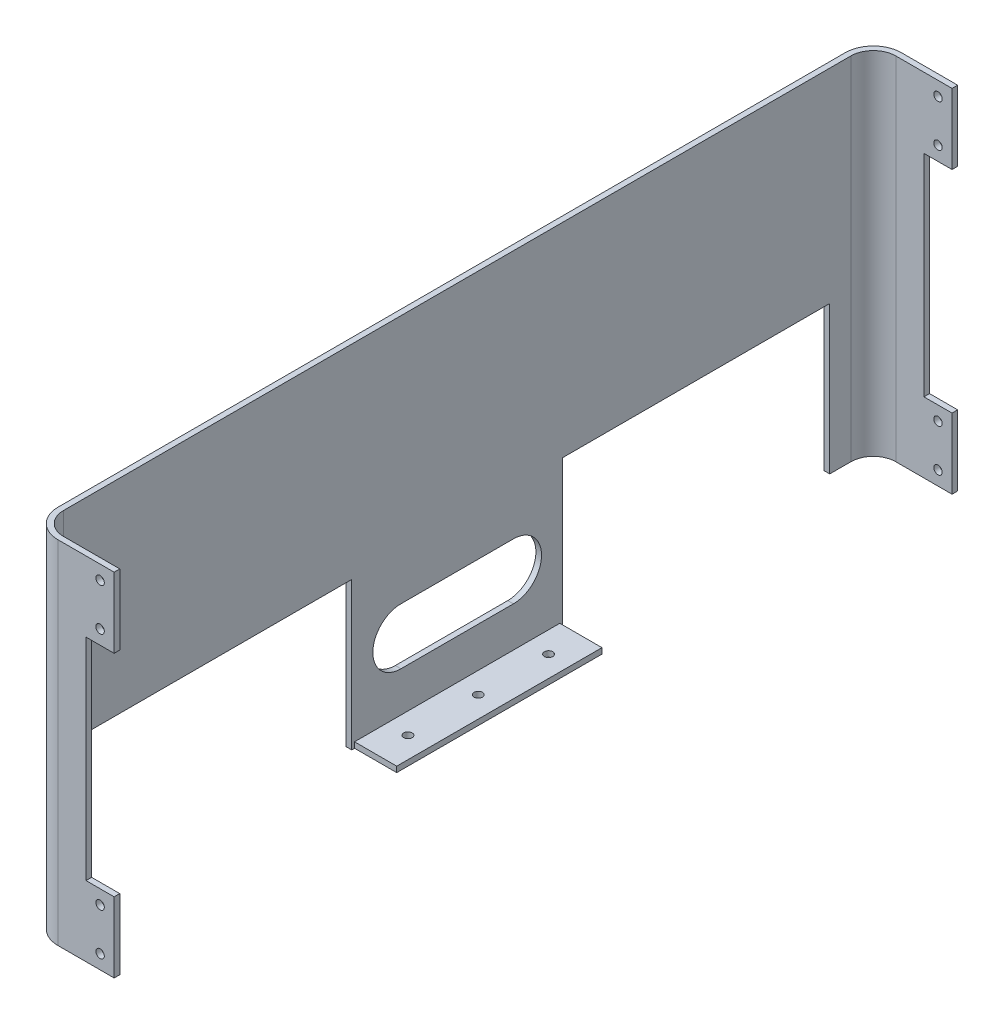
ISO-10303-21;
HEADER;
FILE_DESCRIPTION(('STEP AP214'),'2;1');
FILE_NAME('part.step','',(''),(''),'','','');
FILE_SCHEMA(('AUTOMOTIVE_DESIGN { 1 0 10303 214 1 1 1 1 }'));
ENDSEC;
DATA;
#1=APPLICATION_CONTEXT('core data for automotive mechanical design processes');
#2=APPLICATION_PROTOCOL_DEFINITION('international standard','automotive_design',2000,#1);
#3=PRODUCT_CONTEXT('',#1,'mechanical');
#4=PRODUCT('Part','Part','',(#3));
#5=PRODUCT_RELATED_PRODUCT_CATEGORY('part','',(#4));
#6=PRODUCT_DEFINITION_FORMATION('','',#4);
#7=PRODUCT_DEFINITION_CONTEXT('part definition',#1,'design');
#8=PRODUCT_DEFINITION('design','',#6,#7);
#9=PRODUCT_DEFINITION_SHAPE('','',#8);
#10=(LENGTH_UNIT() NAMED_UNIT(*) SI_UNIT(.MILLI.,.METRE.));
#11=(NAMED_UNIT(*) PLANE_ANGLE_UNIT() SI_UNIT($,.RADIAN.));
#12=(NAMED_UNIT(*) SI_UNIT($,.STERADIAN.) SOLID_ANGLE_UNIT());
#13=UNCERTAINTY_MEASURE_WITH_UNIT(LENGTH_MEASURE(1.E-05),#10,'distance_accuracy_value','');
#14=(GEOMETRIC_REPRESENTATION_CONTEXT(3) GLOBAL_UNCERTAINTY_ASSIGNED_CONTEXT((#13)) GLOBAL_UNIT_ASSIGNED_CONTEXT((#10,
#11,#12)) REPRESENTATION_CONTEXT('',''));
#15=CARTESIAN_POINT('',(0.,0.,0.));
#16=DIRECTION('',(0.,0.,1.));
#17=DIRECTION('',(1.,0.,0.));
#18=AXIS2_PLACEMENT_3D('',#15,#16,#17);
#19=CARTESIAN_POINT('',(-56.,250.,20.));
#20=DIRECTION('',(-1.,0.,0.));
#21=DIRECTION('',(0.,0.,1.));
#22=AXIS2_PLACEMENT_3D('',#19,#20,#21);
#23=PLANE('',#22);
#24=DIRECTION('',(0.,0.,1.));
#25=VECTOR('',#24,1.);
#26=CARTESIAN_POINT('',(-56.,72.5,260.));
#27=LINE('',#26,#25);
#28=CARTESIAN_POINT('',(-56.,72.5,260.));
#29=VERTEX_POINT('',#28);
#30=CARTESIAN_POINT('',(-56.,72.5000000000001,340.));
#31=VERTEX_POINT('',#30);
#32=EDGE_CURVE('E693',#29,#31,#27,.T.);
#33=ORIENTED_EDGE('',*,*,#32,.F.);
#34=CARTESIAN_POINT('',(-56.,52.5,260.));
#35=DIRECTION('',(-1.,0.,0.));
#36=DIRECTION('',(0.,0.,1.));
#37=AXIS2_PLACEMENT_3D('',#34,#35,#36);
#38=CIRCLE('',#37,20.);
#39=CARTESIAN_POINT('',(-56.,32.5,260.));
#40=VERTEX_POINT('',#39);
#41=EDGE_CURVE('E676',#40,#29,#38,.F.);
#42=ORIENTED_EDGE('',*,*,#41,.F.);
#43=DIRECTION('',(0.,0.,-1.));
#44=VECTOR('',#43,1.);
#45=CARTESIAN_POINT('',(-56.,32.5,260.));
#46=LINE('',#45,#44);
#47=CARTESIAN_POINT('',(-56.,32.5,340.));
#48=VERTEX_POINT('',#47);
#49=EDGE_CURVE('E685',#48,#40,#46,.T.);
#50=ORIENTED_EDGE('',*,*,#49,.F.);
#51=CARTESIAN_POINT('',(-56.,52.5,340.));
#52=DIRECTION('',(-1.,0.,0.));
#53=DIRECTION('',(0.,0.,1.));
#54=AXIS2_PLACEMENT_3D('',#51,#52,#53);
#55=CIRCLE('',#54,20.);
#56=EDGE_CURVE('E60',#31,#48,#55,.F.);
#57=ORIENTED_EDGE('',*,*,#56,.F.);
#58=EDGE_LOOP('',(#33,#42,#50,#57));
#59=FACE_BOUND('',#58,.T.);
#60=DIRECTION('',(0.,-1.,0.));
#61=VECTOR('',#60,1.);
#62=CARTESIAN_POINT('',(-55.9999999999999,0.,373.));
#63=LINE('',#62,#61);
#64=CARTESIAN_POINT('',(-55.9999999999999,4.00000000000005,373.));
#65=VERTEX_POINT('',#64);
#66=CARTESIAN_POINT('',(-56.,0.,373.));
#67=VERTEX_POINT('',#66);
#68=EDGE_CURVE('E725',#65,#67,#63,.T.);
#69=ORIENTED_EDGE('',*,*,#68,.F.);
#70=DIRECTION('',(0.,0.,1.));
#71=VECTOR('',#70,1.);
#72=CARTESIAN_POINT('',(-55.9999999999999,4.00000000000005,373.));
#73=LINE('',#72,#71);
#74=CARTESIAN_POINT('',(-56.,4.00000000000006,227.));
#75=VERTEX_POINT('',#74);
#76=EDGE_CURVE('E732',#75,#65,#73,.T.);
#77=ORIENTED_EDGE('',*,*,#76,.F.);
#78=DIRECTION('',(0.,1.,0.));
#79=VECTOR('',#78,1.);
#80=CARTESIAN_POINT('',(-56.,0.,227.));
#81=LINE('',#80,#79);
#82=CARTESIAN_POINT('',(-56.,0.,227.));
#83=VERTEX_POINT('',#82);
#84=EDGE_CURVE('E741',#83,#75,#81,.T.);
#85=ORIENTED_EDGE('',*,*,#84,.F.);
#86=DIRECTION('',(0.,0.,-1.));
#87=VECTOR('',#86,1.);
#88=CARTESIAN_POINT('',(-56.,0.,20.));
#89=LINE('',#88,#87);
#90=CARTESIAN_POINT('',(-56.,0.,225.));
#91=VERTEX_POINT('',#90);
#92=EDGE_CURVE('E1513',#83,#91,#89,.T.);
#93=ORIENTED_EDGE('',*,*,#92,.T.);
#94=DIRECTION('',(0.,-1.,0.));
#95=VECTOR('',#94,1.);
#96=CARTESIAN_POINT('',(-56.,105.,225.));
#97=LINE('',#96,#95);
#98=CARTESIAN_POINT('',(-56.,105.,225.));
#99=VERTEX_POINT('',#98);
#100=EDGE_CURVE('E769',#99,#91,#97,.T.);
#101=ORIENTED_EDGE('',*,*,#100,.F.);
#102=DIRECTION('',(0.,0.,1.));
#103=VECTOR('',#102,1.);
#104=CARTESIAN_POINT('',(-56.,105.,35.));
#105=LINE('',#104,#103);
#106=CARTESIAN_POINT('',(-56.,105.,35.));
#107=VERTEX_POINT('',#106);
#108=EDGE_CURVE('E762',#107,#99,#105,.T.);
#109=ORIENTED_EDGE('',*,*,#108,.F.);
#110=DIRECTION('',(0.,1.,0.));
#111=VECTOR('',#110,1.);
#112=CARTESIAN_POINT('',(-56.,0.,35.));
#113=LINE('',#112,#111);
#114=CARTESIAN_POINT('',(-56.,0.,35.));
#115=VERTEX_POINT('',#114);
#116=EDGE_CURVE('E772',#115,#107,#113,.T.);
#117=ORIENTED_EDGE('',*,*,#116,.F.);
#118=CARTESIAN_POINT('',(-56.,0.,20.));
#119=VERTEX_POINT('',#118);
#120=EDGE_CURVE('E1507',#115,#119,#89,.T.);
#121=ORIENTED_EDGE('',*,*,#120,.T.);
#122=DIRECTION('',(0.,-1.,0.));
#123=VECTOR('',#122,1.);
#124=CARTESIAN_POINT('',(-56.,250.,20.));
#125=LINE('',#124,#123);
#126=CARTESIAN_POINT('',(-56.,250.,20.));
#127=VERTEX_POINT('',#126);
#128=EDGE_CURVE('E1523',#127,#119,#125,.T.);
#129=ORIENTED_EDGE('',*,*,#128,.F.);
#130=DIRECTION('',(0.,0.,-1.));
#131=VECTOR('',#130,1.);
#132=CARTESIAN_POINT('',(-56.,250.,20.));
#133=LINE('',#132,#131);
#134=CARTESIAN_POINT('',(-55.9999999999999,250.,580.));
#135=VERTEX_POINT('',#134);
#136=EDGE_CURVE('E1477',#135,#127,#133,.T.);
#137=ORIENTED_EDGE('',*,*,#136,.F.);
#138=DIRECTION('',(0.,-1.,0.));
#139=VECTOR('',#138,1.);
#140=CARTESIAN_POINT('',(-55.9999999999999,250.,580.));
#141=LINE('',#140,#139);
#142=CARTESIAN_POINT('',(-55.9999999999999,0.,580.));
#143=VERTEX_POINT('',#142);
#144=EDGE_CURVE('E1526',#135,#143,#141,.T.);
#145=ORIENTED_EDGE('',*,*,#144,.T.);
#146=CARTESIAN_POINT('',(-55.9999999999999,0.,565.));
#147=VERTEX_POINT('',#146);
#148=EDGE_CURVE('E1508',#143,#147,#89,.T.);
#149=ORIENTED_EDGE('',*,*,#148,.T.);
#150=DIRECTION('',(0.,-1.,0.));
#151=VECTOR('',#150,1.);
#152=CARTESIAN_POINT('',(-56.,0.,565.));
#153=LINE('',#152,#151);
#154=CARTESIAN_POINT('',(-56.,105.,565.));
#155=VERTEX_POINT('',#154);
#156=EDGE_CURVE('E799',#155,#147,#153,.T.);
#157=ORIENTED_EDGE('',*,*,#156,.F.);
#158=DIRECTION('',(0.,0.,1.));
#159=VECTOR('',#158,1.);
#160=CARTESIAN_POINT('',(-56.,105.,565.));
#161=LINE('',#160,#159);
#162=CARTESIAN_POINT('',(-56.,105.,375.));
#163=VERTEX_POINT('',#162);
#164=EDGE_CURVE('E773',#163,#155,#161,.T.);
#165=ORIENTED_EDGE('',*,*,#164,.F.);
#166=DIRECTION('',(0.,1.,0.));
#167=VECTOR('',#166,1.);
#168=CARTESIAN_POINT('',(-56.,105.,375.));
#169=LINE('',#168,#167);
#170=CARTESIAN_POINT('',(-56.,0.,375.));
#171=VERTEX_POINT('',#170);
#172=EDGE_CURVE('E796',#171,#163,#169,.T.);
#173=ORIENTED_EDGE('',*,*,#172,.F.);
#174=EDGE_CURVE('E1512',#171,#67,#89,.T.);
#175=ORIENTED_EDGE('',*,*,#174,.T.);
#176=EDGE_LOOP('',(#69,#77,#85,#93,#101,#109,#117,#121,#129,#137,#145,#149,#157,#165,#173,#175));
#177=FACE_BOUND('',#176,.T.);
#178=ADVANCED_FACE('F45',(#59,#177),#23,.F.);
#179=CARTESIAN_POINT('',(-40.,0.,20.));
#180=DIRECTION('',(0.,1.,0.));
#181=DIRECTION('',(0.,0.,1.));
#182=AXIS2_PLACEMENT_3D('',#179,#180,#181);
#183=PLANE('',#182);
#184=CARTESIAN_POINT('',(-41.,0.,250.));
#185=DIRECTION('',(0.,1.,0.));
#186=DIRECTION('',(0.,0.,1.));
#187=AXIS2_PLACEMENT_3D('',#184,#185,#186);
#188=CIRCLE('',#187,3.);
#189=CARTESIAN_POINT('',(-41.,0.,253.));
#190=VERTEX_POINT('',#189);
#191=EDGE_CURVE('E688',#190,#190,#188,.T.);
#192=ORIENTED_EDGE('',*,*,#191,.T.);
#193=EDGE_LOOP('',(#192));
#194=FACE_BOUND('',#193,.T.);
#195=CARTESIAN_POINT('',(-41.,0.,350.));
#196=DIRECTION('',(0.,1.,0.));
#197=DIRECTION('',(0.,0.,1.));
#198=AXIS2_PLACEMENT_3D('',#195,#196,#197);
#199=CIRCLE('',#198,3.);
#200=CARTESIAN_POINT('',(-41.,0.,353.));
#201=VERTEX_POINT('',#200);
#202=EDGE_CURVE('E714',#201,#201,#199,.T.);
#203=ORIENTED_EDGE('',*,*,#202,.T.);
#204=EDGE_LOOP('',(#203));
#205=FACE_BOUND('',#204,.T.);
#206=CARTESIAN_POINT('',(-41.,0.,300.));
#207=DIRECTION('',(0.,1.,0.));
#208=DIRECTION('',(0.,0.,1.));
#209=AXIS2_PLACEMENT_3D('',#206,#207,#208);
#210=CIRCLE('',#209,3.);
#211=CARTESIAN_POINT('',(-41.,0.,303.));
#212=VERTEX_POINT('',#211);
#213=EDGE_CURVE('E722',#212,#212,#210,.T.);
#214=ORIENTED_EDGE('',*,*,#213,.T.);
#215=EDGE_LOOP('',(#214));
#216=FACE_BOUND('',#215,.T.);
#217=DIRECTION('',(0.,0.,1.));
#218=VECTOR('',#217,1.);
#219=CARTESIAN_POINT('',(-60.,0.,20.));
#220=LINE('',#219,#218);
#221=CARTESIAN_POINT('',(-60.,0.,225.));
#222=VERTEX_POINT('',#221);
#223=CARTESIAN_POINT('',(-60.,0.,375.));
#224=VERTEX_POINT('',#223);
#225=EDGE_CURVE('E1495',#222,#224,#220,.T.);
#226=ORIENTED_EDGE('',*,*,#225,.F.);
#227=DIRECTION('',(1.,0.,0.));
#228=VECTOR('',#227,1.);
#229=CARTESIAN_POINT('',(-60.,0.,225.));
#230=LINE('',#229,#228);
#231=EDGE_CURVE('E768',#222,#91,#230,.T.);
#232=ORIENTED_EDGE('',*,*,#231,.T.);
#233=ORIENTED_EDGE('',*,*,#92,.F.);
#234=DIRECTION('',(-1.,0.,0.));
#235=VECTOR('',#234,1.);
#236=CARTESIAN_POINT('',(-26.,0.,227.));
#237=LINE('',#236,#235);
#238=CARTESIAN_POINT('',(-26.,0.,227.));
#239=VERTEX_POINT('',#238);
#240=EDGE_CURVE('E751',#239,#83,#237,.T.);
#241=ORIENTED_EDGE('',*,*,#240,.F.);
#242=DIRECTION('',(0.,0.,-1.));
#243=VECTOR('',#242,1.);
#244=CARTESIAN_POINT('',(-25.9999999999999,0.,373.));
#245=LINE('',#244,#243);
#246=CARTESIAN_POINT('',(-25.9999999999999,0.,373.));
#247=VERTEX_POINT('',#246);
#248=EDGE_CURVE('E731',#247,#239,#245,.T.);
#249=ORIENTED_EDGE('',*,*,#248,.F.);
#250=DIRECTION('',(-1.,0.,0.));
#251=VECTOR('',#250,1.);
#252=CARTESIAN_POINT('',(-25.9999999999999,0.,373.));
#253=LINE('',#252,#251);
#254=EDGE_CURVE('E754',#247,#67,#253,.T.);
#255=ORIENTED_EDGE('',*,*,#254,.T.);
#256=ORIENTED_EDGE('',*,*,#174,.F.);
#257=DIRECTION('',(1.,0.,0.));
#258=VECTOR('',#257,1.);
#259=CARTESIAN_POINT('',(-60.,0.,375.));
#260=LINE('',#259,#258);
#261=EDGE_CURVE('E793',#224,#171,#260,.T.);
#262=ORIENTED_EDGE('',*,*,#261,.F.);
#263=EDGE_LOOP('',(#226,#232,#233,#241,#249,#255,#256,#262));
#264=FACE_BOUND('',#263,.T.);
#265=ADVANCED_FACE('F1591',(#194,#205,#216,#264),#183,.F.);
#266=ORIENTED_EDGE('',*,*,#120,.F.);
#267=DIRECTION('',(1.,0.,0.));
#268=VECTOR('',#267,1.);
#269=CARTESIAN_POINT('',(-60.,0.,35.));
#270=LINE('',#269,#268);
#271=CARTESIAN_POINT('',(-60.,0.,35.));
#272=VERTEX_POINT('',#271);
#273=EDGE_CURVE('E783',#272,#115,#270,.T.);
#274=ORIENTED_EDGE('',*,*,#273,.F.);
#275=CARTESIAN_POINT('',(-60.,0.,20.));
#276=VERTEX_POINT('',#275);
#277=EDGE_CURVE('E1491',#276,#272,#220,.T.);
#278=ORIENTED_EDGE('',*,*,#277,.F.);
#279=CARTESIAN_POINT('',(-40.,0.,20.));
#280=DIRECTION('',(0.,1.,0.));
#281=DIRECTION('',(0.,0.,1.));
#282=AXIS2_PLACEMENT_3D('',#279,#280,#281);
#283=CIRCLE('',#282,20.);
#284=CARTESIAN_POINT('',(-40.,0.,0.));
#285=VERTEX_POINT('',#284);
#286=EDGE_CURVE('E1488',#285,#276,#283,.T.);
#287=ORIENTED_EDGE('',*,*,#286,.F.);
#288=DIRECTION('',(-1.,0.,0.));
#289=VECTOR('',#288,1.);
#290=CARTESIAN_POINT('',(0.,0.,0.));
#291=LINE('',#290,#289);
#292=CARTESIAN_POINT('',(0.,0.,0.));
#293=VERTEX_POINT('',#292);
#294=EDGE_CURVE('E1486',#293,#285,#291,.T.);
#295=ORIENTED_EDGE('',*,*,#294,.F.);
#296=DIRECTION('',(0.,0.,-1.));
#297=VECTOR('',#296,1.);
#298=CARTESIAN_POINT('',(0.,0.,0.));
#299=LINE('',#298,#297);
#300=CARTESIAN_POINT('',(0.,0.,4.));
#301=VERTEX_POINT('',#300);
#302=EDGE_CURVE('E1456',#301,#293,#299,.T.);
#303=ORIENTED_EDGE('',*,*,#302,.F.);
#304=DIRECTION('',(1.,0.,0.));
#305=VECTOR('',#304,1.);
#306=CARTESIAN_POINT('',(0.,0.,4.));
#307=LINE('',#306,#305);
#308=CARTESIAN_POINT('',(-40.,0.,4.));
#309=VERTEX_POINT('',#308);
#310=EDGE_CURVE('E1461',#309,#301,#307,.T.);
#311=ORIENTED_EDGE('',*,*,#310,.F.);
#312=CARTESIAN_POINT('',(-40.,0.,20.));
#313=DIRECTION('',(0.,-1.,0.));
#314=DIRECTION('',(0.,0.,1.));
#315=AXIS2_PLACEMENT_3D('',#312,#313,#314);
#316=CIRCLE('',#315,16.);
#317=EDGE_CURVE('E1511',#119,#309,#316,.T.);
#318=ORIENTED_EDGE('',*,*,#317,.F.);
#319=EDGE_LOOP('',(#266,#274,#278,#287,#295,#303,#311,#318));
#320=FACE_BOUND('',#319,.T.);
#321=ADVANCED_FACE('F1565',(#320),#183,.F.);
#322=CARTESIAN_POINT('',(-60.,250.,20.));
#323=DIRECTION('',(1.,0.,0.));
#324=DIRECTION('',(0.,0.,-1.));
#325=AXIS2_PLACEMENT_3D('',#322,#323,#324);
#326=PLANE('',#325);
#327=DIRECTION('',(0.,0.,1.));
#328=VECTOR('',#327,1.);
#329=CARTESIAN_POINT('',(-60.,32.5,260.));
#330=LINE('',#329,#328);
#331=CARTESIAN_POINT('',(-60.,32.5,260.));
#332=VERTEX_POINT('',#331);
#333=CARTESIAN_POINT('',(-60.,32.5,340.));
#334=VERTEX_POINT('',#333);
#335=EDGE_CURVE('E695',#332,#334,#330,.T.);
#336=ORIENTED_EDGE('',*,*,#335,.F.);
#337=CARTESIAN_POINT('',(-60.,52.5,260.));
#338=DIRECTION('',(-1.,0.,0.));
#339=DIRECTION('',(0.,0.,1.));
#340=AXIS2_PLACEMENT_3D('',#337,#338,#339);
#341=CIRCLE('',#340,20.);
#342=CARTESIAN_POINT('',(-60.,72.5,260.));
#343=VERTEX_POINT('',#342);
#344=EDGE_CURVE('E68',#343,#332,#341,.T.);
#345=ORIENTED_EDGE('',*,*,#344,.F.);
#346=DIRECTION('',(0.,0.,-1.));
#347=VECTOR('',#346,1.);
#348=CARTESIAN_POINT('',(-60.,72.5,260.));
#349=LINE('',#348,#347);
#350=CARTESIAN_POINT('',(-60.,72.5000000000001,340.));
#351=VERTEX_POINT('',#350);
#352=EDGE_CURVE('E682',#351,#343,#349,.T.);
#353=ORIENTED_EDGE('',*,*,#352,.F.);
#354=CARTESIAN_POINT('',(-60.,52.5,340.));
#355=DIRECTION('',(-1.,0.,0.));
#356=DIRECTION('',(0.,0.,1.));
#357=AXIS2_PLACEMENT_3D('',#354,#355,#356);
#358=CIRCLE('',#357,20.);
#359=EDGE_CURVE('E701',#334,#351,#358,.T.);
#360=ORIENTED_EDGE('',*,*,#359,.F.);
#361=EDGE_LOOP('',(#336,#345,#353,#360));
#362=FACE_BOUND('',#361,.T.);
#363=DIRECTION('',(0.,0.,1.));
#364=VECTOR('',#363,1.);
#365=CARTESIAN_POINT('',(-60.,235.,197.307692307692));
#366=LINE('',#365,#364);
#367=CARTESIAN_POINT('',(-60.,235.,197.307692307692));
#368=VERTEX_POINT('',#367);
#369=CARTESIAN_POINT('',(-60.,235.,198.076923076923));
#370=VERTEX_POINT('',#369);
#371=EDGE_CURVE('E954',#368,#370,#366,.T.);
#372=ORIENTED_EDGE('',*,*,#371,.T.);
#373=DIRECTION('',(0.,-0.907959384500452,0.419058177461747));
#374=VECTOR('',#373,1.);
#375=CARTESIAN_POINT('',(-60.,235.,198.076923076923));
#376=LINE('',#375,#374);
#377=CARTESIAN_POINT('',(-60.,175.,225.769230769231));
#378=VERTEX_POINT('',#377);
#379=EDGE_CURVE('E980',#370,#378,#376,.T.);
#380=ORIENTED_EDGE('',*,*,#379,.T.);
#381=DIRECTION('',(0.,0.,-1.));
#382=VECTOR('',#381,1.);
#383=CARTESIAN_POINT('',(-60.,175.,225.769230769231));
#384=LINE('',#383,#382);
#385=CARTESIAN_POINT('',(-60.,175.,219.915865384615));
#386=VERTEX_POINT('',#385);
#387=EDGE_CURVE('E983',#378,#386,#384,.T.);
#388=ORIENTED_EDGE('',*,*,#387,.T.);
#389=DIRECTION('',(0.,0.90805902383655,-0.418842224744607));
#390=VECTOR('',#389,1.);
#391=CARTESIAN_POINT('',(-60.,175.,219.915865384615));
#392=LINE('',#391,#390);
#393=CARTESIAN_POINT('',(-60.,194.230769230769,211.045673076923));
#394=VERTEX_POINT('',#393);
#395=EDGE_CURVE('E986',#386,#394,#392,.T.);
#396=ORIENTED_EDGE('',*,*,#395,.T.);
#397=DIRECTION('',(0.,0.,-1.));
#398=VECTOR('',#397,1.);
#399=CARTESIAN_POINT('',(-60.,194.230769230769,211.045673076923));
#400=LINE('',#399,#398);
#401=CARTESIAN_POINT('',(-60.,194.230769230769,183.846153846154));
#402=VERTEX_POINT('',#401);
#403=EDGE_CURVE('E989',#394,#402,#400,.T.);
#404=ORIENTED_EDGE('',*,*,#403,.T.);
#405=DIRECTION('',(0.,-0.903496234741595,-0.428596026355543));
#406=VECTOR('',#405,1.);
#407=CARTESIAN_POINT('',(-60.,194.230769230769,183.846153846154));
#408=LINE('',#407,#406);
#409=CARTESIAN_POINT('',(-60.,175.,174.723557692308));
#410=VERTEX_POINT('',#409);
#411=EDGE_CURVE('E992',#402,#410,#408,.T.);
#412=ORIENTED_EDGE('',*,*,#411,.T.);
#413=DIRECTION('',(0.,0.,-1.));
#414=VECTOR('',#413,1.);
#415=CARTESIAN_POINT('',(-60.,175.,174.723557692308));
#416=LINE('',#415,#414);
#417=CARTESIAN_POINT('',(-60.,175.,168.846153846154));
#418=VERTEX_POINT('',#417);
#419=EDGE_CURVE('E995',#410,#418,#416,.T.);
#420=ORIENTED_EDGE('',*,*,#419,.T.);
#421=DIRECTION('',(0.,0.903501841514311,0.428584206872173));
#422=VECTOR('',#421,1.);
#423=CARTESIAN_POINT('',(-60.,175.,168.846153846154));
#424=LINE('',#423,#422);
#425=EDGE_CURVE('E963',#418,#368,#424,.T.);
#426=ORIENTED_EDGE('',*,*,#425,.T.);
#427=EDGE_LOOP('',(#372,#380,#388,#396,#404,#412,#420,#426));
#428=FACE_BOUND('',#427,.T.);
#429=DIRECTION('',(0.,1.,0.));
#430=VECTOR('',#429,1.);
#431=CARTESIAN_POINT('',(-60.,175.,312.692307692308));
#432=LINE('',#431,#430);
#433=CARTESIAN_POINT('',(-60.,175.,312.692307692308));
#434=VERTEX_POINT('',#433);
#435=CARTESIAN_POINT('',(-60.,235.,312.692307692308));
#436=VERTEX_POINT('',#435);
#437=EDGE_CURVE('E1184',#434,#436,#432,.T.);
#438=ORIENTED_EDGE('',*,*,#437,.T.);
#439=DIRECTION('',(0.,0.,1.));
#440=VECTOR('',#439,1.);
#441=CARTESIAN_POINT('',(-60.,235.,312.692307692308));
#442=LINE('',#441,#440);
#443=CARTESIAN_POINT('',(-60.,235.,324.699519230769));
#444=VERTEX_POINT('',#443);
#445=EDGE_CURVE('E1178',#436,#444,#442,.T.);
#446=ORIENTED_EDGE('',*,*,#445,.T.);
#447=CARTESIAN_POINT('',(-60.,235.,324.699519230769));
#448=CARTESIAN_POINT('',(-60.,234.997332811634,325.500795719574));
#449=CARTESIAN_POINT('',(-60.,234.992211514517,327.039335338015));
#450=CARTESIAN_POINT('',(-60.,234.963655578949,329.24344854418));
#451=CARTESIAN_POINT('',(-60.,234.881809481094,331.246198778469));
#452=CARTESIAN_POINT('',(-60.,234.811376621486,333.046538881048));
#453=CARTESIAN_POINT('',(-60.,234.682943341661,334.644435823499));
#454=CARTESIAN_POINT('',(-60.,234.560189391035,336.044789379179));
#455=CARTESIAN_POINT('',(-60.,234.399498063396,337.241149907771));
#456=CARTESIAN_POINT('',(-60.,234.250262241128,337.965364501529));
#457=CARTESIAN_POINT('',(-60.,234.182692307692,338.293269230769));
#458=B_SPLINE_CURVE_WITH_KNOTS('',3,(#447,#448,#449,#450,#451,#452,#453,#454,#455,#456,#457),
.UNSPECIFIED.,.F.,.F.,(4,1,1,1,1,1,1,1,4),(0.,0.176257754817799,0.338434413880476,
0.484822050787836,0.617157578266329,0.734698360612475,0.83738518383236,0.926372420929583,1.),.UNSPECIFIED.);
#459=CARTESIAN_POINT('',(-60.,234.182692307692,338.293269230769));
#460=VERTEX_POINT('',#459);
#461=EDGE_CURVE('E1170',#444,#460,#458,.T.);
#462=ORIENTED_EDGE('',*,*,#461,.T.);
#463=CARTESIAN_POINT('',(-60.,234.182692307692,338.293269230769));
#464=CARTESIAN_POINT('',(-60.,234.074233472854,338.732239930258));
#465=CARTESIAN_POINT('',(-60.,233.859629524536,339.600816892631));
#466=CARTESIAN_POINT('',(-60.,233.406036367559,340.851389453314));
#467=CARTESIAN_POINT('',(-60.,232.88112851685,342.043063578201));
#468=CARTESIAN_POINT('',(-60.,232.264607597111,343.170889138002));
#469=CARTESIAN_POINT('',(-60.,231.551897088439,344.229216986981));
#470=CARTESIAN_POINT('',(-60.,230.755300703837,345.228959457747));
#471=CARTESIAN_POINT('',(-60.,229.879177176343,346.174653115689));
#472=CARTESIAN_POINT('',(-60.,228.901437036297,347.028052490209));
#473=CARTESIAN_POINT('',(-60.,227.875668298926,347.83272194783));
#474=CARTESIAN_POINT('',(-60.,226.766461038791,348.511384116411));
#475=CARTESIAN_POINT('',(-60.,225.60654913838,349.096409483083));
#476=CARTESIAN_POINT('',(-60.,224.384136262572,349.562189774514));
#477=CARTESIAN_POINT('',(-60.,223.111077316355,349.937240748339));
#478=CARTESIAN_POINT('',(-60.,221.775840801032,350.201690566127));
#479=CARTESIAN_POINT('',(-60.,220.384509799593,350.360282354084));
#480=CARTESIAN_POINT('',(-60.,219.435517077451,350.376428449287));
#481=CARTESIAN_POINT('',(-60.,218.954326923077,350.384615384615));
#482=B_SPLINE_CURVE_WITH_KNOTS('',3,(#463,#464,#465,#466,#467,#468,#469,#470,#471,#472,#473,
#474,#475,#476,#477,#478,#479,#480,#481),.UNSPECIFIED.,.F.,.F.,(4,1,1,1,1,1,1,1,1,1,1,1,1,1,1,1,
4),(0.,0.0642168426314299,0.127063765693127,0.188744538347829,0.249132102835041,
0.309452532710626,0.369826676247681,0.430650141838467,0.492351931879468,0.554072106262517,
0.615689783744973,0.676797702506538,0.73843904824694,0.801316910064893,0.865184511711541,
0.931641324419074,1.),.UNSPECIFIED.);
#483=CARTESIAN_POINT('',(-60.,218.954326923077,350.384615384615));
#484=VERTEX_POINT('',#483);
#485=EDGE_CURVE('E1162',#460,#484,#482,.T.);
#486=ORIENTED_EDGE('',*,*,#485,.T.);
#487=CARTESIAN_POINT('',(-60.,218.954326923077,350.384615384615));
#488=CARTESIAN_POINT('',(-60.,218.154867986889,350.359432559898));
#489=CARTESIAN_POINT('',(-60.,216.59491653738,350.310294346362));
#490=CARTESIAN_POINT('',(-60.,214.331015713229,349.852149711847));
#491=CARTESIAN_POINT('',(-60.,212.219198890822,349.101695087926));
#492=CARTESIAN_POINT('',(-60.,210.262125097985,348.067581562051));
#493=CARTESIAN_POINT('',(-60.,208.497942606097,346.750676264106));
#494=CARTESIAN_POINT('',(-60.,206.948391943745,345.167965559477));
#495=CARTESIAN_POINT('',(-60.,205.651707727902,343.318566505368));
#496=CARTESIAN_POINT('',(-60.,204.752516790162,341.596921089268));
#497=CARTESIAN_POINT('',(-60.,204.176638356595,340.076106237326));
#498=CARTESIAN_POINT('',(-60.,203.771443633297,338.824106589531));
#499=CARTESIAN_POINT('',(-60.,203.458381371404,337.458386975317));
#500=CARTESIAN_POINT('',(-60.,203.177921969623,335.992032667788));
#501=CARTESIAN_POINT('',(-60.,202.966178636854,334.41894143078));
#502=CARTESIAN_POINT('',(-60.,202.811094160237,332.74288361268));
#503=CARTESIAN_POINT('',(-60.,202.714167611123,330.962663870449));
#504=CARTESIAN_POINT('',(-60.,202.699733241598,329.739708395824));
#505=CARTESIAN_POINT('',(-60.,202.692307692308,329.110576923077));
#506=B_SPLINE_CURVE_WITH_KNOTS('',3,(#487,#488,#489,#490,#491,#492,#493,#494,#495,#496,#497,
#498,#499,#500,#501,#502,#503,#504,#505),.UNSPECIFIED.,.F.,.F.,(4,1,1,1,1,1,1,1,1,1,1,1,1,1,1,1,
4),(0.,0.0787802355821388,0.153720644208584,0.226713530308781,0.299191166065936,
0.371189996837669,0.443006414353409,0.516689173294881,0.593217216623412,0.633872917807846,
0.676989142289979,0.722899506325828,0.771958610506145,0.824211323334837,0.879378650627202,
0.937948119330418,1.),.UNSPECIFIED.);
#507=CARTESIAN_POINT('',(-60.,202.692307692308,329.110576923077));
#508=VERTEX_POINT('',#507);
#509=EDGE_CURVE('E1157',#484,#508,#506,.T.);
#510=ORIENTED_EDGE('',*,*,#509,.T.);
#511=DIRECTION('',(0.,-0.782390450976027,0.622788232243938));
#512=VECTOR('',#511,1.);
#513=CARTESIAN_POINT('',(-60.,202.692307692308,329.110576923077));
#514=LINE('',#513,#512);
#515=CARTESIAN_POINT('',(-60.,175.,351.153846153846));
#516=VERTEX_POINT('',#515);
#517=EDGE_CURVE('E1154',#508,#516,#514,.T.);
#518=ORIENTED_EDGE('',*,*,#517,.T.);
#519=DIRECTION('',(0.,0.,-1.));
#520=VECTOR('',#519,1.);
#521=CARTESIAN_POINT('',(-60.,175.,351.153846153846));
#522=LINE('',#521,#520);
#523=CARTESIAN_POINT('',(-60.,175.,344.495192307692));
#524=VERTEX_POINT('',#523);
#525=EDGE_CURVE('E1151',#516,#524,#522,.T.);
#526=ORIENTED_EDGE('',*,*,#525,.T.);
#527=DIRECTION('',(0.,0.782390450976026,-0.622788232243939));
#528=VECTOR('',#527,1.);
#529=CARTESIAN_POINT('',(-60.,175.,344.495192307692));
#530=LINE('',#529,#528);
#531=CARTESIAN_POINT('',(-60.,202.692307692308,322.451923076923));
#532=VERTEX_POINT('',#531);
#533=EDGE_CURVE('E1148',#524,#532,#530,.T.);
#534=ORIENTED_EDGE('',*,*,#533,.T.);
#535=DIRECTION('',(0.,0.,-1.));
#536=VECTOR('',#535,1.);
#537=CARTESIAN_POINT('',(-60.,202.692307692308,322.451923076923));
#538=LINE('',#537,#536);
#539=CARTESIAN_POINT('',(-60.,202.692307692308,318.076923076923));
#540=VERTEX_POINT('',#539);
#541=EDGE_CURVE('E1145',#532,#540,#538,.T.);
#542=ORIENTED_EDGE('',*,*,#541,.T.);
#543=DIRECTION('',(0.,-1.,0.));
#544=VECTOR('',#543,1.);
#545=CARTESIAN_POINT('',(-60.,202.692307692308,318.076923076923));
#546=LINE('',#545,#544);
#547=CARTESIAN_POINT('',(-60.,175.,318.076923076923));
#548=VERTEX_POINT('',#547);
#549=EDGE_CURVE('E1141',#540,#548,#546,.T.);
#550=ORIENTED_EDGE('',*,*,#549,.T.);
#551=DIRECTION('',(0.,0.,-1.));
#552=VECTOR('',#551,1.);
#553=CARTESIAN_POINT('',(-60.,175.,318.076923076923));
#554=LINE('',#553,#552);
#555=EDGE_CURVE('E1138',#548,#434,#554,.T.);
#556=ORIENTED_EDGE('',*,*,#555,.T.);
#557=EDGE_LOOP('',(#438,#446,#462,#486,#510,#518,#526,#534,#542,#550,#556));
#558=FACE_BOUND('',#557,.T.);
#559=DIRECTION('',(0.,0.842183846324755,-0.539190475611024));
#560=VECTOR('',#559,1.);
#561=CARTESIAN_POINT('',(-60.,205.600961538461,405.745192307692));
#562=LINE('',#561,#560);
#563=CARTESIAN_POINT('',(-59.9999999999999,205.600961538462,405.745192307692));
#564=VERTEX_POINT('',#563);
#565=CARTESIAN_POINT('',(-60.,235.,386.923076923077));
#566=VERTEX_POINT('',#565);
#567=EDGE_CURVE('E1297',#564,#566,#562,.T.);
#568=ORIENTED_EDGE('',*,*,#567,.T.);
#569=DIRECTION('',(0.,0.,1.));
#570=VECTOR('',#569,1.);
#571=CARTESIAN_POINT('',(-60.,235.,386.923076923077));
#572=LINE('',#571,#570);
#573=CARTESIAN_POINT('',(-60.,235.,393.137019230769));
#574=VERTEX_POINT('',#573);
#575=EDGE_CURVE('E1381',#566,#574,#572,.T.);
#576=ORIENTED_EDGE('',*,*,#575,.T.);
#577=DIRECTION('',(0.,-0.842248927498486,0.539088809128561));
#578=VECTOR('',#577,1.);
#579=CARTESIAN_POINT('',(-60.,235.,393.137019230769));
#580=LINE('',#579,#578);
#581=CARTESIAN_POINT('',(-60.,210.456730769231,408.846153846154));
#582=VERTEX_POINT('',#581);
#583=EDGE_CURVE('E1378',#574,#582,#580,.T.);
#584=ORIENTED_EDGE('',*,*,#583,.T.);
#585=DIRECTION('',(0.,0.842248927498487,0.53908880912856));
#586=VECTOR('',#585,1.);
#587=CARTESIAN_POINT('',(-60.,210.456730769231,408.846153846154));
#588=LINE('',#587,#586);
#589=CARTESIAN_POINT('',(-60.,235.,424.555288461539));
#590=VERTEX_POINT('',#589);
#591=EDGE_CURVE('E1375',#582,#590,#588,.T.);
#592=ORIENTED_EDGE('',*,*,#591,.T.);
#593=DIRECTION('',(0.,0.,1.));
#594=VECTOR('',#593,1.);
#595=CARTESIAN_POINT('',(-60.,235.,424.555288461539));
#596=LINE('',#595,#594);
#597=CARTESIAN_POINT('',(-60.,235.,430.769230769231));
#598=VERTEX_POINT('',#597);
#599=EDGE_CURVE('E1372',#590,#598,#596,.T.);
#600=ORIENTED_EDGE('',*,*,#599,.T.);
#601=DIRECTION('',(0.,-0.842340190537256,-0.538946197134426));
#602=VECTOR('',#601,1.);
#603=CARTESIAN_POINT('',(-60.,235.,430.769230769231));
#604=LINE('',#603,#602);
#605=CARTESIAN_POINT('',(-60.,205.600961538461,411.959134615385));
#606=VERTEX_POINT('',#605);
#607=EDGE_CURVE('E1369',#598,#606,#604,.T.);
#608=ORIENTED_EDGE('',*,*,#607,.T.);
#609=DIRECTION('',(0.,-0.842337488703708,0.538950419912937));
#610=VECTOR('',#609,1.);
#611=CARTESIAN_POINT('',(-60.,205.600961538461,411.959134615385));
#612=LINE('',#611,#610);
#613=CARTESIAN_POINT('',(-60.,175.,431.538461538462));
#614=VERTEX_POINT('',#613);
#615=EDGE_CURVE('E1366',#606,#614,#612,.T.);
#616=ORIENTED_EDGE('',*,*,#615,.T.);
#617=DIRECTION('',(0.,0.,-1.));
#618=VECTOR('',#617,1.);
#619=CARTESIAN_POINT('',(-60.,175.,431.538461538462));
#620=LINE('',#619,#618);
#621=CARTESIAN_POINT('',(-60.,175.,425.324519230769));
#622=VERTEX_POINT('',#621);
#623=EDGE_CURVE('E1363',#614,#622,#620,.T.);
#624=ORIENTED_EDGE('',*,*,#623,.T.);
#625=DIRECTION('',(0.,0.842249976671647,-0.539087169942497));
#626=VECTOR('',#625,1.);
#627=CARTESIAN_POINT('',(-60.,175.,425.324519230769));
#628=LINE('',#627,#626);
#629=CARTESIAN_POINT('',(-60.,200.745192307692,408.846153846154));
#630=VERTEX_POINT('',#629);
#631=EDGE_CURVE('E1360',#622,#630,#628,.T.);
#632=ORIENTED_EDGE('',*,*,#631,.T.);
#633=DIRECTION('',(0.,-0.842249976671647,-0.539087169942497));
#634=VECTOR('',#633,1.);
#635=CARTESIAN_POINT('',(-60.,200.745192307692,408.846153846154));
#636=LINE('',#635,#634);
#637=CARTESIAN_POINT('',(-60.,175.,392.367788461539));
#638=VERTEX_POINT('',#637);
#639=EDGE_CURVE('E1357',#630,#638,#636,.T.);
#640=ORIENTED_EDGE('',*,*,#639,.T.);
#641=DIRECTION('',(0.,0.,-1.));
#642=VECTOR('',#641,1.);
#643=CARTESIAN_POINT('',(-60.,175.,392.367788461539));
#644=LINE('',#643,#642);
#645=CARTESIAN_POINT('',(-60.,175.,386.153846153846));
#646=VERTEX_POINT('',#645);
#647=EDGE_CURVE('E1353',#638,#646,#644,.T.);
#648=ORIENTED_EDGE('',*,*,#647,.T.);
#649=DIRECTION('',(0.,0.842187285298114,0.539185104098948));
#650=VECTOR('',#649,1.);
#651=CARTESIAN_POINT('',(-60.,175.,386.153846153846));
#652=LINE('',#651,#650);
#653=EDGE_CURVE('E1350',#646,#564,#652,.T.);
#654=ORIENTED_EDGE('',*,*,#653,.T.);
#655=EDGE_LOOP('',(#568,#576,#584,#592,#600,#608,#616,#624,#632,#640,#648,#654));
#656=FACE_BOUND('',#655,.T.);
#657=DIRECTION('',(0.,0.,1.));
#658=VECTOR('',#657,1.);
#659=CARTESIAN_POINT('',(-60.,105.,35.));
#660=LINE('',#659,#658);
#661=CARTESIAN_POINT('',(-60.,105.,35.));
#662=VERTEX_POINT('',#661);
#663=CARTESIAN_POINT('',(-60.,105.,225.));
#664=VERTEX_POINT('',#663);
#665=EDGE_CURVE('E765',#662,#664,#660,.T.);
#666=ORIENTED_EDGE('',*,*,#665,.T.);
#667=DIRECTION('',(0.,-1.,0.));
#668=VECTOR('',#667,1.);
#669=CARTESIAN_POINT('',(-60.,105.,225.));
#670=LINE('',#669,#668);
#671=EDGE_CURVE('E758',#664,#222,#670,.T.);
#672=ORIENTED_EDGE('',*,*,#671,.T.);
#673=ORIENTED_EDGE('',*,*,#225,.T.);
#674=DIRECTION('',(0.,1.,0.));
#675=VECTOR('',#674,1.);
#676=CARTESIAN_POINT('',(-60.,105.,375.));
#677=LINE('',#676,#675);
#678=CARTESIAN_POINT('',(-60.,105.,375.));
#679=VERTEX_POINT('',#678);
#680=EDGE_CURVE('E789',#224,#679,#677,.T.);
#681=ORIENTED_EDGE('',*,*,#680,.T.);
#682=DIRECTION('',(0.,0.,1.));
#683=VECTOR('',#682,1.);
#684=CARTESIAN_POINT('',(-60.,105.,565.));
#685=LINE('',#684,#683);
#686=CARTESIAN_POINT('',(-60.,105.,565.));
#687=VERTEX_POINT('',#686);
#688=EDGE_CURVE('E800',#679,#687,#685,.T.);
#689=ORIENTED_EDGE('',*,*,#688,.T.);
#690=DIRECTION('',(0.,-1.,0.));
#691=VECTOR('',#690,1.);
#692=CARTESIAN_POINT('',(-60.,0.,565.));
#693=LINE('',#692,#691);
#694=CARTESIAN_POINT('',(-60.,0.,565.));
#695=VERTEX_POINT('',#694);
#696=EDGE_CURVE('E806',#687,#695,#693,.T.);
#697=ORIENTED_EDGE('',*,*,#696,.T.);
#698=CARTESIAN_POINT('',(-59.9999999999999,0.,580.));
#699=VERTEX_POINT('',#698);
#700=EDGE_CURVE('E1490',#695,#699,#220,.T.);
#701=ORIENTED_EDGE('',*,*,#700,.T.);
#702=DIRECTION('',(0.,-1.,0.));
#703=VECTOR('',#702,1.);
#704=CARTESIAN_POINT('',(-59.9999999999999,250.,580.));
#705=LINE('',#704,#703);
#706=CARTESIAN_POINT('',(-59.9999999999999,250.,580.));
#707=VERTEX_POINT('',#706);
#708=EDGE_CURVE('E1543',#707,#699,#705,.T.);
#709=ORIENTED_EDGE('',*,*,#708,.F.);
#710=DIRECTION('',(0.,0.,1.));
#711=VECTOR('',#710,1.);
#712=CARTESIAN_POINT('',(-60.,250.,20.));
#713=LINE('',#712,#711);
#714=CARTESIAN_POINT('',(-60.,250.,20.));
#715=VERTEX_POINT('',#714);
#716=EDGE_CURVE('E1465',#715,#707,#713,.T.);
#717=ORIENTED_EDGE('',*,*,#716,.F.);
#718=DIRECTION('',(0.,-1.,0.));
#719=VECTOR('',#718,1.);
#720=CARTESIAN_POINT('',(-60.,250.,20.));
#721=LINE('',#720,#719);
#722=EDGE_CURVE('E1546',#715,#276,#721,.T.);
#723=ORIENTED_EDGE('',*,*,#722,.T.);
#724=ORIENTED_EDGE('',*,*,#277,.T.);
#725=DIRECTION('',(0.,1.,0.));
#726=VECTOR('',#725,1.);
#727=CARTESIAN_POINT('',(-60.,0.,35.));
#728=LINE('',#727,#726);
#729=EDGE_CURVE('E761',#272,#662,#728,.T.);
#730=ORIENTED_EDGE('',*,*,#729,.T.);
#731=EDGE_LOOP('',(#666,#672,#673,#681,#689,#697,#701,#709,#717,#723,#724,#730));
#732=FACE_BOUND('',#731,.T.);
#733=DIRECTION('',(0.,1.,0.));
#734=VECTOR('',#733,1.);
#735=CARTESIAN_POINT('',(-60.,195.,358.076923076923));
#736=LINE('',#735,#734);
#737=CARTESIAN_POINT('',(-60.,195.,358.076923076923));
#738=VERTEX_POINT('',#737);
#739=CARTESIAN_POINT('',(-60.,201.153846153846,358.076923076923));
#740=VERTEX_POINT('',#739);
#741=EDGE_CURVE('E1116',#738,#740,#736,.T.);
#742=ORIENTED_EDGE('',*,*,#741,.T.);
#743=DIRECTION('',(0.,0.,1.));
#744=VECTOR('',#743,1.);
#745=CARTESIAN_POINT('',(-60.,201.153846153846,358.076923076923));
#746=LINE('',#745,#744);
#747=CARTESIAN_POINT('',(-60.,201.153846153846,381.153846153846));
#748=VERTEX_POINT('',#747);
#749=EDGE_CURVE('E1312',#740,#748,#746,.T.);
#750=ORIENTED_EDGE('',*,*,#749,.T.);
#751=DIRECTION('',(0.,-1.,0.));
#752=VECTOR('',#751,1.);
#753=CARTESIAN_POINT('',(-60.,201.153846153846,381.153846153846));
#754=LINE('',#753,#752);
#755=CARTESIAN_POINT('',(-60.,195.,381.153846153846));
#756=VERTEX_POINT('',#755);
#757=EDGE_CURVE('E1308',#748,#756,#754,.T.);
#758=ORIENTED_EDGE('',*,*,#757,.T.);
#759=DIRECTION('',(0.,0.,-1.));
#760=VECTOR('',#759,1.);
#761=CARTESIAN_POINT('',(-60.,195.,381.153846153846));
#762=LINE('',#761,#760);
#763=EDGE_CURVE('E1305',#756,#738,#762,.T.);
#764=ORIENTED_EDGE('',*,*,#763,.T.);
#765=EDGE_LOOP('',(#742,#750,#758,#764));
#766=FACE_BOUND('',#765,.T.);
#767=DIRECTION('',(0.,0.,-1.));
#768=VECTOR('',#767,1.);
#769=CARTESIAN_POINT('',(-60.,175.,238.882211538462));
#770=LINE('',#769,#768);
#771=CARTESIAN_POINT('',(-60.,175.,238.882211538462));
#772=VERTEX_POINT('',#771);
#773=CARTESIAN_POINT('',(-60.,175.,233.461538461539));
#774=VERTEX_POINT('',#773);
#775=EDGE_CURVE('E947',#772,#774,#770,.T.);
#776=ORIENTED_EDGE('',*,*,#775,.T.);
#777=DIRECTION('',(0.,0.991398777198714,0.130875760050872));
#778=VECTOR('',#777,1.);
#779=CARTESIAN_POINT('',(-60.,175.,233.461538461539));
#780=LINE('',#779,#778);
#781=CARTESIAN_POINT('',(-60.,235.,241.382211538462));
#782=VERTEX_POINT('',#781);
#783=EDGE_CURVE('E1082',#774,#782,#780,.T.);
#784=ORIENTED_EDGE('',*,*,#783,.T.);
#785=DIRECTION('',(0.,0.,1.));
#786=VECTOR('',#785,1.);
#787=CARTESIAN_POINT('',(-60.,235.,241.382211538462));
#788=LINE('',#787,#786);
#789=CARTESIAN_POINT('',(-60.,235.,242.151442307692));
#790=VERTEX_POINT('',#789);
#791=EDGE_CURVE('E1079',#782,#790,#788,.T.);
#792=ORIENTED_EDGE('',*,*,#791,.T.);
#793=DIRECTION('',(0.,-0.893290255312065,0.44948027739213));
#794=VECTOR('',#793,1.);
#795=CARTESIAN_POINT('',(-60.,235.,242.151442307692));
#796=LINE('',#795,#794);
#797=CARTESIAN_POINT('',(-60.,185.769230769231,266.923076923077));
#798=VERTEX_POINT('',#797);
#799=EDGE_CURVE('E1076',#790,#798,#796,.T.);
#800=ORIENTED_EDGE('',*,*,#799,.T.);
#801=DIRECTION('',(0.,0.893727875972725,0.448609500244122));
#802=VECTOR('',#801,1.);
#803=CARTESIAN_POINT('',(-60.,185.769230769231,266.923076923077));
#804=LINE('',#803,#802);
#805=CARTESIAN_POINT('',(-60.,235.,291.634615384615));
#806=VERTEX_POINT('',#805);
#807=EDGE_CURVE('E1073',#798,#806,#804,.T.);
#808=ORIENTED_EDGE('',*,*,#807,.T.);
#809=DIRECTION('',(0.,0.,1.));
#810=VECTOR('',#809,1.);
#811=CARTESIAN_POINT('',(-60.,235.,291.634615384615));
#812=LINE('',#811,#810);
#813=CARTESIAN_POINT('',(-60.,235.,292.415865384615));
#814=VERTEX_POINT('',#813);
#815=EDGE_CURVE('E1070',#806,#814,#812,.T.);
#816=ORIENTED_EDGE('',*,*,#815,.T.);
#817=DIRECTION('',(0.,-0.991295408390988,0.131656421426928));
#818=VECTOR('',#817,1.);
#819=CARTESIAN_POINT('',(-60.,235.,292.415865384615));
#820=LINE('',#819,#818);
#821=CARTESIAN_POINT('',(-60.,175.,300.384615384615));
#822=VERTEX_POINT('',#821);
#823=EDGE_CURVE('E1067',#814,#822,#820,.T.);
#824=ORIENTED_EDGE('',*,*,#823,.T.);
#825=DIRECTION('',(0.,0.,-1.));
#826=VECTOR('',#825,1.);
#827=CARTESIAN_POINT('',(-60.,175.,300.384615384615));
#828=LINE('',#827,#826);
#829=CARTESIAN_POINT('',(-60.,175.,294.975961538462));
#830=VERTEX_POINT('',#829);
#831=EDGE_CURVE('E1064',#822,#830,#828,.T.);
#832=ORIENTED_EDGE('',*,*,#831,.T.);
#833=DIRECTION('',(0.,0.991261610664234,-0.131910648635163));
#834=VECTOR('',#833,1.);
#835=CARTESIAN_POINT('',(-60.,175.,294.975961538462));
#836=LINE('',#835,#834);
#837=CARTESIAN_POINT('',(-60.,218.173076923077,289.230769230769));
#838=VERTEX_POINT('',#837);
#839=EDGE_CURVE('E1061',#830,#838,#836,.T.);
#840=ORIENTED_EDGE('',*,*,#839,.T.);
#841=DIRECTION('',(0.,-0.893829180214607,-0.44840762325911));
#842=VECTOR('',#841,1.);
#843=CARTESIAN_POINT('',(-60.,218.173076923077,289.230769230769));
#844=LINE('',#843,#842);
#845=CARTESIAN_POINT('',(-60.,175.,267.572115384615));
#846=VERTEX_POINT('',#845);
#847=EDGE_CURVE('E1058',#838,#846,#844,.T.);
#848=ORIENTED_EDGE('',*,*,#847,.T.);
#849=DIRECTION('',(0.,0.,-1.));
#850=VECTOR('',#849,1.);
#851=CARTESIAN_POINT('',(-60.,175.,267.572115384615));
#852=LINE('',#851,#850);
#853=CARTESIAN_POINT('',(-60.,175.,266.358173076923));
#854=VERTEX_POINT('',#853);
#855=EDGE_CURVE('E1055',#846,#854,#852,.T.);
#856=ORIENTED_EDGE('',*,*,#855,.T.);
#857=DIRECTION('',(0.,0.893531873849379,-0.448999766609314));
#858=VECTOR('',#857,1.);
#859=CARTESIAN_POINT('',(-60.,175.,266.358173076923));
#860=LINE('',#859,#858);
#861=CARTESIAN_POINT('',(-60.,218.269230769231,244.615384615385));
#862=VERTEX_POINT('',#861);
#863=EDGE_CURVE('E1051',#854,#862,#860,.T.);
#864=ORIENTED_EDGE('',*,*,#863,.T.);
#865=DIRECTION('',(0.,-0.991335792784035,-0.131351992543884));
#866=VECTOR('',#865,1.);
#867=CARTESIAN_POINT('',(-60.,218.269230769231,244.615384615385));
#868=LINE('',#867,#866);
#869=EDGE_CURVE('E1048',#862,#772,#868,.T.);
#870=ORIENTED_EDGE('',*,*,#869,.T.);
#871=EDGE_LOOP('',(#776,#784,#792,#800,#808,#816,#824,#832,#840,#848,#856,#864,#870));
#872=FACE_BOUND('',#871,.T.);
#873=DIRECTION('',(0.,1.,0.));
#874=VECTOR('',#873,1.);
#875=CARTESIAN_POINT('',(-60.,125.,308.076923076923));
#876=LINE('',#875,#874);
#877=CARTESIAN_POINT('',(-60.,125.,308.076923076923));
#878=VERTEX_POINT('',#877);
#879=CARTESIAN_POINT('',(-60.,170.,308.076923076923));
#880=VERTEX_POINT('',#879);
#881=EDGE_CURVE('E780',#878,#880,#876,.T.);
#882=ORIENTED_EDGE('',*,*,#881,.T.);
#883=DIRECTION('',(0.,0.,1.));
#884=VECTOR('',#883,1.);
#885=CARTESIAN_POINT('',(-60.,170.,308.076923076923));
#886=LINE('',#885,#884);
#887=CARTESIAN_POINT('',(-60.,170.,330.));
#888=VERTEX_POINT('',#887);
#889=EDGE_CURVE('E836',#880,#888,#886,.T.);
#890=ORIENTED_EDGE('',*,*,#889,.T.);
#891=DIRECTION('',(0.,-1.,0.));
#892=VECTOR('',#891,1.);
#893=CARTESIAN_POINT('',(-60.,170.,330.));
#894=LINE('',#893,#892);
#895=CARTESIAN_POINT('',(-60.,165.384615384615,330.));
#896=VERTEX_POINT('',#895);
#897=EDGE_CURVE('E839',#888,#896,#894,.T.);
#898=ORIENTED_EDGE('',*,*,#897,.T.);
#899=DIRECTION('',(0.,0.,-1.));
#900=VECTOR('',#899,1.);
#901=CARTESIAN_POINT('',(-60.,165.384615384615,330.));
#902=LINE('',#901,#900);
#903=CARTESIAN_POINT('',(-60.,165.384615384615,312.115384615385));
#904=VERTEX_POINT('',#903);
#905=EDGE_CURVE('E842',#896,#904,#902,.T.);
#906=ORIENTED_EDGE('',*,*,#905,.T.);
#907=DIRECTION('',(0.,-1.,0.));
#908=VECTOR('',#907,1.);
#909=CARTESIAN_POINT('',(-60.,165.384615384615,312.115384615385));
#910=LINE('',#909,#908);
#911=CARTESIAN_POINT('',(-60.,151.538461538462,312.115384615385));
#912=VERTEX_POINT('',#911);
#913=EDGE_CURVE('E845',#904,#912,#910,.T.);
#914=ORIENTED_EDGE('',*,*,#913,.T.);
#915=DIRECTION('',(0.,0.,1.));
#916=VECTOR('',#915,1.);
#917=CARTESIAN_POINT('',(-60.,151.538461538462,312.115384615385));
#918=LINE('',#917,#916);
#919=CARTESIAN_POINT('',(-60.,151.538461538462,330.));
#920=VERTEX_POINT('',#919);
#921=EDGE_CURVE('E848',#912,#920,#918,.T.);
#922=ORIENTED_EDGE('',*,*,#921,.T.);
#923=DIRECTION('',(0.,-1.,0.));
#924=VECTOR('',#923,1.);
#925=CARTESIAN_POINT('',(-60.,151.538461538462,330.));
#926=LINE('',#925,#924);
#927=CARTESIAN_POINT('',(-60.,146.923076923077,330.));
#928=VERTEX_POINT('',#927);
#929=EDGE_CURVE('E851',#920,#928,#926,.T.);
#930=ORIENTED_EDGE('',*,*,#929,.T.);
#931=DIRECTION('',(0.,0.,-1.));
#932=VECTOR('',#931,1.);
#933=CARTESIAN_POINT('',(-60.,146.923076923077,330.));
#934=LINE('',#933,#932);
#935=CARTESIAN_POINT('',(-60.,146.923076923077,312.115384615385));
#936=VERTEX_POINT('',#935);
#937=EDGE_CURVE('E854',#928,#936,#934,.T.);
#938=ORIENTED_EDGE('',*,*,#937,.T.);
#939=DIRECTION('',(0.,-1.,0.));
#940=VECTOR('',#939,1.);
#941=CARTESIAN_POINT('',(-60.,146.923076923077,312.115384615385));
#942=LINE('',#941,#940);
#943=CARTESIAN_POINT('',(-60.,125.,312.115384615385));
#944=VERTEX_POINT('',#943);
#945=EDGE_CURVE('E857',#936,#944,#942,.T.);
#946=ORIENTED_EDGE('',*,*,#945,.T.);
#947=DIRECTION('',(0.,0.,-1.));
#948=VECTOR('',#947,1.);
#949=CARTESIAN_POINT('',(-60.,125.,312.115384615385));
#950=LINE('',#949,#948);
#951=EDGE_CURVE('E815',#944,#878,#950,.T.);
#952=ORIENTED_EDGE('',*,*,#951,.T.);
#953=EDGE_LOOP('',(#882,#890,#898,#906,#914,#922,#930,#938,#946,#952));
#954=FACE_BOUND('',#953,.T.);
#955=ADVANCED_FACE('F1615',(#362,#428,#558,#656,#732,#766,#872,#954),#326,.F.);
#956=CARTESIAN_POINT('',(0.,250.,0.));
#957=DIRECTION('',(-1.,0.,0.));
#958=DIRECTION('',(0.,0.,1.));
#959=AXIS2_PLACEMENT_3D('',#956,#957,#958);
#960=PLANE('',#959);
#961=DIRECTION('',(0.,-1.,0.));
#962=VECTOR('',#961,1.);
#963=CARTESIAN_POINT('',(0.,250.,4.));
#964=LINE('',#963,#962);
#965=CARTESIAN_POINT('',(0.,250.,4.));
#966=VERTEX_POINT('',#965);
#967=CARTESIAN_POINT('',(0.,200.,4.));
#968=VERTEX_POINT('',#967);
#969=EDGE_CURVE('E1517',#966,#968,#964,.T.);
#970=ORIENTED_EDGE('',*,*,#969,.T.);
#971=DIRECTION('',(0.,0.,-1.));
#972=VECTOR('',#971,1.);
#973=CARTESIAN_POINT('',(0.,200.,155.327459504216));
#974=LINE('',#973,#972);
#975=CARTESIAN_POINT('',(0.,200.,0.));
#976=VERTEX_POINT('',#975);
#977=EDGE_CURVE('E1413',#968,#976,#974,.T.);
#978=ORIENTED_EDGE('',*,*,#977,.T.);
#979=DIRECTION('',(0.,-1.,0.));
#980=VECTOR('',#979,1.);
#981=CARTESIAN_POINT('',(0.,250.,0.));
#982=LINE('',#981,#980);
#983=CARTESIAN_POINT('',(0.,250.,0.));
#984=VERTEX_POINT('',#983);
#985=EDGE_CURVE('E11',#984,#976,#982,.T.);
#986=ORIENTED_EDGE('',*,*,#985,.F.);
#987=DIRECTION('',(0.,0.,-1.));
#988=VECTOR('',#987,1.);
#989=CARTESIAN_POINT('',(0.,250.,0.));
#990=LINE('',#989,#988);
#991=EDGE_CURVE('E1457',#966,#984,#990,.T.);
#992=ORIENTED_EDGE('',*,*,#991,.F.);
#993=EDGE_LOOP('',(#970,#978,#986,#992));
#994=FACE_BOUND('',#993,.T.);
#995=ADVANCED_FACE('F1627',(#994),#960,.F.);
#996=CARTESIAN_POINT('',(0.,250.,600.));
#997=DIRECTION('',(-1.,0.,0.));
#998=DIRECTION('',(0.,0.,1.));
#999=AXIS2_PLACEMENT_3D('',#996,#997,#998);
#1000=PLANE('',#999);
#1001=DIRECTION('',(0.,-1.,0.));
#1002=VECTOR('',#1001,1.);
#1003=CARTESIAN_POINT('',(0.,250.,596.));
#1004=LINE('',#1003,#1002);
#1005=CARTESIAN_POINT('',(0.,50.,596.));
#1006=VERTEX_POINT('',#1005);
#1007=CARTESIAN_POINT('',(0.,0.,596.));
#1008=VERTEX_POINT('',#1007);
#1009=EDGE_CURVE('E1532',#1006,#1008,#1004,.T.);
#1010=ORIENTED_EDGE('',*,*,#1009,.F.);
#1011=DIRECTION('',(0.,0.,1.));
#1012=VECTOR('',#1011,1.);
#1013=CARTESIAN_POINT('',(0.,50.,444.672540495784));
#1014=LINE('',#1013,#1012);
#1015=CARTESIAN_POINT('',(0.,50.,600.));
#1016=VERTEX_POINT('',#1015);
#1017=EDGE_CURVE('E1437',#1006,#1016,#1014,.T.);
#1018=ORIENTED_EDGE('',*,*,#1017,.T.);
#1019=DIRECTION('',(0.,-1.,0.));
#1020=VECTOR('',#1019,1.);
#1021=CARTESIAN_POINT('',(0.,250.,600.));
#1022=LINE('',#1021,#1020);
#1023=CARTESIAN_POINT('',(0.,0.,600.));
#1024=VERTEX_POINT('',#1023);
#1025=EDGE_CURVE('E1536',#1016,#1024,#1022,.T.);
#1026=ORIENTED_EDGE('',*,*,#1025,.T.);
#1027=DIRECTION('',(0.,0.,-1.));
#1028=VECTOR('',#1027,1.);
#1029=CARTESIAN_POINT('',(0.,0.,600.));
#1030=LINE('',#1029,#1028);
#1031=EDGE_CURVE('E1500',#1024,#1008,#1030,.T.);
#1032=ORIENTED_EDGE('',*,*,#1031,.T.);
#1033=EDGE_LOOP('',(#1010,#1018,#1026,#1032));
#1034=FACE_BOUND('',#1033,.T.);
#1035=ADVANCED_FACE('F1675',(#1034),#1000,.F.);
#1036=CARTESIAN_POINT('',(0.,50.,0.));
#1037=VERTEX_POINT('',#1036);
#1038=EDGE_CURVE('E53',#1037,#293,#982,.T.);
#1039=ORIENTED_EDGE('',*,*,#1038,.F.);
#1040=DIRECTION('',(0.,0.,-1.));
#1041=VECTOR('',#1040,1.);
#1042=CARTESIAN_POINT('',(0.,50.,155.327459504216));
#1043=LINE('',#1042,#1041);
#1044=CARTESIAN_POINT('',(0.,50.,4.));
#1045=VERTEX_POINT('',#1044);
#1046=EDGE_CURVE('E1423',#1045,#1037,#1043,.T.);
#1047=ORIENTED_EDGE('',*,*,#1046,.F.);
#1048=EDGE_CURVE('E1483',#1045,#301,#964,.T.);
#1049=ORIENTED_EDGE('',*,*,#1048,.T.);
#1050=ORIENTED_EDGE('',*,*,#302,.T.);
#1051=EDGE_LOOP('',(#1039,#1047,#1049,#1050));
#1052=FACE_BOUND('',#1051,.T.);
#1053=ADVANCED_FACE('F47',(#1052),#960,.F.);
#1054=CARTESIAN_POINT('',(0.,250.,0.));
#1055=DIRECTION('',(0.,0.,1.));
#1056=DIRECTION('',(1.,0.,0.));
#1057=AXIS2_PLACEMENT_3D('',#1054,#1055,#1056);
#1058=PLANE('',#1057);
#1059=CARTESIAN_POINT('',(-10.0000000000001,240.,0.));
#1060=DIRECTION('',(0.,0.,-1.));
#1061=DIRECTION('',(-1.,0.,0.));
#1062=AXIS2_PLACEMENT_3D('',#1059,#1060,#1061);
#1063=CIRCLE('',#1062,2.99999999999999);
#1064=CARTESIAN_POINT('',(-13.,240.,0.));
#1065=VERTEX_POINT('',#1064);
#1066=EDGE_CURVE('E893',#1065,#1065,#1063,.T.);
#1067=ORIENTED_EDGE('',*,*,#1066,.F.);
#1068=EDGE_LOOP('',(#1067));
#1069=FACE_BOUND('',#1068,.T.);
#1070=CARTESIAN_POINT('',(-10.0000000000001,10.,0.));
#1071=DIRECTION('',(0.,0.,-1.));
#1072=DIRECTION('',(-1.,0.,0.));
#1073=AXIS2_PLACEMENT_3D('',#1070,#1071,#1072);
#1074=CIRCLE('',#1073,2.99999999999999);
#1075=CARTESIAN_POINT('',(-13.,10.,0.));
#1076=VERTEX_POINT('',#1075);
#1077=EDGE_CURVE('E894',#1076,#1076,#1074,.T.);
#1078=ORIENTED_EDGE('',*,*,#1077,.F.);
#1079=EDGE_LOOP('',(#1078));
#1080=FACE_BOUND('',#1079,.T.);
#1081=CARTESIAN_POINT('',(-10.0000000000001,40.,0.));
#1082=DIRECTION('',(0.,0.,-1.));
#1083=DIRECTION('',(-1.,0.,0.));
#1084=AXIS2_PLACEMENT_3D('',#1081,#1082,#1083);
#1085=CIRCLE('',#1084,2.99999999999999);
#1086=CARTESIAN_POINT('',(-13.,40.,0.));
#1087=VERTEX_POINT('',#1086);
#1088=EDGE_CURVE('E886',#1087,#1087,#1085,.T.);
#1089=ORIENTED_EDGE('',*,*,#1088,.F.);
#1090=EDGE_LOOP('',(#1089));
#1091=FACE_BOUND('',#1090,.T.);
#1092=CARTESIAN_POINT('',(-10.0000000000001,210.,0.));
#1093=DIRECTION('',(0.,0.,-1.));
#1094=DIRECTION('',(-1.,0.,0.));
#1095=AXIS2_PLACEMENT_3D('',#1092,#1093,#1094);
#1096=CIRCLE('',#1095,2.99999999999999);
#1097=CARTESIAN_POINT('',(-13.,210.,0.));
#1098=VERTEX_POINT('',#1097);
#1099=EDGE_CURVE('E897',#1098,#1098,#1096,.T.);
#1100=ORIENTED_EDGE('',*,*,#1099,.F.);
#1101=EDGE_LOOP('',(#1100));
#1102=FACE_BOUND('',#1101,.T.);
#1103=ORIENTED_EDGE('',*,*,#985,.T.);
#1104=DIRECTION('',(1.,0.,0.));
#1105=VECTOR('',#1104,1.);
#1106=CARTESIAN_POINT('',(-20.,200.,0.));
#1107=LINE('',#1106,#1105);
#1108=CARTESIAN_POINT('',(-20.,200.,0.));
#1109=VERTEX_POINT('',#1108);
#1110=EDGE_CURVE('E1421',#1109,#976,#1107,.T.);
#1111=ORIENTED_EDGE('',*,*,#1110,.F.);
#1112=DIRECTION('',(0.,1.,0.));
#1113=VECTOR('',#1112,1.);
#1114=CARTESIAN_POINT('',(-20.,50.,0.));
#1115=LINE('',#1114,#1113);
#1116=CARTESIAN_POINT('',(-20.,50.,0.));
#1117=VERTEX_POINT('',#1116);
#1118=EDGE_CURVE('E1418',#1117,#1109,#1115,.T.);
#1119=ORIENTED_EDGE('',*,*,#1118,.F.);
#1120=DIRECTION('',(-1.,0.,0.));
#1121=VECTOR('',#1120,1.);
#1122=CARTESIAN_POINT('',(0.,50.,0.));
#1123=LINE('',#1122,#1121);
#1124=EDGE_CURVE('E1017',#1037,#1117,#1123,.T.);
#1125=ORIENTED_EDGE('',*,*,#1124,.F.);
#1126=ORIENTED_EDGE('',*,*,#1038,.T.);
#1127=ORIENTED_EDGE('',*,*,#294,.T.);
#1128=DIRECTION('',(0.,-1.,0.));
#1129=VECTOR('',#1128,1.);
#1130=CARTESIAN_POINT('',(-40.,250.,0.));
#1131=LINE('',#1130,#1129);
#1132=CARTESIAN_POINT('',(-40.,250.,0.));
#1133=VERTEX_POINT('',#1132);
#1134=EDGE_CURVE('E1548',#1133,#285,#1131,.T.);
#1135=ORIENTED_EDGE('',*,*,#1134,.F.);
#1136=DIRECTION('',(-1.,0.,0.));
#1137=VECTOR('',#1136,1.);
#1138=CARTESIAN_POINT('',(0.,250.,0.));
#1139=LINE('',#1138,#1137);
#1140=EDGE_CURVE('E1460',#984,#1133,#1139,.T.);
#1141=ORIENTED_EDGE('',*,*,#1140,.F.);
#1142=EDGE_LOOP('',(#1103,#1111,#1119,#1125,#1126,#1127,#1135,#1141));
#1143=FACE_BOUND('',#1142,.T.);
#1144=ADVANCED_FACE('F1558',(#1069,#1080,#1091,#1102,#1143),#1058,.F.);
#1145=CARTESIAN_POINT('',(-40.,250.,20.));
#1146=DIRECTION('',(0.,-1.,0.));
#1147=DIRECTION('',(0.,0.,-1.));
#1148=AXIS2_PLACEMENT_3D('',#1145,#1146,#1147);
#1149=CYLINDRICAL_SURFACE('',#1148,20.);
#1150=ORIENTED_EDGE('',*,*,#286,.T.);
#1151=ORIENTED_EDGE('',*,*,#722,.F.);
#1152=CARTESIAN_POINT('',(-40.,250.,20.));
#1153=DIRECTION('',(0.,1.,0.));
#1154=DIRECTION('',(0.,0.,1.));
#1155=AXIS2_PLACEMENT_3D('',#1152,#1153,#1154);
#1156=CIRCLE('',#1155,20.);
#1157=EDGE_CURVE('E1463',#1133,#715,#1156,.T.);
#1158=ORIENTED_EDGE('',*,*,#1157,.F.);
#1159=ORIENTED_EDGE('',*,*,#1134,.T.);
#1160=EDGE_LOOP('',(#1150,#1151,#1158,#1159));
#1161=FACE_BOUND('',#1160,.T.);
#1162=ADVANCED_FACE('F1620',(#1161),#1149,.T.);
#1163=CARTESIAN_POINT('',(-39.9999999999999,250.,580.));
#1164=DIRECTION('',(0.,-1.,0.));
#1165=DIRECTION('',(0.,0.,-1.));
#1166=AXIS2_PLACEMENT_3D('',#1163,#1164,#1165);
#1167=CYLINDRICAL_SURFACE('',#1166,20.);
#1168=CARTESIAN_POINT('',(-39.9999999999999,0.,580.));
#1169=DIRECTION('',(0.,1.,0.));
#1170=DIRECTION('',(0.,0.,1.));
#1171=AXIS2_PLACEMENT_3D('',#1168,#1169,#1170);
#1172=CIRCLE('',#1171,20.);
#1173=CARTESIAN_POINT('',(-39.9999999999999,0.,600.));
#1174=VERTEX_POINT('',#1173);
#1175=EDGE_CURVE('E1494',#699,#1174,#1172,.T.);
#1176=ORIENTED_EDGE('',*,*,#1175,.T.);
#1177=DIRECTION('',(0.,-1.,0.));
#1178=VECTOR('',#1177,1.);
#1179=CARTESIAN_POINT('',(-39.9999999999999,250.,600.));
#1180=LINE('',#1179,#1178);
#1181=CARTESIAN_POINT('',(-39.9999999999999,250.,600.));
#1182=VERTEX_POINT('',#1181);
#1183=EDGE_CURVE('E1540',#1182,#1174,#1180,.T.);
#1184=ORIENTED_EDGE('',*,*,#1183,.F.);
#1185=CARTESIAN_POINT('',(-39.9999999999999,250.,580.));
#1186=DIRECTION('',(0.,1.,0.));
#1187=DIRECTION('',(0.,0.,1.));
#1188=AXIS2_PLACEMENT_3D('',#1185,#1186,#1187);
#1189=CIRCLE('',#1188,20.);
#1190=EDGE_CURVE('E1467',#707,#1182,#1189,.T.);
#1191=ORIENTED_EDGE('',*,*,#1190,.F.);
#1192=ORIENTED_EDGE('',*,*,#708,.T.);
#1193=EDGE_LOOP('',(#1176,#1184,#1191,#1192));
#1194=FACE_BOUND('',#1193,.T.);
#1195=ADVANCED_FACE('F1678',(#1194),#1167,.T.);
#1196=CARTESIAN_POINT('',(-39.9999999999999,250.,600.));
#1197=DIRECTION('',(0.,0.,-1.));
#1198=DIRECTION('',(-1.,0.,0.));
#1199=AXIS2_PLACEMENT_3D('',#1196,#1197,#1198);
#1200=PLANE('',#1199);
#1201=CARTESIAN_POINT('',(-9.99999999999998,240.,600.));
#1202=DIRECTION('',(0.,0.,1.));
#1203=DIRECTION('',(1.,0.,0.));
#1204=AXIS2_PLACEMENT_3D('',#1201,#1202,#1203);
#1205=CIRCLE('',#1204,3.);
#1206=CARTESIAN_POINT('',(-6.99999999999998,240.,600.));
#1207=VERTEX_POINT('',#1206);
#1208=EDGE_CURVE('E908',#1207,#1207,#1205,.T.);
#1209=ORIENTED_EDGE('',*,*,#1208,.F.);
#1210=EDGE_LOOP('',(#1209));
#1211=FACE_BOUND('',#1210,.T.);
#1212=CARTESIAN_POINT('',(-9.99999999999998,210.,600.));
#1213=DIRECTION('',(0.,0.,1.));
#1214=DIRECTION('',(1.,0.,0.));
#1215=AXIS2_PLACEMENT_3D('',#1212,#1213,#1214);
#1216=CIRCLE('',#1215,3.);
#1217=CARTESIAN_POINT('',(-6.99999999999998,210.,600.));
#1218=VERTEX_POINT('',#1217);
#1219=EDGE_CURVE('E912',#1218,#1218,#1216,.T.);
#1220=ORIENTED_EDGE('',*,*,#1219,.F.);
#1221=EDGE_LOOP('',(#1220));
#1222=FACE_BOUND('',#1221,.T.);
#1223=CARTESIAN_POINT('',(-9.99999999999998,40.,600.));
#1224=DIRECTION('',(0.,0.,1.));
#1225=DIRECTION('',(-1.,0.,0.));
#1226=AXIS2_PLACEMENT_3D('',#1223,#1224,#1225);
#1227=CIRCLE('',#1226,3.);
#1228=CARTESIAN_POINT('',(-13.,40.,600.));
#1229=VERTEX_POINT('',#1228);
#1230=EDGE_CURVE('E919',#1229,#1229,#1227,.T.);
#1231=ORIENTED_EDGE('',*,*,#1230,.F.);
#1232=EDGE_LOOP('',(#1231));
#1233=FACE_BOUND('',#1232,.T.);
#1234=CARTESIAN_POINT('',(-9.99999999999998,10.,600.));
#1235=DIRECTION('',(0.,0.,1.));
#1236=DIRECTION('',(-1.,0.,0.));
#1237=AXIS2_PLACEMENT_3D('',#1234,#1235,#1236);
#1238=CIRCLE('',#1237,3.);
#1239=CARTESIAN_POINT('',(-13.,10.,600.));
#1240=VERTEX_POINT('',#1239);
#1241=EDGE_CURVE('E925',#1240,#1240,#1238,.T.);
#1242=ORIENTED_EDGE('',*,*,#1241,.F.);
#1243=EDGE_LOOP('',(#1242));
#1244=FACE_BOUND('',#1243,.T.);
#1245=ORIENTED_EDGE('',*,*,#1025,.F.);
#1246=DIRECTION('',(1.,0.,0.));
#1247=VECTOR('',#1246,1.);
#1248=CARTESIAN_POINT('',(0.,50.,600.));
#1249=LINE('',#1248,#1247);
#1250=CARTESIAN_POINT('',(-19.9999999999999,50.,600.));
#1251=VERTEX_POINT('',#1250);
#1252=EDGE_CURVE('E1445',#1251,#1016,#1249,.T.);
#1253=ORIENTED_EDGE('',*,*,#1252,.F.);
#1254=DIRECTION('',(0.,-1.,0.));
#1255=VECTOR('',#1254,1.);
#1256=CARTESIAN_POINT('',(-20.,200.,600.));
#1257=LINE('',#1256,#1255);
#1258=CARTESIAN_POINT('',(-20.,200.,600.));
#1259=VERTEX_POINT('',#1258);
#1260=EDGE_CURVE('E1442',#1259,#1251,#1257,.T.);
#1261=ORIENTED_EDGE('',*,*,#1260,.F.);
#1262=DIRECTION('',(-1.,0.,0.));
#1263=VECTOR('',#1262,1.);
#1264=CARTESIAN_POINT('',(0.,200.,600.));
#1265=LINE('',#1264,#1263);
#1266=CARTESIAN_POINT('',(0.,200.,600.));
#1267=VERTEX_POINT('',#1266);
#1268=EDGE_CURVE('E1432',#1267,#1259,#1265,.T.);
#1269=ORIENTED_EDGE('',*,*,#1268,.F.);
#1270=CARTESIAN_POINT('',(0.,250.,600.));
#1271=VERTEX_POINT('',#1270);
#1272=EDGE_CURVE('E1537',#1271,#1267,#1022,.T.);
#1273=ORIENTED_EDGE('',*,*,#1272,.F.);
#1274=DIRECTION('',(1.,0.,0.));
#1275=VECTOR('',#1274,1.);
#1276=CARTESIAN_POINT('',(-39.9999999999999,250.,600.));
#1277=LINE('',#1276,#1275);
#1278=EDGE_CURVE('E1469',#1182,#1271,#1277,.T.);
#1279=ORIENTED_EDGE('',*,*,#1278,.F.);
#1280=ORIENTED_EDGE('',*,*,#1183,.T.);
#1281=DIRECTION('',(1.,0.,0.));
#1282=VECTOR('',#1281,1.);
#1283=CARTESIAN_POINT('',(-39.9999999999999,0.,600.));
#1284=LINE('',#1283,#1282);
#1285=EDGE_CURVE('E1497',#1174,#1024,#1284,.T.);
#1286=ORIENTED_EDGE('',*,*,#1285,.T.);
#1287=EDGE_LOOP('',(#1245,#1253,#1261,#1269,#1273,#1279,#1280,#1286));
#1288=FACE_BOUND('',#1287,.T.);
#1289=ADVANCED_FACE('F1673',(#1211,#1222,#1233,#1244,#1288),#1200,.F.);
#1290=ORIENTED_EDGE('',*,*,#1272,.T.);
#1291=DIRECTION('',(0.,0.,1.));
#1292=VECTOR('',#1291,1.);
#1293=CARTESIAN_POINT('',(0.,200.,444.672540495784));
#1294=LINE('',#1293,#1292);
#1295=CARTESIAN_POINT('',(0.,200.,596.));
#1296=VERTEX_POINT('',#1295);
#1297=EDGE_CURVE('E1447',#1296,#1267,#1294,.T.);
#1298=ORIENTED_EDGE('',*,*,#1297,.F.);
#1299=CARTESIAN_POINT('',(0.,250.,596.));
#1300=VERTEX_POINT('',#1299);
#1301=EDGE_CURVE('E1533',#1300,#1296,#1004,.T.);
#1302=ORIENTED_EDGE('',*,*,#1301,.F.);
#1303=DIRECTION('',(0.,0.,-1.));
#1304=VECTOR('',#1303,1.);
#1305=CARTESIAN_POINT('',(0.,250.,600.));
#1306=LINE('',#1305,#1304);
#1307=EDGE_CURVE('E1471',#1271,#1300,#1306,.T.);
#1308=ORIENTED_EDGE('',*,*,#1307,.F.);
#1309=EDGE_LOOP('',(#1290,#1298,#1302,#1308));
#1310=FACE_BOUND('',#1309,.T.);
#1311=ADVANCED_FACE('F1669',(#1310),#1000,.F.);
#1312=CARTESIAN_POINT('',(-39.9999999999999,250.,596.));
#1313=DIRECTION('',(0.,0.,1.));
#1314=DIRECTION('',(1.,0.,0.));
#1315=AXIS2_PLACEMENT_3D('',#1312,#1313,#1314);
#1316=PLANE('',#1315);
#1317=CARTESIAN_POINT('',(-9.99999999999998,240.,596.));
#1318=DIRECTION('',(0.,0.,1.));
#1319=DIRECTION('',(1.,0.,0.));
#1320=AXIS2_PLACEMENT_3D('',#1317,#1318,#1319);
#1321=CIRCLE('',#1320,3.);
#1322=CARTESIAN_POINT('',(-6.99999999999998,240.,596.));
#1323=VERTEX_POINT('',#1322);
#1324=EDGE_CURVE('E911',#1323,#1323,#1321,.F.);
#1325=ORIENTED_EDGE('',*,*,#1324,.F.);
#1326=EDGE_LOOP('',(#1325));
#1327=FACE_BOUND('',#1326,.T.);
#1328=CARTESIAN_POINT('',(-9.99999999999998,210.,596.));
#1329=DIRECTION('',(0.,0.,1.));
#1330=DIRECTION('',(1.,0.,0.));
#1331=AXIS2_PLACEMENT_3D('',#1328,#1329,#1330);
#1332=CIRCLE('',#1331,3.);
#1333=CARTESIAN_POINT('',(-6.99999999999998,210.,596.));
#1334=VERTEX_POINT('',#1333);
#1335=EDGE_CURVE('E916',#1334,#1334,#1332,.F.);
#1336=ORIENTED_EDGE('',*,*,#1335,.F.);
#1337=EDGE_LOOP('',(#1336));
#1338=FACE_BOUND('',#1337,.T.);
#1339=CARTESIAN_POINT('',(-9.99999999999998,40.,596.));
#1340=DIRECTION('',(0.,0.,1.));
#1341=DIRECTION('',(1.,0.,0.));
#1342=AXIS2_PLACEMENT_3D('',#1339,#1340,#1341);
#1343=CIRCLE('',#1342,3.);
#1344=CARTESIAN_POINT('',(-6.99999999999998,40.,596.));
#1345=VERTEX_POINT('',#1344);
#1346=EDGE_CURVE('E922',#1345,#1345,#1343,.F.);
#1347=ORIENTED_EDGE('',*,*,#1346,.F.);
#1348=EDGE_LOOP('',(#1347));
#1349=FACE_BOUND('',#1348,.T.);
#1350=CARTESIAN_POINT('',(-9.99999999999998,10.,596.));
#1351=DIRECTION('',(0.,0.,1.));
#1352=DIRECTION('',(1.,0.,0.));
#1353=AXIS2_PLACEMENT_3D('',#1350,#1351,#1352);
#1354=CIRCLE('',#1353,3.);
#1355=CARTESIAN_POINT('',(-6.99999999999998,10.,596.));
#1356=VERTEX_POINT('',#1355);
#1357=EDGE_CURVE('E907',#1356,#1356,#1354,.F.);
#1358=ORIENTED_EDGE('',*,*,#1357,.F.);
#1359=EDGE_LOOP('',(#1358));
#1360=FACE_BOUND('',#1359,.T.);
#1361=DIRECTION('',(0.,1.,0.));
#1362=VECTOR('',#1361,1.);
#1363=CARTESIAN_POINT('',(-20.,200.,596.));
#1364=LINE('',#1363,#1362);
#1365=CARTESIAN_POINT('',(-19.9999999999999,50.,596.));
#1366=VERTEX_POINT('',#1365);
#1367=CARTESIAN_POINT('',(-20.,200.,596.));
#1368=VERTEX_POINT('',#1367);
#1369=EDGE_CURVE('E1433',#1366,#1368,#1364,.T.);
#1370=ORIENTED_EDGE('',*,*,#1369,.F.);
#1371=DIRECTION('',(-1.,0.,0.));
#1372=VECTOR('',#1371,1.);
#1373=CARTESIAN_POINT('',(4.40224746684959E-13,50.,596.));
#1374=LINE('',#1373,#1372);
#1375=EDGE_CURVE('E1436',#1006,#1366,#1374,.T.);
#1376=ORIENTED_EDGE('',*,*,#1375,.F.);
#1377=ORIENTED_EDGE('',*,*,#1009,.T.);
#1378=DIRECTION('',(-1.,0.,0.));
#1379=VECTOR('',#1378,1.);
#1380=CARTESIAN_POINT('',(-39.9999999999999,0.,596.));
#1381=LINE('',#1380,#1379);
#1382=CARTESIAN_POINT('',(-39.9999999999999,0.,596.));
#1383=VERTEX_POINT('',#1382);
#1384=EDGE_CURVE('E1503',#1008,#1383,#1381,.T.);
#1385=ORIENTED_EDGE('',*,*,#1384,.T.);
#1386=DIRECTION('',(0.,-1.,0.));
#1387=VECTOR('',#1386,1.);
#1388=CARTESIAN_POINT('',(-39.9999999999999,250.,596.));
#1389=LINE('',#1388,#1387);
#1390=CARTESIAN_POINT('',(-39.9999999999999,250.,596.));
#1391=VERTEX_POINT('',#1390);
#1392=EDGE_CURVE('E1529',#1391,#1383,#1389,.T.);
#1393=ORIENTED_EDGE('',*,*,#1392,.F.);
#1394=DIRECTION('',(-1.,0.,0.));
#1395=VECTOR('',#1394,1.);
#1396=CARTESIAN_POINT('',(-39.9999999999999,250.,596.));
#1397=LINE('',#1396,#1395);
#1398=EDGE_CURVE('E1473',#1300,#1391,#1397,.T.);
#1399=ORIENTED_EDGE('',*,*,#1398,.F.);
#1400=ORIENTED_EDGE('',*,*,#1301,.T.);
#1401=DIRECTION('',(1.,0.,0.));
#1402=VECTOR('',#1401,1.);
#1403=CARTESIAN_POINT('',(4.12670193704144E-13,200.,596.));
#1404=LINE('',#1403,#1402);
#1405=EDGE_CURVE('E1439',#1368,#1296,#1404,.T.);
#1406=ORIENTED_EDGE('',*,*,#1405,.F.);
#1407=EDGE_LOOP('',(#1370,#1376,#1377,#1385,#1393,#1399,#1400,#1406));
#1408=FACE_BOUND('',#1407,.T.);
#1409=ADVANCED_FACE('F1665',(#1327,#1338,#1349,#1360,#1408),#1316,.F.);
#1410=CARTESIAN_POINT('',(-39.9999999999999,250.,580.));
#1411=DIRECTION('',(0.,-1.,0.));
#1412=DIRECTION('',(0.,0.,-1.));
#1413=AXIS2_PLACEMENT_3D('',#1410,#1411,#1412);
#1414=CYLINDRICAL_SURFACE('',#1413,16.);
#1415=CARTESIAN_POINT('',(-39.9999999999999,0.,580.));
#1416=DIRECTION('',(0.,-1.,0.));
#1417=DIRECTION('',(0.,0.,1.));
#1418=AXIS2_PLACEMENT_3D('',#1415,#1416,#1417);
#1419=CIRCLE('',#1418,16.);
#1420=EDGE_CURVE('E1505',#1383,#143,#1419,.T.);
#1421=ORIENTED_EDGE('',*,*,#1420,.T.);
#1422=ORIENTED_EDGE('',*,*,#144,.F.);
#1423=CARTESIAN_POINT('',(-39.9999999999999,250.,580.));
#1424=DIRECTION('',(0.,-1.,0.));
#1425=DIRECTION('',(0.,0.,1.));
#1426=AXIS2_PLACEMENT_3D('',#1423,#1424,#1425);
#1427=CIRCLE('',#1426,16.);
#1428=EDGE_CURVE('E1475',#1391,#135,#1427,.T.);
#1429=ORIENTED_EDGE('',*,*,#1428,.F.);
#1430=ORIENTED_EDGE('',*,*,#1392,.T.);
#1431=EDGE_LOOP('',(#1421,#1422,#1429,#1430));
#1432=FACE_BOUND('',#1431,.T.);
#1433=ADVANCED_FACE('F1662',(#1432),#1414,.F.);
#1434=CARTESIAN_POINT('',(-40.,250.,20.));
#1435=DIRECTION('',(0.,-1.,0.));
#1436=DIRECTION('',(0.,0.,-1.));
#1437=AXIS2_PLACEMENT_3D('',#1434,#1435,#1436);
#1438=CYLINDRICAL_SURFACE('',#1437,16.);
#1439=ORIENTED_EDGE('',*,*,#317,.T.);
#1440=DIRECTION('',(0.,-1.,0.));
#1441=VECTOR('',#1440,1.);
#1442=CARTESIAN_POINT('',(-40.,250.,4.));
#1443=LINE('',#1442,#1441);
#1444=CARTESIAN_POINT('',(-40.,250.,4.));
#1445=VERTEX_POINT('',#1444);
#1446=EDGE_CURVE('E1520',#1445,#309,#1443,.T.);
#1447=ORIENTED_EDGE('',*,*,#1446,.F.);
#1448=CARTESIAN_POINT('',(-40.,250.,20.));
#1449=DIRECTION('',(0.,-1.,0.));
#1450=DIRECTION('',(0.,0.,1.));
#1451=AXIS2_PLACEMENT_3D('',#1448,#1449,#1450);
#1452=CIRCLE('',#1451,16.);
#1453=EDGE_CURVE('E1479',#127,#1445,#1452,.T.);
#1454=ORIENTED_EDGE('',*,*,#1453,.F.);
#1455=ORIENTED_EDGE('',*,*,#128,.T.);
#1456=EDGE_LOOP('',(#1439,#1447,#1454,#1455));
#1457=FACE_BOUND('',#1456,.T.);
#1458=ADVANCED_FACE('F1578',(#1457),#1438,.F.);
#1459=CARTESIAN_POINT('',(0.,250.,4.));
#1460=DIRECTION('',(0.,0.,-1.));
#1461=DIRECTION('',(-1.,0.,0.));
#1462=AXIS2_PLACEMENT_3D('',#1459,#1460,#1461);
#1463=PLANE('',#1462);
#1464=CARTESIAN_POINT('',(-10.0000000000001,240.,4.));
#1465=DIRECTION('',(0.,0.,-1.));
#1466=DIRECTION('',(-1.,0.,0.));
#1467=AXIS2_PLACEMENT_3D('',#1464,#1465,#1466);
#1468=CIRCLE('',#1467,2.99999999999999);
#1469=CARTESIAN_POINT('',(-13.,240.,4.));
#1470=VERTEX_POINT('',#1469);
#1471=EDGE_CURVE('E890',#1470,#1470,#1468,.F.);
#1472=ORIENTED_EDGE('',*,*,#1471,.F.);
#1473=EDGE_LOOP('',(#1472));
#1474=FACE_BOUND('',#1473,.T.);
#1475=CARTESIAN_POINT('',(-10.0000000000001,10.,4.));
#1476=DIRECTION('',(0.,0.,-1.));
#1477=DIRECTION('',(-1.,0.,0.));
#1478=AXIS2_PLACEMENT_3D('',#1475,#1476,#1477);
#1479=CIRCLE('',#1478,2.99999999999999);
#1480=CARTESIAN_POINT('',(-13.,10.,4.));
#1481=VERTEX_POINT('',#1480);
#1482=EDGE_CURVE('E889',#1481,#1481,#1479,.F.);
#1483=ORIENTED_EDGE('',*,*,#1482,.F.);
#1484=EDGE_LOOP('',(#1483));
#1485=FACE_BOUND('',#1484,.T.);
#1486=CARTESIAN_POINT('',(-10.0000000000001,40.,4.));
#1487=DIRECTION('',(0.,0.,-1.));
#1488=DIRECTION('',(-1.,0.,0.));
#1489=AXIS2_PLACEMENT_3D('',#1486,#1487,#1488);
#1490=CIRCLE('',#1489,2.99999999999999);
#1491=CARTESIAN_POINT('',(-13.,40.,4.));
#1492=VERTEX_POINT('',#1491);
#1493=EDGE_CURVE('E883',#1492,#1492,#1490,.F.);
#1494=ORIENTED_EDGE('',*,*,#1493,.F.);
#1495=EDGE_LOOP('',(#1494));
#1496=FACE_BOUND('',#1495,.T.);
#1497=CARTESIAN_POINT('',(-10.0000000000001,210.,4.));
#1498=DIRECTION('',(0.,0.,-1.));
#1499=DIRECTION('',(-1.,0.,0.));
#1500=AXIS2_PLACEMENT_3D('',#1497,#1498,#1499);
#1501=CIRCLE('',#1500,2.99999999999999);
#1502=CARTESIAN_POINT('',(-13.,210.,4.));
#1503=VERTEX_POINT('',#1502);
#1504=EDGE_CURVE('E904',#1503,#1503,#1501,.F.);
#1505=ORIENTED_EDGE('',*,*,#1504,.F.);
#1506=EDGE_LOOP('',(#1505));
#1507=FACE_BOUND('',#1506,.T.);
#1508=DIRECTION('',(0.,-1.,0.));
#1509=VECTOR('',#1508,1.);
#1510=CARTESIAN_POINT('',(-20.,50.,4.));
#1511=LINE('',#1510,#1509);
#1512=CARTESIAN_POINT('',(-20.,200.,4.));
#1513=VERTEX_POINT('',#1512);
#1514=CARTESIAN_POINT('',(-20.,50.,4.));
#1515=VERTEX_POINT('',#1514);
#1516=EDGE_CURVE('E1409',#1513,#1515,#1511,.T.);
#1517=ORIENTED_EDGE('',*,*,#1516,.F.);
#1518=DIRECTION('',(-1.,0.,0.));
#1519=VECTOR('',#1518,1.);
#1520=CARTESIAN_POINT('',(-20.,200.,4.));
#1521=LINE('',#1520,#1519);
#1522=EDGE_CURVE('E1412',#968,#1513,#1521,.T.);
#1523=ORIENTED_EDGE('',*,*,#1522,.F.);
#1524=ORIENTED_EDGE('',*,*,#969,.F.);
#1525=DIRECTION('',(1.,0.,0.));
#1526=VECTOR('',#1525,1.);
#1527=CARTESIAN_POINT('',(0.,250.,4.));
#1528=LINE('',#1527,#1526);
#1529=EDGE_CURVE('E1481',#1445,#966,#1528,.T.);
#1530=ORIENTED_EDGE('',*,*,#1529,.F.);
#1531=ORIENTED_EDGE('',*,*,#1446,.T.);
#1532=ORIENTED_EDGE('',*,*,#310,.T.);
#1533=ORIENTED_EDGE('',*,*,#1048,.F.);
#1534=DIRECTION('',(1.,0.,0.));
#1535=VECTOR('',#1534,1.);
#1536=CARTESIAN_POINT('',(0.,50.,4.));
#1537=LINE('',#1536,#1535);
#1538=EDGE_CURVE('E1415',#1515,#1045,#1537,.T.);
#1539=ORIENTED_EDGE('',*,*,#1538,.F.);
#1540=EDGE_LOOP('',(#1517,#1523,#1524,#1530,#1531,#1532,#1533,#1539));
#1541=FACE_BOUND('',#1540,.T.);
#1542=ADVANCED_FACE('F1572',(#1474,#1485,#1496,#1507,#1541),#1463,.F.);
#1543=CARTESIAN_POINT('',(-40.,250.,20.));
#1544=DIRECTION('',(0.,1.,0.));
#1545=DIRECTION('',(0.,0.,1.));
#1546=AXIS2_PLACEMENT_3D('',#1543,#1544,#1545);
#1547=PLANE('',#1546);
#1548=ORIENTED_EDGE('',*,*,#991,.T.);
#1549=ORIENTED_EDGE('',*,*,#1140,.T.);
#1550=ORIENTED_EDGE('',*,*,#1157,.T.);
#1551=ORIENTED_EDGE('',*,*,#716,.T.);
#1552=ORIENTED_EDGE('',*,*,#1190,.T.);
#1553=ORIENTED_EDGE('',*,*,#1278,.T.);
#1554=ORIENTED_EDGE('',*,*,#1307,.T.);
#1555=ORIENTED_EDGE('',*,*,#1398,.T.);
#1556=ORIENTED_EDGE('',*,*,#1428,.T.);
#1557=ORIENTED_EDGE('',*,*,#136,.T.);
#1558=ORIENTED_EDGE('',*,*,#1453,.T.);
#1559=ORIENTED_EDGE('',*,*,#1529,.T.);
#1560=EDGE_LOOP('',(#1548,#1549,#1550,#1551,#1552,#1553,#1554,#1555,#1556,#1557,#1558,#1559));
#1561=FACE_BOUND('',#1560,.T.);
#1562=ADVANCED_FACE('F1622',(#1561),#1547,.T.);
#1563=ORIENTED_EDGE('',*,*,#700,.F.);
#1564=DIRECTION('',(1.,0.,0.));
#1565=VECTOR('',#1564,1.);
#1566=CARTESIAN_POINT('',(-60.,0.,565.));
#1567=LINE('',#1566,#1565);
#1568=EDGE_CURVE('E790',#695,#147,#1567,.T.);
#1569=ORIENTED_EDGE('',*,*,#1568,.T.);
#1570=ORIENTED_EDGE('',*,*,#148,.F.);
#1571=ORIENTED_EDGE('',*,*,#1420,.F.);
#1572=ORIENTED_EDGE('',*,*,#1384,.F.);
#1573=ORIENTED_EDGE('',*,*,#1031,.F.);
#1574=ORIENTED_EDGE('',*,*,#1285,.F.);
#1575=ORIENTED_EDGE('',*,*,#1175,.F.);
#1576=EDGE_LOOP('',(#1563,#1569,#1570,#1571,#1572,#1573,#1574,#1575));
#1577=FACE_BOUND('',#1576,.T.);
#1578=ADVANCED_FACE('F1658',(#1577),#183,.F.);
#1579=CARTESIAN_POINT('',(0.,50.,444.672540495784));
#1580=DIRECTION('',(0.,-1.,0.));
#1581=DIRECTION('',(0.,0.,-1.));
#1582=AXIS2_PLACEMENT_3D('',#1579,#1580,#1581);
#1583=PLANE('',#1582);
#1584=ORIENTED_EDGE('',*,*,#1375,.T.);
#1585=DIRECTION('',(0.,0.,1.));
#1586=VECTOR('',#1585,1.);
#1587=CARTESIAN_POINT('',(-19.9999999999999,50.,444.672540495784));
#1588=LINE('',#1587,#1586);
#1589=EDGE_CURVE('E1450',#1366,#1251,#1588,.T.);
#1590=ORIENTED_EDGE('',*,*,#1589,.T.);
#1591=ORIENTED_EDGE('',*,*,#1252,.T.);
#1592=ORIENTED_EDGE('',*,*,#1017,.F.);
#1593=EDGE_LOOP('',(#1584,#1590,#1591,#1592));
#1594=FACE_BOUND('',#1593,.T.);
#1595=ADVANCED_FACE('F2580',(#1594),#1583,.F.);
#1596=CARTESIAN_POINT('',(-20.,200.,444.672540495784));
#1597=DIRECTION('',(-1.,0.,0.));
#1598=DIRECTION('',(0.,-1.,0.));
#1599=AXIS2_PLACEMENT_3D('',#1596,#1597,#1598);
#1600=PLANE('',#1599);
#1601=ORIENTED_EDGE('',*,*,#1369,.T.);
#1602=DIRECTION('',(0.,0.,1.));
#1603=VECTOR('',#1602,1.);
#1604=CARTESIAN_POINT('',(-20.,200.,444.672540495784));
#1605=LINE('',#1604,#1603);
#1606=EDGE_CURVE('E1452',#1368,#1259,#1605,.T.);
#1607=ORIENTED_EDGE('',*,*,#1606,.T.);
#1608=ORIENTED_EDGE('',*,*,#1260,.T.);
#1609=ORIENTED_EDGE('',*,*,#1589,.F.);
#1610=EDGE_LOOP('',(#1601,#1607,#1608,#1609));
#1611=FACE_BOUND('',#1610,.T.);
#1612=ADVANCED_FACE('F2578',(#1611),#1600,.F.);
#1613=CARTESIAN_POINT('',(0.,200.,444.672540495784));
#1614=DIRECTION('',(0.,1.,0.));
#1615=DIRECTION('',(0.,0.,1.));
#1616=AXIS2_PLACEMENT_3D('',#1613,#1614,#1615);
#1617=PLANE('',#1616);
#1618=ORIENTED_EDGE('',*,*,#1405,.T.);
#1619=ORIENTED_EDGE('',*,*,#1297,.T.);
#1620=ORIENTED_EDGE('',*,*,#1268,.T.);
#1621=ORIENTED_EDGE('',*,*,#1606,.F.);
#1622=EDGE_LOOP('',(#1618,#1619,#1620,#1621));
#1623=FACE_BOUND('',#1622,.T.);
#1624=ADVANCED_FACE('F2575',(#1623),#1617,.F.);
#1625=CARTESIAN_POINT('',(-20.,200.,155.327459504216));
#1626=DIRECTION('',(0.,1.,0.));
#1627=DIRECTION('',(0.,0.,1.));
#1628=AXIS2_PLACEMENT_3D('',#1625,#1626,#1627);
#1629=PLANE('',#1628);
#1630=ORIENTED_EDGE('',*,*,#1522,.T.);
#1631=DIRECTION('',(0.,0.,-1.));
#1632=VECTOR('',#1631,1.);
#1633=CARTESIAN_POINT('',(-20.,200.,155.327459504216));
#1634=LINE('',#1633,#1632);
#1635=EDGE_CURVE('E1426',#1513,#1109,#1634,.T.);
#1636=ORIENTED_EDGE('',*,*,#1635,.T.);
#1637=ORIENTED_EDGE('',*,*,#1110,.T.);
#1638=ORIENTED_EDGE('',*,*,#977,.F.);
#1639=EDGE_LOOP('',(#1630,#1636,#1637,#1638));
#1640=FACE_BOUND('',#1639,.T.);
#1641=ADVANCED_FACE('F1631',(#1640),#1629,.F.);
#1642=CARTESIAN_POINT('',(-20.,50.,155.327459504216));
#1643=DIRECTION('',(-1.,0.,0.));
#1644=DIRECTION('',(0.,-1.,0.));
#1645=AXIS2_PLACEMENT_3D('',#1642,#1643,#1644);
#1646=PLANE('',#1645);
#1647=ORIENTED_EDGE('',*,*,#1516,.T.);
#1648=DIRECTION('',(0.,0.,-1.));
#1649=VECTOR('',#1648,1.);
#1650=CARTESIAN_POINT('',(-20.,50.,155.327459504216));
#1651=LINE('',#1650,#1649);
#1652=EDGE_CURVE('E1428',#1515,#1117,#1651,.T.);
#1653=ORIENTED_EDGE('',*,*,#1652,.T.);
#1654=ORIENTED_EDGE('',*,*,#1118,.T.);
#1655=ORIENTED_EDGE('',*,*,#1635,.F.);
#1656=EDGE_LOOP('',(#1647,#1653,#1654,#1655));
#1657=FACE_BOUND('',#1656,.T.);
#1658=ADVANCED_FACE('F1634',(#1657),#1646,.F.);
#1659=CARTESIAN_POINT('',(0.,50.,155.327459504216));
#1660=DIRECTION('',(0.,-1.,0.));
#1661=DIRECTION('',(0.,0.,-1.));
#1662=AXIS2_PLACEMENT_3D('',#1659,#1660,#1661);
#1663=PLANE('',#1662);
#1664=ORIENTED_EDGE('',*,*,#1538,.T.);
#1665=ORIENTED_EDGE('',*,*,#1046,.T.);
#1666=ORIENTED_EDGE('',*,*,#1124,.T.);
#1667=ORIENTED_EDGE('',*,*,#1652,.F.);
#1668=EDGE_LOOP('',(#1664,#1665,#1666,#1667));
#1669=FACE_BOUND('',#1668,.T.);
#1670=ADVANCED_FACE('F1636',(#1669),#1663,.F.);
#1671=CARTESIAN_POINT('',(-59.,205.600961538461,405.745192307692));
#1672=DIRECTION('',(0.,0.539190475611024,0.842183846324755));
#1673=DIRECTION('',(0.,-0.842183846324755,0.539190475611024));
#1674=AXIS2_PLACEMENT_3D('',#1671,#1672,#1673);
#1675=PLANE('',#1674);
#1676=ORIENTED_EDGE('',*,*,#567,.F.);
#1677=DIRECTION('',(-1.,0.,0.));
#1678=VECTOR('',#1677,1.);
#1679=CARTESIAN_POINT('',(-59.,205.600961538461,405.745192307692));
#1680=LINE('',#1679,#1678);
#1681=CARTESIAN_POINT('',(-59.,205.600961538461,405.745192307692));
#1682=VERTEX_POINT('',#1681);
#1683=EDGE_CURVE('E1346',#1682,#564,#1680,.T.);
#1684=ORIENTED_EDGE('',*,*,#1683,.F.);
#1685=DIRECTION('',(0.,0.842183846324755,-0.539190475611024));
#1686=VECTOR('',#1685,1.);
#1687=CARTESIAN_POINT('',(-59.,205.600961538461,405.745192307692));
#1688=LINE('',#1687,#1686);
#1689=CARTESIAN_POINT('',(-59.,235.,386.923076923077));
#1690=VERTEX_POINT('',#1689);
#1691=EDGE_CURVE('E1354',#1682,#1690,#1688,.T.);
#1692=ORIENTED_EDGE('',*,*,#1691,.T.);
#1693=DIRECTION('',(-1.,0.,0.));
#1694=VECTOR('',#1693,1.);
#1695=CARTESIAN_POINT('',(-59.,235.,386.923076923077));
#1696=LINE('',#1695,#1694);
#1697=EDGE_CURVE('E915',#1690,#566,#1696,.T.);
#1698=ORIENTED_EDGE('',*,*,#1697,.T.);
#1699=EDGE_LOOP('',(#1676,#1684,#1692,#1698));
#1700=FACE_BOUND('',#1699,.T.);
#1701=ADVANCED_FACE('F1638',(#1700),#1675,.T.);
#1702=CARTESIAN_POINT('',(-59.,235.,386.923076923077));
#1703=DIRECTION('',(0.,-1.,0.));
#1704=DIRECTION('',(0.,0.,-1.));
#1705=AXIS2_PLACEMENT_3D('',#1702,#1703,#1704);
#1706=PLANE('',#1705);
#1707=ORIENTED_EDGE('',*,*,#575,.F.);
#1708=ORIENTED_EDGE('',*,*,#1697,.F.);
#1709=DIRECTION('',(0.,0.,1.));
#1710=VECTOR('',#1709,1.);
#1711=CARTESIAN_POINT('',(-59.,235.,386.923076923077));
#1712=LINE('',#1711,#1710);
#1713=CARTESIAN_POINT('',(-59.,235.,393.137019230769));
#1714=VERTEX_POINT('',#1713);
#1715=EDGE_CURVE('E1405',#1690,#1714,#1712,.T.);
#1716=ORIENTED_EDGE('',*,*,#1715,.T.);
#1717=DIRECTION('',(-1.,0.,0.));
#1718=VECTOR('',#1717,1.);
#1719=CARTESIAN_POINT('',(-59.,235.,393.137019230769));
#1720=LINE('',#1719,#1718);
#1721=EDGE_CURVE('E1326',#1714,#574,#1720,.T.);
#1722=ORIENTED_EDGE('',*,*,#1721,.T.);
#1723=EDGE_LOOP('',(#1707,#1708,#1716,#1722));
#1724=FACE_BOUND('',#1723,.T.);
#1725=ADVANCED_FACE('F1644',(#1724),#1706,.T.);
#1726=CARTESIAN_POINT('',(-59.,235.,393.137019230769));
#1727=DIRECTION('',(0.,-0.539088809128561,-0.842248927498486));
#1728=DIRECTION('',(0.,0.842248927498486,-0.539088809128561));
#1729=AXIS2_PLACEMENT_3D('',#1726,#1727,#1728);
#1730=PLANE('',#1729);
#1731=ORIENTED_EDGE('',*,*,#583,.F.);
#1732=ORIENTED_EDGE('',*,*,#1721,.F.);
#1733=DIRECTION('',(0.,-0.842248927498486,0.539088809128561));
#1734=VECTOR('',#1733,1.);
#1735=CARTESIAN_POINT('',(-59.,235.,393.137019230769));
#1736=LINE('',#1735,#1734);
#1737=CARTESIAN_POINT('',(-59.,210.456730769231,408.846153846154));
#1738=VERTEX_POINT('',#1737);
#1739=EDGE_CURVE('E1403',#1714,#1738,#1736,.T.);
#1740=ORIENTED_EDGE('',*,*,#1739,.T.);
#1741=DIRECTION('',(-1.,0.,0.));
#1742=VECTOR('',#1741,1.);
#1743=CARTESIAN_POINT('',(-59.,210.456730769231,408.846153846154));
#1744=LINE('',#1743,#1742);
#1745=EDGE_CURVE('E1328',#1738,#582,#1744,.T.);
#1746=ORIENTED_EDGE('',*,*,#1745,.T.);
#1747=EDGE_LOOP('',(#1731,#1732,#1740,#1746));
#1748=FACE_BOUND('',#1747,.T.);
#1749=ADVANCED_FACE('F2700',(#1748),#1730,.T.);
#1750=CARTESIAN_POINT('',(-59.,210.456730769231,408.846153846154));
#1751=DIRECTION('',(0.,-0.53908880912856,0.842248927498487));
#1752=DIRECTION('',(0.,-0.842248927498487,-0.53908880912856));
#1753=AXIS2_PLACEMENT_3D('',#1750,#1751,#1752);
#1754=PLANE('',#1753);
#1755=ORIENTED_EDGE('',*,*,#591,.F.);
#1756=ORIENTED_EDGE('',*,*,#1745,.F.);
#1757=DIRECTION('',(0.,0.842248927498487,0.53908880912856));
#1758=VECTOR('',#1757,1.);
#1759=CARTESIAN_POINT('',(-59.,210.456730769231,408.846153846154));
#1760=LINE('',#1759,#1758);
#1761=CARTESIAN_POINT('',(-59.,235.,424.555288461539));
#1762=VERTEX_POINT('',#1761);
#1763=EDGE_CURVE('E1401',#1738,#1762,#1760,.T.);
#1764=ORIENTED_EDGE('',*,*,#1763,.T.);
#1765=DIRECTION('',(-1.,0.,0.));
#1766=VECTOR('',#1765,1.);
#1767=CARTESIAN_POINT('',(-59.,235.,424.555288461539));
#1768=LINE('',#1767,#1766);
#1769=EDGE_CURVE('E1330',#1762,#590,#1768,.T.);
#1770=ORIENTED_EDGE('',*,*,#1769,.T.);
#1771=EDGE_LOOP('',(#1755,#1756,#1764,#1770));
#1772=FACE_BOUND('',#1771,.T.);
#1773=ADVANCED_FACE('F2710',(#1772),#1754,.T.);
#1774=CARTESIAN_POINT('',(-59.,235.,424.555288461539));
#1775=DIRECTION('',(0.,-1.,0.));
#1776=DIRECTION('',(0.,0.,-1.));
#1777=AXIS2_PLACEMENT_3D('',#1774,#1775,#1776);
#1778=PLANE('',#1777);
#1779=ORIENTED_EDGE('',*,*,#599,.F.);
#1780=ORIENTED_EDGE('',*,*,#1769,.F.);
#1781=DIRECTION('',(0.,0.,1.));
#1782=VECTOR('',#1781,1.);
#1783=CARTESIAN_POINT('',(-59.,235.,424.555288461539));
#1784=LINE('',#1783,#1782);
#1785=CARTESIAN_POINT('',(-59.,235.,430.769230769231));
#1786=VERTEX_POINT('',#1785);
#1787=EDGE_CURVE('E1399',#1762,#1786,#1784,.T.);
#1788=ORIENTED_EDGE('',*,*,#1787,.T.);
#1789=DIRECTION('',(-1.,0.,0.));
#1790=VECTOR('',#1789,1.);
#1791=CARTESIAN_POINT('',(-59.,235.,430.769230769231));
#1792=LINE('',#1791,#1790);
#1793=EDGE_CURVE('E1332',#1786,#598,#1792,.T.);
#1794=ORIENTED_EDGE('',*,*,#1793,.T.);
#1795=EDGE_LOOP('',(#1779,#1780,#1788,#1794));
#1796=FACE_BOUND('',#1795,.T.);
#1797=ADVANCED_FACE('F2720',(#1796),#1778,.T.);
#1798=CARTESIAN_POINT('',(-59.,235.,430.769230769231));
#1799=DIRECTION('',(0.,0.538946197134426,-0.842340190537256));
#1800=DIRECTION('',(0.,0.842340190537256,0.538946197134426));
#1801=AXIS2_PLACEMENT_3D('',#1798,#1799,#1800);
#1802=PLANE('',#1801);
#1803=ORIENTED_EDGE('',*,*,#607,.F.);
#1804=ORIENTED_EDGE('',*,*,#1793,.F.);
#1805=DIRECTION('',(0.,-0.842340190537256,-0.538946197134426));
#1806=VECTOR('',#1805,1.);
#1807=CARTESIAN_POINT('',(-59.,235.,430.769230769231));
#1808=LINE('',#1807,#1806);
#1809=CARTESIAN_POINT('',(-59.,205.600961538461,411.959134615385));
#1810=VERTEX_POINT('',#1809);
#1811=EDGE_CURVE('E1397',#1786,#1810,#1808,.T.);
#1812=ORIENTED_EDGE('',*,*,#1811,.T.);
#1813=DIRECTION('',(-1.,0.,0.));
#1814=VECTOR('',#1813,1.);
#1815=CARTESIAN_POINT('',(-59.,205.600961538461,411.959134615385));
#1816=LINE('',#1815,#1814);
#1817=EDGE_CURVE('E1334',#1810,#606,#1816,.T.);
#1818=ORIENTED_EDGE('',*,*,#1817,.T.);
#1819=EDGE_LOOP('',(#1803,#1804,#1812,#1818));
#1820=FACE_BOUND('',#1819,.T.);
#1821=ADVANCED_FACE('F2730',(#1820),#1802,.T.);
#1822=CARTESIAN_POINT('',(-59.,205.600961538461,411.959134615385));
#1823=DIRECTION('',(0.,-0.538950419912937,-0.842337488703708));
#1824=DIRECTION('',(0.,0.842337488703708,-0.538950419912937));
#1825=AXIS2_PLACEMENT_3D('',#1822,#1823,#1824);
#1826=PLANE('',#1825);
#1827=ORIENTED_EDGE('',*,*,#615,.F.);
#1828=ORIENTED_EDGE('',*,*,#1817,.F.);
#1829=DIRECTION('',(0.,-0.842337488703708,0.538950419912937));
#1830=VECTOR('',#1829,1.);
#1831=CARTESIAN_POINT('',(-59.,205.600961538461,411.959134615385));
#1832=LINE('',#1831,#1830);
#1833=CARTESIAN_POINT('',(-59.,175.,431.538461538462));
#1834=VERTEX_POINT('',#1833);
#1835=EDGE_CURVE('E1395',#1810,#1834,#1832,.T.);
#1836=ORIENTED_EDGE('',*,*,#1835,.T.);
#1837=DIRECTION('',(-1.,0.,0.));
#1838=VECTOR('',#1837,1.);
#1839=CARTESIAN_POINT('',(-59.,175.,431.538461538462));
#1840=LINE('',#1839,#1838);
#1841=EDGE_CURVE('E1336',#1834,#614,#1840,.T.);
#1842=ORIENTED_EDGE('',*,*,#1841,.T.);
#1843=EDGE_LOOP('',(#1827,#1828,#1836,#1842));
#1844=FACE_BOUND('',#1843,.T.);
#1845=ADVANCED_FACE('F2740',(#1844),#1826,.T.);
#1846=CARTESIAN_POINT('',(-59.,175.,431.538461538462));
#1847=DIRECTION('',(0.,1.,0.));
#1848=DIRECTION('',(0.,0.,1.));
#1849=AXIS2_PLACEMENT_3D('',#1846,#1847,#1848);
#1850=PLANE('',#1849);
#1851=ORIENTED_EDGE('',*,*,#623,.F.);
#1852=ORIENTED_EDGE('',*,*,#1841,.F.);
#1853=DIRECTION('',(0.,0.,-1.));
#1854=VECTOR('',#1853,1.);
#1855=CARTESIAN_POINT('',(-59.,175.,431.538461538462));
#1856=LINE('',#1855,#1854);
#1857=CARTESIAN_POINT('',(-59.,175.,425.324519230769));
#1858=VERTEX_POINT('',#1857);
#1859=EDGE_CURVE('E1393',#1834,#1858,#1856,.T.);
#1860=ORIENTED_EDGE('',*,*,#1859,.T.);
#1861=DIRECTION('',(-1.,0.,0.));
#1862=VECTOR('',#1861,1.);
#1863=CARTESIAN_POINT('',(-59.,175.,425.324519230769));
#1864=LINE('',#1863,#1862);
#1865=EDGE_CURVE('E1338',#1858,#622,#1864,.T.);
#1866=ORIENTED_EDGE('',*,*,#1865,.T.);
#1867=EDGE_LOOP('',(#1851,#1852,#1860,#1866));
#1868=FACE_BOUND('',#1867,.T.);
#1869=ADVANCED_FACE('F2750',(#1868),#1850,.T.);
#1870=CARTESIAN_POINT('',(-59.,175.,425.324519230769));
#1871=DIRECTION('',(0.,0.539087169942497,0.842249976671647));
#1872=DIRECTION('',(0.,-0.842249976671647,0.539087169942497));
#1873=AXIS2_PLACEMENT_3D('',#1870,#1871,#1872);
#1874=PLANE('',#1873);
#1875=ORIENTED_EDGE('',*,*,#631,.F.);
#1876=ORIENTED_EDGE('',*,*,#1865,.F.);
#1877=DIRECTION('',(0.,0.842249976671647,-0.539087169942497));
#1878=VECTOR('',#1877,1.);
#1879=CARTESIAN_POINT('',(-59.,175.,425.324519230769));
#1880=LINE('',#1879,#1878);
#1881=CARTESIAN_POINT('',(-59.,200.745192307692,408.846153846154));
#1882=VERTEX_POINT('',#1881);
#1883=EDGE_CURVE('E1391',#1858,#1882,#1880,.T.);
#1884=ORIENTED_EDGE('',*,*,#1883,.T.);
#1885=DIRECTION('',(-1.,0.,0.));
#1886=VECTOR('',#1885,1.);
#1887=CARTESIAN_POINT('',(-59.,200.745192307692,408.846153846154));
#1888=LINE('',#1887,#1886);
#1889=EDGE_CURVE('E1340',#1882,#630,#1888,.T.);
#1890=ORIENTED_EDGE('',*,*,#1889,.T.);
#1891=EDGE_LOOP('',(#1875,#1876,#1884,#1890));
#1892=FACE_BOUND('',#1891,.T.);
#1893=ADVANCED_FACE('F2760',(#1892),#1874,.T.);
#1894=CARTESIAN_POINT('',(-59.,200.745192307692,408.846153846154));
#1895=DIRECTION('',(0.,0.539087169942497,-0.842249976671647));
#1896=DIRECTION('',(0.,0.842249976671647,0.539087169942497));
#1897=AXIS2_PLACEMENT_3D('',#1894,#1895,#1896);
#1898=PLANE('',#1897);
#1899=ORIENTED_EDGE('',*,*,#639,.F.);
#1900=ORIENTED_EDGE('',*,*,#1889,.F.);
#1901=DIRECTION('',(0.,-0.842249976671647,-0.539087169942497));
#1902=VECTOR('',#1901,1.);
#1903=CARTESIAN_POINT('',(-59.,200.745192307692,408.846153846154));
#1904=LINE('',#1903,#1902);
#1905=CARTESIAN_POINT('',(-59.,175.,392.367788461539));
#1906=VERTEX_POINT('',#1905);
#1907=EDGE_CURVE('E1389',#1882,#1906,#1904,.T.);
#1908=ORIENTED_EDGE('',*,*,#1907,.T.);
#1909=DIRECTION('',(-1.,0.,0.));
#1910=VECTOR('',#1909,1.);
#1911=CARTESIAN_POINT('',(-59.,175.,392.367788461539));
#1912=LINE('',#1911,#1910);
#1913=EDGE_CURVE('E1342',#1906,#638,#1912,.T.);
#1914=ORIENTED_EDGE('',*,*,#1913,.T.);
#1915=EDGE_LOOP('',(#1899,#1900,#1908,#1914));
#1916=FACE_BOUND('',#1915,.T.);
#1917=ADVANCED_FACE('F2770',(#1916),#1898,.T.);
#1918=CARTESIAN_POINT('',(-59.,175.,392.367788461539));
#1919=DIRECTION('',(0.,1.,0.));
#1920=DIRECTION('',(0.,0.,1.));
#1921=AXIS2_PLACEMENT_3D('',#1918,#1919,#1920);
#1922=PLANE('',#1921);
#1923=ORIENTED_EDGE('',*,*,#647,.F.);
#1924=ORIENTED_EDGE('',*,*,#1913,.F.);
#1925=DIRECTION('',(0.,0.,-1.));
#1926=VECTOR('',#1925,1.);
#1927=CARTESIAN_POINT('',(-59.,175.,392.367788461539));
#1928=LINE('',#1927,#1926);
#1929=CARTESIAN_POINT('',(-59.,175.,386.153846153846));
#1930=VERTEX_POINT('',#1929);
#1931=EDGE_CURVE('E1387',#1906,#1930,#1928,.T.);
#1932=ORIENTED_EDGE('',*,*,#1931,.T.);
#1933=DIRECTION('',(-1.,0.,0.));
#1934=VECTOR('',#1933,1.);
#1935=CARTESIAN_POINT('',(-59.,175.,386.153846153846));
#1936=LINE('',#1935,#1934);
#1937=EDGE_CURVE('E1344',#1930,#646,#1936,.T.);
#1938=ORIENTED_EDGE('',*,*,#1937,.T.);
#1939=EDGE_LOOP('',(#1923,#1924,#1932,#1938));
#1940=FACE_BOUND('',#1939,.T.);
#1941=ADVANCED_FACE('F2780',(#1940),#1922,.T.);
#1942=CARTESIAN_POINT('',(-59.,175.,386.153846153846));
#1943=DIRECTION('',(0.,-0.539185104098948,0.842187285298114));
#1944=DIRECTION('',(0.,-0.842187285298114,-0.539185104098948));
#1945=AXIS2_PLACEMENT_3D('',#1942,#1943,#1944);
#1946=PLANE('',#1945);
#1947=ORIENTED_EDGE('',*,*,#653,.F.);
#1948=ORIENTED_EDGE('',*,*,#1937,.F.);
#1949=DIRECTION('',(0.,0.842187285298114,0.539185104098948));
#1950=VECTOR('',#1949,1.);
#1951=CARTESIAN_POINT('',(-59.,175.,386.153846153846));
#1952=LINE('',#1951,#1950);
#1953=EDGE_CURVE('E1349',#1930,#1682,#1952,.T.);
#1954=ORIENTED_EDGE('',*,*,#1953,.T.);
#1955=ORIENTED_EDGE('',*,*,#1683,.T.);
#1956=EDGE_LOOP('',(#1947,#1948,#1954,#1955));
#1957=FACE_BOUND('',#1956,.T.);
#1958=ADVANCED_FACE('F2790',(#1957),#1946,.T.);
#1959=CARTESIAN_POINT('',(-59.,0.,0.));
#1960=DIRECTION('',(1.,0.,0.));
#1961=DIRECTION('',(0.,0.,-1.));
#1962=AXIS2_PLACEMENT_3D('',#1959,#1960,#1961);
#1963=PLANE('',#1962);
#1964=ORIENTED_EDGE('',*,*,#1691,.F.);
#1965=ORIENTED_EDGE('',*,*,#1953,.F.);
#1966=ORIENTED_EDGE('',*,*,#1931,.F.);
#1967=ORIENTED_EDGE('',*,*,#1907,.F.);
#1968=ORIENTED_EDGE('',*,*,#1883,.F.);
#1969=ORIENTED_EDGE('',*,*,#1859,.F.);
#1970=ORIENTED_EDGE('',*,*,#1835,.F.);
#1971=ORIENTED_EDGE('',*,*,#1811,.F.);
#1972=ORIENTED_EDGE('',*,*,#1787,.F.);
#1973=ORIENTED_EDGE('',*,*,#1763,.F.);
#1974=ORIENTED_EDGE('',*,*,#1739,.F.);
#1975=ORIENTED_EDGE('',*,*,#1715,.F.);
#1976=EDGE_LOOP('',(#1964,#1965,#1966,#1967,#1968,#1969,#1970,#1971,#1972,#1973,#1974,#1975));
#1977=FACE_BOUND('',#1976,.T.);
#1978=ADVANCED_FACE('F2800',(#1977),#1963,.F.);
#1979=CARTESIAN_POINT('',(-59.,195.,358.076923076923));
#1980=DIRECTION('',(0.,0.,1.));
#1981=DIRECTION('',(1.,0.,0.));
#1982=AXIS2_PLACEMENT_3D('',#1979,#1980,#1981);
#1983=PLANE('',#1982);
#1984=ORIENTED_EDGE('',*,*,#741,.F.);
#1985=DIRECTION('',(-1.,0.,0.));
#1986=VECTOR('',#1985,1.);
#1987=CARTESIAN_POINT('',(-59.,195.,358.076923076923));
#1988=LINE('',#1987,#1986);
#1989=CARTESIAN_POINT('',(-59.,195.,358.076923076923));
#1990=VERTEX_POINT('',#1989);
#1991=EDGE_CURVE('E1301',#1990,#738,#1988,.T.);
#1992=ORIENTED_EDGE('',*,*,#1991,.F.);
#1993=DIRECTION('',(0.,1.,0.));
#1994=VECTOR('',#1993,1.);
#1995=CARTESIAN_POINT('',(-59.,195.,358.076923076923));
#1996=LINE('',#1995,#1994);
#1997=CARTESIAN_POINT('',(-59.,201.153846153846,358.076923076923));
#1998=VERTEX_POINT('',#1997);
#1999=EDGE_CURVE('E1309',#1990,#1998,#1996,.T.);
#2000=ORIENTED_EDGE('',*,*,#1999,.T.);
#2001=DIRECTION('',(-1.,0.,0.));
#2002=VECTOR('',#2001,1.);
#2003=CARTESIAN_POINT('',(-59.,201.153846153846,358.076923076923));
#2004=LINE('',#2003,#2002);
#2005=EDGE_CURVE('E1293',#1998,#740,#2004,.T.);
#2006=ORIENTED_EDGE('',*,*,#2005,.T.);
#2007=EDGE_LOOP('',(#1984,#1992,#2000,#2006));
#2008=FACE_BOUND('',#2007,.T.);
#2009=ADVANCED_FACE('F2810',(#2008),#1983,.T.);
#2010=CARTESIAN_POINT('',(-59.,201.153846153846,358.076923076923));
#2011=DIRECTION('',(0.,-1.,0.));
#2012=DIRECTION('',(0.,0.,-1.));
#2013=AXIS2_PLACEMENT_3D('',#2010,#2011,#2012);
#2014=PLANE('',#2013);
#2015=ORIENTED_EDGE('',*,*,#749,.F.);
#2016=ORIENTED_EDGE('',*,*,#2005,.F.);
#2017=DIRECTION('',(0.,0.,1.));
#2018=VECTOR('',#2017,1.);
#2019=CARTESIAN_POINT('',(-59.,201.153846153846,358.076923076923));
#2020=LINE('',#2019,#2018);
#2021=CARTESIAN_POINT('',(-59.,201.153846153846,381.153846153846));
#2022=VERTEX_POINT('',#2021);
#2023=EDGE_CURVE('E1320',#1998,#2022,#2020,.T.);
#2024=ORIENTED_EDGE('',*,*,#2023,.T.);
#2025=DIRECTION('',(-1.,0.,0.));
#2026=VECTOR('',#2025,1.);
#2027=CARTESIAN_POINT('',(-59.,201.153846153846,381.153846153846));
#2028=LINE('',#2027,#2026);
#2029=EDGE_CURVE('E1296',#2022,#748,#2028,.T.);
#2030=ORIENTED_EDGE('',*,*,#2029,.T.);
#2031=EDGE_LOOP('',(#2015,#2016,#2024,#2030));
#2032=FACE_BOUND('',#2031,.T.);
#2033=ADVANCED_FACE('F2820',(#2032),#2014,.T.);
#2034=CARTESIAN_POINT('',(-59.,201.153846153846,381.153846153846));
#2035=DIRECTION('',(0.,0.,-1.));
#2036=DIRECTION('',(-1.,0.,0.));
#2037=AXIS2_PLACEMENT_3D('',#2034,#2035,#2036);
#2038=PLANE('',#2037);
#2039=ORIENTED_EDGE('',*,*,#757,.F.);
#2040=ORIENTED_EDGE('',*,*,#2029,.F.);
#2041=DIRECTION('',(0.,-1.,0.));
#2042=VECTOR('',#2041,1.);
#2043=CARTESIAN_POINT('',(-59.,201.153846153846,381.153846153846));
#2044=LINE('',#2043,#2042);
#2045=CARTESIAN_POINT('',(-59.,195.,381.153846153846));
#2046=VERTEX_POINT('',#2045);
#2047=EDGE_CURVE('E1318',#2022,#2046,#2044,.T.);
#2048=ORIENTED_EDGE('',*,*,#2047,.T.);
#2049=DIRECTION('',(-1.,0.,0.));
#2050=VECTOR('',#2049,1.);
#2051=CARTESIAN_POINT('',(-59.,195.,381.153846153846));
#2052=LINE('',#2051,#2050);
#2053=EDGE_CURVE('E1299',#2046,#756,#2052,.T.);
#2054=ORIENTED_EDGE('',*,*,#2053,.T.);
#2055=EDGE_LOOP('',(#2039,#2040,#2048,#2054));
#2056=FACE_BOUND('',#2055,.T.);
#2057=ADVANCED_FACE('F2829',(#2056),#2038,.T.);
#2058=CARTESIAN_POINT('',(-59.,195.,381.153846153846));
#2059=DIRECTION('',(0.,1.,0.));
#2060=DIRECTION('',(0.,0.,1.));
#2061=AXIS2_PLACEMENT_3D('',#2058,#2059,#2060);
#2062=PLANE('',#2061);
#2063=ORIENTED_EDGE('',*,*,#763,.F.);
#2064=ORIENTED_EDGE('',*,*,#2053,.F.);
#2065=DIRECTION('',(0.,0.,-1.));
#2066=VECTOR('',#2065,1.);
#2067=CARTESIAN_POINT('',(-59.,195.,381.153846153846));
#2068=LINE('',#2067,#2066);
#2069=EDGE_CURVE('E1304',#2046,#1990,#2068,.T.);
#2070=ORIENTED_EDGE('',*,*,#2069,.T.);
#2071=ORIENTED_EDGE('',*,*,#1991,.T.);
#2072=EDGE_LOOP('',(#2063,#2064,#2070,#2071));
#2073=FACE_BOUND('',#2072,.T.);
#2074=ADVANCED_FACE('F2839',(#2073),#2062,.T.);
#2075=CARTESIAN_POINT('',(-59.0000000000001,0.,0.));
#2076=DIRECTION('',(1.,0.,0.));
#2077=DIRECTION('',(0.,0.,-1.));
#2078=AXIS2_PLACEMENT_3D('',#2075,#2076,#2077);
#2079=PLANE('',#2078);
#2080=ORIENTED_EDGE('',*,*,#1999,.F.);
#2081=ORIENTED_EDGE('',*,*,#2069,.F.);
#2082=ORIENTED_EDGE('',*,*,#2047,.F.);
#2083=ORIENTED_EDGE('',*,*,#2023,.F.);
#2084=EDGE_LOOP('',(#2080,#2081,#2082,#2083));
#2085=FACE_BOUND('',#2084,.T.);
#2086=ADVANCED_FACE('F1839',(#2085),#2079,.F.);
#2087=CARTESIAN_POINT('',(-59.,175.,312.692307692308));
#2088=DIRECTION('',(0.,0.,1.));
#2089=DIRECTION('',(1.,0.,0.));
#2090=AXIS2_PLACEMENT_3D('',#2087,#2088,#2089);
#2091=PLANE('',#2090);
#2092=ORIENTED_EDGE('',*,*,#437,.F.);
#2093=DIRECTION('',(-1.,0.,0.));
#2094=VECTOR('',#2093,1.);
#2095=CARTESIAN_POINT('',(-59.,175.,312.692307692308));
#2096=LINE('',#2095,#2094);
#2097=CARTESIAN_POINT('',(-59.,175.,312.692307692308));
#2098=VERTEX_POINT('',#2097);
#2099=EDGE_CURVE('E1134',#2098,#434,#2096,.T.);
#2100=ORIENTED_EDGE('',*,*,#2099,.F.);
#2101=DIRECTION('',(0.,1.,0.));
#2102=VECTOR('',#2101,1.);
#2103=CARTESIAN_POINT('',(-59.,175.,312.692307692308));
#2104=LINE('',#2103,#2102);
#2105=CARTESIAN_POINT('',(-59.,235.,312.692307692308));
#2106=VERTEX_POINT('',#2105);
#2107=EDGE_CURVE('E1142',#2098,#2106,#2104,.T.);
#2108=ORIENTED_EDGE('',*,*,#2107,.T.);
#2109=DIRECTION('',(-1.,0.,0.));
#2110=VECTOR('',#2109,1.);
#2111=CARTESIAN_POINT('',(-59.,235.,312.692307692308));
#2112=LINE('',#2111,#2110);
#2113=EDGE_CURVE('E1112',#2106,#436,#2112,.T.);
#2114=ORIENTED_EDGE('',*,*,#2113,.T.);
#2115=EDGE_LOOP('',(#2092,#2100,#2108,#2114));
#2116=FACE_BOUND('',#2115,.T.);
#2117=ADVANCED_FACE('F1835',(#2116),#2091,.T.);
#2118=CARTESIAN_POINT('',(-59.,235.,312.692307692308));
#2119=DIRECTION('',(0.,-1.,0.));
#2120=DIRECTION('',(0.,0.,-1.));
#2121=AXIS2_PLACEMENT_3D('',#2118,#2119,#2120);
#2122=PLANE('',#2121);
#2123=ORIENTED_EDGE('',*,*,#445,.F.);
#2124=ORIENTED_EDGE('',*,*,#2113,.F.);
#2125=DIRECTION('',(0.,0.,1.));
#2126=VECTOR('',#2125,1.);
#2127=CARTESIAN_POINT('',(-59.,235.,312.692307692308));
#2128=LINE('',#2127,#2126);
#2129=CARTESIAN_POINT('',(-59.,235.,324.699519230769));
#2130=VERTEX_POINT('',#2129);
#2131=EDGE_CURVE('E1851',#2106,#2130,#2128,.T.);
#2132=ORIENTED_EDGE('',*,*,#2131,.T.);
#2133=DIRECTION('',(-1.,0.,0.));
#2134=VECTOR('',#2133,1.);
#2135=CARTESIAN_POINT('',(-59.,235.,324.699519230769));
#2136=LINE('',#2135,#2134);
#2137=EDGE_CURVE('E1115',#2130,#444,#2136,.T.);
#2138=ORIENTED_EDGE('',*,*,#2137,.T.);
#2139=EDGE_LOOP('',(#2123,#2124,#2132,#2138));
#2140=FACE_BOUND('',#2139,.T.);
#2141=ADVANCED_FACE('F1838',(#2140),#2122,.T.);
#2142=CARTESIAN_POINT('',(-59.,235.,324.699519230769));
#2143=CARTESIAN_POINT('',(-59.,234.997332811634,325.500795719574));
#2144=CARTESIAN_POINT('',(-59.,234.992211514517,327.039335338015));
#2145=CARTESIAN_POINT('',(-59.,234.963655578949,329.24344854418));
#2146=CARTESIAN_POINT('',(-59.,234.881809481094,331.246198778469));
#2147=CARTESIAN_POINT('',(-59.,234.811376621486,333.046538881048));
#2148=CARTESIAN_POINT('',(-59.,234.682943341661,334.644435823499));
#2149=CARTESIAN_POINT('',(-59.,234.560189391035,336.044789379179));
#2150=CARTESIAN_POINT('',(-59.,234.399498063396,337.241149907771));
#2151=CARTESIAN_POINT('',(-59.,234.250262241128,337.965364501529));
#2152=CARTESIAN_POINT('',(-59.,234.182692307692,338.293269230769));
#2153=B_SPLINE_CURVE_WITH_KNOTS('',3,(#2142,#2143,#2144,#2145,#2146,#2147,#2148,#2149,#2150,
#2151,#2152),.UNSPECIFIED.,.F.,.F.,(4,1,1,1,1,1,1,1,4),(0.,0.176257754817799,0.338434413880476,
0.484822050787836,0.617157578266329,0.734698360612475,0.83738518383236,0.926372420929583,1.),.UNSPECIFIED.);
#2154=DIRECTION('',(-1.,0.,0.));
#2155=VECTOR('',#2154,1.);
#2156=SURFACE_OF_LINEAR_EXTRUSION('',#2153,#2155);
#2157=ORIENTED_EDGE('',*,*,#461,.F.);
#2158=ORIENTED_EDGE('',*,*,#2137,.F.);
#2159=CARTESIAN_POINT('',(-59.,234.182692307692,338.293269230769));
#2160=VERTEX_POINT('',#2159);
#2161=EDGE_CURVE('E1846',#2130,#2160,#2153,.T.);
#2162=ORIENTED_EDGE('',*,*,#2161,.T.);
#2163=DIRECTION('',(-1.,0.,0.));
#2164=VECTOR('',#2163,1.);
#2165=CARTESIAN_POINT('',(-59.,234.182692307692,338.293269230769));
#2166=LINE('',#2165,#2164);
#2167=EDGE_CURVE('E1118',#2160,#460,#2166,.T.);
#2168=ORIENTED_EDGE('',*,*,#2167,.T.);
#2169=EDGE_LOOP('',(#2157,#2158,#2162,#2168));
#2170=FACE_BOUND('',#2169,.T.);
#2171=ADVANCED_FACE('F1842',(#2170),#2156,.T.);
#2172=CARTESIAN_POINT('',(-59.,234.182692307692,338.293269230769));
#2173=CARTESIAN_POINT('',(-59.,234.074233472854,338.732239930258));
#2174=CARTESIAN_POINT('',(-59.,233.859629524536,339.600816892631));
#2175=CARTESIAN_POINT('',(-59.,233.406036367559,340.851389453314));
#2176=CARTESIAN_POINT('',(-59.,232.88112851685,342.043063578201));
#2177=CARTESIAN_POINT('',(-59.,232.264607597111,343.170889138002));
#2178=CARTESIAN_POINT('',(-59.,231.551897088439,344.229216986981));
#2179=CARTESIAN_POINT('',(-59.,230.755300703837,345.228959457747));
#2180=CARTESIAN_POINT('',(-59.,229.879177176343,346.174653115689));
#2181=CARTESIAN_POINT('',(-59.,228.901437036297,347.028052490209));
#2182=CARTESIAN_POINT('',(-59.,227.875668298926,347.83272194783));
#2183=CARTESIAN_POINT('',(-59.,226.766461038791,348.511384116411));
#2184=CARTESIAN_POINT('',(-59.,225.60654913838,349.096409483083));
#2185=CARTESIAN_POINT('',(-59.,224.384136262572,349.562189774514));
#2186=CARTESIAN_POINT('',(-59.,223.111077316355,349.937240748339));
#2187=CARTESIAN_POINT('',(-59.,221.775840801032,350.201690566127));
#2188=CARTESIAN_POINT('',(-59.,220.384509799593,350.360282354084));
#2189=CARTESIAN_POINT('',(-59.,219.435517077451,350.376428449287));
#2190=CARTESIAN_POINT('',(-59.,218.954326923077,350.384615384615));
#2191=B_SPLINE_CURVE_WITH_KNOTS('',3,(#2172,#2173,#2174,#2175,#2176,#2177,#2178,#2179,#2180,
#2181,#2182,#2183,#2184,#2185,#2186,#2187,#2188,#2189,#2190),.UNSPECIFIED.,.F.,.F.,(4,1,1,1,1,1,
1,1,1,1,1,1,1,1,1,1,4),(0.,0.0642168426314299,0.127063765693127,0.188744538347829,
0.249132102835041,0.309452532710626,0.369826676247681,0.430650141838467,0.492351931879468,
0.554072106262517,0.615689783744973,0.676797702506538,0.73843904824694,0.801316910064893,
0.865184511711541,0.931641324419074,1.),.UNSPECIFIED.);
#2192=DIRECTION('',(-1.,0.,0.));
#2193=VECTOR('',#2192,1.);
#2194=SURFACE_OF_LINEAR_EXTRUSION('',#2191,#2193);
#2195=ORIENTED_EDGE('',*,*,#485,.F.);
#2196=ORIENTED_EDGE('',*,*,#2167,.F.);
#2197=CARTESIAN_POINT('',(-59.,218.954326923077,350.384615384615));
#2198=VERTEX_POINT('',#2197);
#2199=EDGE_CURVE('E1204',#2160,#2198,#2191,.T.);
#2200=ORIENTED_EDGE('',*,*,#2199,.T.);
#2201=DIRECTION('',(-1.,0.,0.));
#2202=VECTOR('',#2201,1.);
#2203=CARTESIAN_POINT('',(-59.,218.954326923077,350.384615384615));
#2204=LINE('',#2203,#2202);
#2205=EDGE_CURVE('E1120',#2198,#484,#2204,.T.);
#2206=ORIENTED_EDGE('',*,*,#2205,.T.);
#2207=EDGE_LOOP('',(#2195,#2196,#2200,#2206));
#2208=FACE_BOUND('',#2207,.T.);
#2209=ADVANCED_FACE('F1218',(#2208),#2194,.T.);
#2210=CARTESIAN_POINT('',(-59.,218.954326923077,350.384615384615));
#2211=CARTESIAN_POINT('',(-59.,218.154867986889,350.359432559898));
#2212=CARTESIAN_POINT('',(-59.,216.59491653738,350.310294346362));
#2213=CARTESIAN_POINT('',(-59.,214.331015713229,349.852149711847));
#2214=CARTESIAN_POINT('',(-59.,212.219198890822,349.101695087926));
#2215=CARTESIAN_POINT('',(-59.,210.262125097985,348.067581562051));
#2216=CARTESIAN_POINT('',(-59.,208.497942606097,346.750676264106));
#2217=CARTESIAN_POINT('',(-59.,206.948391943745,345.167965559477));
#2218=CARTESIAN_POINT('',(-59.,205.651707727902,343.318566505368));
#2219=CARTESIAN_POINT('',(-59.,204.752516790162,341.596921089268));
#2220=CARTESIAN_POINT('',(-59.,204.176638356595,340.076106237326));
#2221=CARTESIAN_POINT('',(-59.,203.771443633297,338.824106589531));
#2222=CARTESIAN_POINT('',(-59.,203.458381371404,337.458386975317));
#2223=CARTESIAN_POINT('',(-59.,203.177921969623,335.992032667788));
#2224=CARTESIAN_POINT('',(-59.,202.966178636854,334.41894143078));
#2225=CARTESIAN_POINT('',(-59.,202.811094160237,332.74288361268));
#2226=CARTESIAN_POINT('',(-59.,202.714167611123,330.962663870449));
#2227=CARTESIAN_POINT('',(-59.,202.699733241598,329.739708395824));
#2228=CARTESIAN_POINT('',(-59.,202.692307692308,329.110576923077));
#2229=B_SPLINE_CURVE_WITH_KNOTS('',3,(#2210,#2211,#2212,#2213,#2214,#2215,#2216,#2217,#2218,
#2219,#2220,#2221,#2222,#2223,#2224,#2225,#2226,#2227,#2228),.UNSPECIFIED.,.F.,.F.,(4,1,1,1,1,1,
1,1,1,1,1,1,1,1,1,1,4),(0.,0.0787802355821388,0.153720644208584,0.226713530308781,
0.299191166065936,0.371189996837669,0.443006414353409,0.516689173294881,0.593217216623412,
0.633872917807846,0.676989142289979,0.722899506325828,0.771958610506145,0.824211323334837,
0.879378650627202,0.937948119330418,1.),.UNSPECIFIED.);
#2230=DIRECTION('',(-1.,0.,0.));
#2231=VECTOR('',#2230,1.);
#2232=SURFACE_OF_LINEAR_EXTRUSION('',#2229,#2231);
#2233=ORIENTED_EDGE('',*,*,#509,.F.);
#2234=ORIENTED_EDGE('',*,*,#2205,.F.);
#2235=CARTESIAN_POINT('',(-59.,202.692307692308,329.110576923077));
#2236=VERTEX_POINT('',#2235);
#2237=EDGE_CURVE('E1199',#2198,#2236,#2229,.T.);
#2238=ORIENTED_EDGE('',*,*,#2237,.T.);
#2239=DIRECTION('',(-1.,0.,0.));
#2240=VECTOR('',#2239,1.);
#2241=CARTESIAN_POINT('',(-59.,202.692307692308,329.110576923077));
#2242=LINE('',#2241,#2240);
#2243=EDGE_CURVE('E1122',#2236,#508,#2242,.T.);
#2244=ORIENTED_EDGE('',*,*,#2243,.T.);
#2245=EDGE_LOOP('',(#2233,#2234,#2238,#2244));
#2246=FACE_BOUND('',#2245,.T.);
#2247=ADVANCED_FACE('F1213',(#2246),#2232,.T.);
#2248=CARTESIAN_POINT('',(-59.,202.692307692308,329.110576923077));
#2249=DIRECTION('',(0.,-0.622788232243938,-0.782390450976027));
#2250=DIRECTION('',(0.,0.782390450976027,-0.622788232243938));
#2251=AXIS2_PLACEMENT_3D('',#2248,#2249,#2250);
#2252=PLANE('',#2251);
#2253=ORIENTED_EDGE('',*,*,#517,.F.);
#2254=ORIENTED_EDGE('',*,*,#2243,.F.);
#2255=DIRECTION('',(0.,-0.782390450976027,0.622788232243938));
#2256=VECTOR('',#2255,1.);
#2257=CARTESIAN_POINT('',(-59.,202.692307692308,329.110576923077));
#2258=LINE('',#2257,#2256);
#2259=CARTESIAN_POINT('',(-59.,175.,351.153846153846));
#2260=VERTEX_POINT('',#2259);
#2261=EDGE_CURVE('E1197',#2236,#2260,#2258,.T.);
#2262=ORIENTED_EDGE('',*,*,#2261,.T.);
#2263=DIRECTION('',(-1.,0.,0.));
#2264=VECTOR('',#2263,1.);
#2265=CARTESIAN_POINT('',(-59.,175.,351.153846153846));
#2266=LINE('',#2265,#2264);
#2267=EDGE_CURVE('E1124',#2260,#516,#2266,.T.);
#2268=ORIENTED_EDGE('',*,*,#2267,.T.);
#2269=EDGE_LOOP('',(#2253,#2254,#2262,#2268));
#2270=FACE_BOUND('',#2269,.T.);
#2271=ADVANCED_FACE('F1217',(#2270),#2252,.T.);
#2272=CARTESIAN_POINT('',(-59.,175.,351.153846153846));
#2273=DIRECTION('',(0.,1.,0.));
#2274=DIRECTION('',(0.,0.,1.));
#2275=AXIS2_PLACEMENT_3D('',#2272,#2273,#2274);
#2276=PLANE('',#2275);
#2277=ORIENTED_EDGE('',*,*,#525,.F.);
#2278=ORIENTED_EDGE('',*,*,#2267,.F.);
#2279=DIRECTION('',(0.,0.,-1.));
#2280=VECTOR('',#2279,1.);
#2281=CARTESIAN_POINT('',(-59.,175.,351.153846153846));
#2282=LINE('',#2281,#2280);
#2283=CARTESIAN_POINT('',(-59.,175.,344.495192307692));
#2284=VERTEX_POINT('',#2283);
#2285=EDGE_CURVE('E1195',#2260,#2284,#2282,.T.);
#2286=ORIENTED_EDGE('',*,*,#2285,.T.);
#2287=DIRECTION('',(-1.,0.,0.));
#2288=VECTOR('',#2287,1.);
#2289=CARTESIAN_POINT('',(-59.,175.,344.495192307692));
#2290=LINE('',#2289,#2288);
#2291=EDGE_CURVE('E1126',#2284,#524,#2290,.T.);
#2292=ORIENTED_EDGE('',*,*,#2291,.T.);
#2293=EDGE_LOOP('',(#2277,#2278,#2286,#2292));
#2294=FACE_BOUND('',#2293,.T.);
#2295=ADVANCED_FACE('F1223',(#2294),#2276,.T.);
#2296=CARTESIAN_POINT('',(-59.,175.,344.495192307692));
#2297=DIRECTION('',(0.,0.622788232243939,0.782390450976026));
#2298=DIRECTION('',(0.,-0.782390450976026,0.622788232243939));
#2299=AXIS2_PLACEMENT_3D('',#2296,#2297,#2298);
#2300=PLANE('',#2299);
#2301=ORIENTED_EDGE('',*,*,#533,.F.);
#2302=ORIENTED_EDGE('',*,*,#2291,.F.);
#2303=DIRECTION('',(0.,0.782390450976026,-0.622788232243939));
#2304=VECTOR('',#2303,1.);
#2305=CARTESIAN_POINT('',(-59.,175.,344.495192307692));
#2306=LINE('',#2305,#2304);
#2307=CARTESIAN_POINT('',(-59.,202.692307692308,322.451923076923));
#2308=VERTEX_POINT('',#2307);
#2309=EDGE_CURVE('E1193',#2284,#2308,#2306,.T.);
#2310=ORIENTED_EDGE('',*,*,#2309,.T.);
#2311=DIRECTION('',(-1.,0.,0.));
#2312=VECTOR('',#2311,1.);
#2313=CARTESIAN_POINT('',(-59.,202.692307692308,322.451923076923));
#2314=LINE('',#2313,#2312);
#2315=EDGE_CURVE('E1128',#2308,#532,#2314,.T.);
#2316=ORIENTED_EDGE('',*,*,#2315,.T.);
#2317=EDGE_LOOP('',(#2301,#2302,#2310,#2316));
#2318=FACE_BOUND('',#2317,.T.);
#2319=ADVANCED_FACE('F1227',(#2318),#2300,.T.);
#2320=CARTESIAN_POINT('',(-59.,202.692307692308,322.451923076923));
#2321=DIRECTION('',(0.,1.,0.));
#2322=DIRECTION('',(0.,0.,1.));
#2323=AXIS2_PLACEMENT_3D('',#2320,#2321,#2322);
#2324=PLANE('',#2323);
#2325=ORIENTED_EDGE('',*,*,#541,.F.);
#2326=ORIENTED_EDGE('',*,*,#2315,.F.);
#2327=DIRECTION('',(0.,0.,-1.));
#2328=VECTOR('',#2327,1.);
#2329=CARTESIAN_POINT('',(-59.,202.692307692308,322.451923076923));
#2330=LINE('',#2329,#2328);
#2331=CARTESIAN_POINT('',(-59.,202.692307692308,318.076923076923));
#2332=VERTEX_POINT('',#2331);
#2333=EDGE_CURVE('E1191',#2308,#2332,#2330,.T.);
#2334=ORIENTED_EDGE('',*,*,#2333,.T.);
#2335=DIRECTION('',(-1.,0.,0.));
#2336=VECTOR('',#2335,1.);
#2337=CARTESIAN_POINT('',(-59.,202.692307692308,318.076923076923));
#2338=LINE('',#2337,#2336);
#2339=EDGE_CURVE('E1130',#2332,#540,#2338,.T.);
#2340=ORIENTED_EDGE('',*,*,#2339,.T.);
#2341=EDGE_LOOP('',(#2325,#2326,#2334,#2340));
#2342=FACE_BOUND('',#2341,.T.);
#2343=ADVANCED_FACE('F1231',(#2342),#2324,.T.);
#2344=CARTESIAN_POINT('',(-59.,202.692307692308,318.076923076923));
#2345=DIRECTION('',(0.,0.,-1.));
#2346=DIRECTION('',(-1.,0.,0.));
#2347=AXIS2_PLACEMENT_3D('',#2344,#2345,#2346);
#2348=PLANE('',#2347);
#2349=ORIENTED_EDGE('',*,*,#549,.F.);
#2350=ORIENTED_EDGE('',*,*,#2339,.F.);
#2351=DIRECTION('',(0.,-1.,0.));
#2352=VECTOR('',#2351,1.);
#2353=CARTESIAN_POINT('',(-59.,202.692307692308,318.076923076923));
#2354=LINE('',#2353,#2352);
#2355=CARTESIAN_POINT('',(-59.,175.,318.076923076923));
#2356=VERTEX_POINT('',#2355);
#2357=EDGE_CURVE('E1189',#2332,#2356,#2354,.T.);
#2358=ORIENTED_EDGE('',*,*,#2357,.T.);
#2359=DIRECTION('',(-1.,0.,0.));
#2360=VECTOR('',#2359,1.);
#2361=CARTESIAN_POINT('',(-59.,175.,318.076923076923));
#2362=LINE('',#2361,#2360);
#2363=EDGE_CURVE('E1132',#2356,#548,#2362,.T.);
#2364=ORIENTED_EDGE('',*,*,#2363,.T.);
#2365=EDGE_LOOP('',(#2349,#2350,#2358,#2364));
#2366=FACE_BOUND('',#2365,.T.);
#2367=ADVANCED_FACE('F1235',(#2366),#2348,.T.);
#2368=CARTESIAN_POINT('',(-59.,175.,318.076923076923));
#2369=DIRECTION('',(0.,1.,0.));
#2370=DIRECTION('',(0.,0.,1.));
#2371=AXIS2_PLACEMENT_3D('',#2368,#2369,#2370);
#2372=PLANE('',#2371);
#2373=ORIENTED_EDGE('',*,*,#555,.F.);
#2374=ORIENTED_EDGE('',*,*,#2363,.F.);
#2375=DIRECTION('',(0.,0.,-1.));
#2376=VECTOR('',#2375,1.);
#2377=CARTESIAN_POINT('',(-59.,175.,318.076923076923));
#2378=LINE('',#2377,#2376);
#2379=EDGE_CURVE('E1137',#2356,#2098,#2378,.T.);
#2380=ORIENTED_EDGE('',*,*,#2379,.T.);
#2381=ORIENTED_EDGE('',*,*,#2099,.T.);
#2382=EDGE_LOOP('',(#2373,#2374,#2380,#2381));
#2383=FACE_BOUND('',#2382,.T.);
#2384=ADVANCED_FACE('F1239',(#2383),#2372,.T.);
#2385=CARTESIAN_POINT('',(-59.,234.871542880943,331.516951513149));
#2386=DIRECTION('',(-1.,4.36288805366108E-12,0.));
#2387=DIRECTION('',(-4.36288805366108E-12,-1.,0.));
#2388=AXIS2_PLACEMENT_3D('',#2385,#2386,#2387);
#2389=PLANE('',#2388);
#2390=CARTESIAN_POINT('',(-59.,218.966346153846,345.));
#2391=CARTESIAN_POINT('',(-59.,219.448858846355,344.979392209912));
#2392=CARTESIAN_POINT('',(-59.,220.405022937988,344.93855508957));
#2393=CARTESIAN_POINT('',(-59.,221.804838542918,344.605147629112));
#2394=CARTESIAN_POINT('',(-59.,223.125986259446,344.041329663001));
#2395=CARTESIAN_POINT('',(-59.,224.363091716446,343.281519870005));
#2396=CARTESIAN_POINT('',(-59.,225.486047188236,342.355820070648));
#2397=CARTESIAN_POINT('',(-59.,226.446855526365,341.270371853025));
#2398=CARTESIAN_POINT('',(-59.,227.239703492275,340.054854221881));
#2399=CARTESIAN_POINT('',(-58.9999999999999,227.746350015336,338.918776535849));
#2400=CARTESIAN_POINT('',(-59.,228.05697607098,337.903332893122));
#2401=CARTESIAN_POINT('',(-59.,228.275567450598,337.021681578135));
#2402=CARTESIAN_POINT('',(-59.,228.451186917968,336.025484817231));
#2403=CARTESIAN_POINT('',(-59.,228.591896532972,334.909905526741));
#2404=CARTESIAN_POINT('',(-59.,228.71283843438,333.679706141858));
#2405=CARTESIAN_POINT('',(-59.,228.794297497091,332.32866640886));
#2406=CARTESIAN_POINT('',(-59.,228.842535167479,330.86575017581));
#2407=CARTESIAN_POINT('',(-59.,228.844919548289,329.851802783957));
#2408=CARTESIAN_POINT('',(-59.,228.846153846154,329.326923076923));
#2409=B_SPLINE_CURVE_WITH_KNOTS('',3,(#2390,#2391,#2392,#2393,#2394,#2395,#2396,#2397,#2398,
#2399,#2400,#2401,#2402,#2403,#2404,#2405,#2406,#2407,#2408),.UNSPECIFIED.,.F.,.F.,(4,1,1,1,1,1,
1,1,1,1,1,1,1,1,1,1,4),(0.,0.0688142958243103,0.136364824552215,0.204019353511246,
0.273063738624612,0.34291331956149,0.410965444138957,0.479168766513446,0.549308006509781,
0.58765157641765,0.630646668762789,0.67887878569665,0.731934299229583,0.791111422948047,
0.855283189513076,0.925085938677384,1.),.UNSPECIFIED.);
#2410=CARTESIAN_POINT('',(-59.,218.966346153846,345.));
#2411=VERTEX_POINT('',#2410);
#2412=CARTESIAN_POINT('',(-59.,228.846153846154,329.326923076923));
#2413=VERTEX_POINT('',#2412);
#2414=EDGE_CURVE('E1276',#2411,#2413,#2409,.T.);
#2415=ORIENTED_EDGE('',*,*,#2414,.F.);
#2416=CARTESIAN_POINT('',(-59.,208.762019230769,329.0625));
#2417=CARTESIAN_POINT('',(-59.,208.761792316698,329.575414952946));
#2418=CARTESIAN_POINT('',(-59.,208.761352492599,330.56959021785));
#2419=CARTESIAN_POINT('',(-59.,208.829817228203,332.007887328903));
#2420=CARTESIAN_POINT('',(-59.,208.907702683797,333.347089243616));
#2421=CARTESIAN_POINT('',(-59.,209.026834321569,334.5820735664));
#2422=CARTESIAN_POINT('',(-59.,209.180366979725,335.713392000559));
#2423=CARTESIAN_POINT('',(-59.,209.372418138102,336.740479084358));
#2424=CARTESIAN_POINT('',(-59.,209.596167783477,337.665011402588));
#2425=CARTESIAN_POINT('',(-59.,209.942481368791,338.743272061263));
#2426=CARTESIAN_POINT('',(-59.,210.491155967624,339.947326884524));
#2427=CARTESIAN_POINT('',(-59.,211.28942165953,341.255866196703));
#2428=CARTESIAN_POINT('',(-59.,212.293463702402,342.370191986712));
#2429=CARTESIAN_POINT('',(-59.,213.441580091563,343.311641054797));
#2430=CARTESIAN_POINT('',(-59.,214.703915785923,344.068145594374));
#2431=CARTESIAN_POINT('',(-59.,216.065339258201,344.601495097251));
#2432=CARTESIAN_POINT('',(-59.,217.491480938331,344.939936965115));
#2433=CARTESIAN_POINT('',(-59.,218.471677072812,344.979854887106));
#2434=CARTESIAN_POINT('',(-59.,218.966346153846,345.));
#2435=B_SPLINE_CURVE_WITH_KNOTS('',3,(#2416,#2417,#2418,#2419,#2420,#2421,#2422,#2423,#2424,
#2425,#2426,#2427,#2428,#2429,#2430,#2431,#2432,#2433,#2434),.UNSPECIFIED.,.F.,.F.,(4,1,1,1,1,1,
1,1,1,1,1,1,1,1,1,1,4),(0.,0.0716681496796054,0.138913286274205,0.201184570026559,
0.259124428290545,0.312255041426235,0.36068150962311,0.405086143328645,0.445101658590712,
0.518777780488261,0.589461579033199,0.658462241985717,0.727283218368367,0.796322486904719,
0.863174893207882,0.930949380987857,1.),.UNSPECIFIED.);
#2436=CARTESIAN_POINT('',(-59.,208.762019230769,329.0625));
#2437=VERTEX_POINT('',#2436);
#2438=EDGE_CURVE('E1269',#2437,#2411,#2435,.T.);
#2439=ORIENTED_EDGE('',*,*,#2438,.F.);
#2440=DIRECTION('',(0.,-0.00765841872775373,0.999970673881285));
#2441=VECTOR('',#2440,1.);
#2442=CARTESIAN_POINT('',(-59.,208.846153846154,318.076923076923));
#2443=LINE('',#2442,#2441);
#2444=CARTESIAN_POINT('',(-59.0000000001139,208.846153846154,318.076923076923));
#2445=VERTEX_POINT('',#2444);
#2446=EDGE_CURVE('E1275',#2445,#2437,#2443,.T.);
#2447=ORIENTED_EDGE('',*,*,#2446,.F.);
#2448=DIRECTION('',(0.,-1.,0.));
#2449=VECTOR('',#2448,1.);
#2450=CARTESIAN_POINT('',(-59.,228.846153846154,318.076923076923));
#2451=LINE('',#2450,#2449);
#2452=CARTESIAN_POINT('',(-59.,228.846153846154,318.076923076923));
#2453=VERTEX_POINT('',#2452);
#2454=EDGE_CURVE('E1286',#2453,#2445,#2451,.T.);
#2455=ORIENTED_EDGE('',*,*,#2454,.F.);
#2456=DIRECTION('',(0.,0.,-1.));
#2457=VECTOR('',#2456,1.);
#2458=CARTESIAN_POINT('',(-59.,228.846153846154,329.326923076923));
#2459=LINE('',#2458,#2457);
#2460=EDGE_CURVE('E1289',#2413,#2453,#2459,.T.);
#2461=ORIENTED_EDGE('',*,*,#2460,.F.);
#2462=EDGE_LOOP('',(#2415,#2439,#2447,#2455,#2461));
#2463=FACE_BOUND('',#2462,.T.);
#2464=ORIENTED_EDGE('',*,*,#2107,.F.);
#2465=ORIENTED_EDGE('',*,*,#2379,.F.);
#2466=ORIENTED_EDGE('',*,*,#2357,.F.);
#2467=ORIENTED_EDGE('',*,*,#2333,.F.);
#2468=ORIENTED_EDGE('',*,*,#2309,.F.);
#2469=ORIENTED_EDGE('',*,*,#2285,.F.);
#2470=ORIENTED_EDGE('',*,*,#2261,.F.);
#2471=ORIENTED_EDGE('',*,*,#2237,.F.);
#2472=ORIENTED_EDGE('',*,*,#2199,.F.);
#2473=ORIENTED_EDGE('',*,*,#2161,.F.);
#2474=ORIENTED_EDGE('',*,*,#2131,.F.);
#2475=EDGE_LOOP('',(#2464,#2465,#2466,#2467,#2468,#2469,#2470,#2471,#2472,#2473,#2474));
#2476=FACE_BOUND('',#2475,.T.);
#2477=ADVANCED_FACE('F1243',(#2463,#2476),#2389,.T.);
#2478=CARTESIAN_POINT('',(-59.,228.846153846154,329.326923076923));
#2479=DIRECTION('',(0.,1.,0.));
#2480=DIRECTION('',(0.,0.,1.));
#2481=AXIS2_PLACEMENT_3D('',#2478,#2479,#2480);
#2482=PLANE('',#2481);
#2483=DIRECTION('',(0.,0.,-1.));
#2484=VECTOR('',#2483,1.);
#2485=CARTESIAN_POINT('',(-60.,228.846153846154,329.326923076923));
#2486=LINE('',#2485,#2484);
#2487=CARTESIAN_POINT('',(-60.,228.846153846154,329.326923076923));
#2488=VERTEX_POINT('',#2487);
#2489=CARTESIAN_POINT('',(-60.0000000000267,228.846153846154,318.076923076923));
#2490=VERTEX_POINT('',#2489);
#2491=EDGE_CURVE('E1022',#2488,#2490,#2486,.T.);
#2492=ORIENTED_EDGE('',*,*,#2491,.F.);
#2493=DIRECTION('',(-1.,0.,0.));
#2494=VECTOR('',#2493,1.);
#2495=CARTESIAN_POINT('',(-59.,228.846153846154,329.326923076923));
#2496=LINE('',#2495,#2494);
#2497=EDGE_CURVE('E1187',#2413,#2488,#2496,.T.);
#2498=ORIENTED_EDGE('',*,*,#2497,.F.);
#2499=ORIENTED_EDGE('',*,*,#2460,.T.);
#2500=DIRECTION('',(-1.,0.,0.));
#2501=VECTOR('',#2500,1.);
#2502=CARTESIAN_POINT('',(-59.,228.846153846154,318.076923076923));
#2503=LINE('',#2502,#2501);
#2504=EDGE_CURVE('E1858',#2453,#2490,#2503,.T.);
#2505=ORIENTED_EDGE('',*,*,#2504,.T.);
#2506=EDGE_LOOP('',(#2492,#2498,#2499,#2505));
#2507=FACE_BOUND('',#2506,.T.);
#2508=ADVANCED_FACE('F1247',(#2507),#2482,.T.);
#2509=DIRECTION('',(-1.,0.,0.));
#2510=VECTOR('',#2509,1.);
#2511=SURFACE_OF_LINEAR_EXTRUSION('',#2409,#2510);
#2512=CARTESIAN_POINT('',(-60.,218.966346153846,345.));
#2513=CARTESIAN_POINT('',(-60.,219.448858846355,344.979392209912));
#2514=CARTESIAN_POINT('',(-60.,220.405022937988,344.93855508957));
#2515=CARTESIAN_POINT('',(-60.,221.804838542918,344.605147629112));
#2516=CARTESIAN_POINT('',(-60.,223.125986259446,344.041329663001));
#2517=CARTESIAN_POINT('',(-60.,224.363091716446,343.281519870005));
#2518=CARTESIAN_POINT('',(-60.,225.486047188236,342.355820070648));
#2519=CARTESIAN_POINT('',(-60.,226.446855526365,341.270371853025));
#2520=CARTESIAN_POINT('',(-60.,227.239703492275,340.054854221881));
#2521=CARTESIAN_POINT('',(-59.9999999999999,227.746350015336,338.918776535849));
#2522=CARTESIAN_POINT('',(-60.,228.05697607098,337.903332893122));
#2523=CARTESIAN_POINT('',(-60.,228.275567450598,337.021681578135));
#2524=CARTESIAN_POINT('',(-60.,228.451186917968,336.025484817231));
#2525=CARTESIAN_POINT('',(-60.,228.591896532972,334.909905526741));
#2526=CARTESIAN_POINT('',(-60.,228.71283843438,333.679706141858));
#2527=CARTESIAN_POINT('',(-60.,228.794297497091,332.32866640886));
#2528=CARTESIAN_POINT('',(-60.,228.842535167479,330.86575017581));
#2529=CARTESIAN_POINT('',(-60.,228.844919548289,329.851802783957));
#2530=CARTESIAN_POINT('',(-60.,228.846153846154,329.326923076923));
#2531=B_SPLINE_CURVE_WITH_KNOTS('',3,(#2512,#2513,#2514,#2515,#2516,#2517,#2518,#2519,#2520,
#2521,#2522,#2523,#2524,#2525,#2526,#2527,#2528,#2529,#2530),.UNSPECIFIED.,.F.,.F.,(4,1,1,1,1,1,
1,1,1,1,1,1,1,1,1,1,4),(0.,0.0688142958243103,0.136364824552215,0.204019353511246,
0.273063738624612,0.34291331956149,0.410965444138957,0.479168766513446,0.549308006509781,
0.58765157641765,0.630646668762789,0.67887878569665,0.731934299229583,0.791111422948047,
0.855283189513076,0.925085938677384,1.),.UNSPECIFIED.);
#2532=CARTESIAN_POINT('',(-60.,218.966346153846,345.));
#2533=VERTEX_POINT('',#2532);
#2534=EDGE_CURVE('E1292',#2533,#2488,#2531,.T.);
#2535=ORIENTED_EDGE('',*,*,#2534,.F.);
#2536=DIRECTION('',(-1.,0.,0.));
#2537=VECTOR('',#2536,1.);
#2538=CARTESIAN_POINT('',(-59.,218.966346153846,345.));
#2539=LINE('',#2538,#2537);
#2540=EDGE_CURVE('E1865',#2411,#2533,#2539,.T.);
#2541=ORIENTED_EDGE('',*,*,#2540,.F.);
#2542=ORIENTED_EDGE('',*,*,#2414,.T.);
#2543=ORIENTED_EDGE('',*,*,#2497,.T.);
#2544=EDGE_LOOP('',(#2535,#2541,#2542,#2543));
#2545=FACE_BOUND('',#2544,.T.);
#2546=ADVANCED_FACE('F1251',(#2545),#2511,.T.);
#2547=DIRECTION('',(-1.,0.,0.));
#2548=VECTOR('',#2547,1.);
#2549=SURFACE_OF_LINEAR_EXTRUSION('',#2435,#2548);
#2550=CARTESIAN_POINT('',(-60.,208.762019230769,329.0625));
#2551=CARTESIAN_POINT('',(-60.,208.761792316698,329.575414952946));
#2552=CARTESIAN_POINT('',(-60.,208.761352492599,330.56959021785));
#2553=CARTESIAN_POINT('',(-60.,208.829817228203,332.007887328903));
#2554=CARTESIAN_POINT('',(-60.,208.907702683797,333.347089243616));
#2555=CARTESIAN_POINT('',(-60.,209.026834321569,334.5820735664));
#2556=CARTESIAN_POINT('',(-60.,209.180366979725,335.713392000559));
#2557=CARTESIAN_POINT('',(-60.,209.372418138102,336.740479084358));
#2558=CARTESIAN_POINT('',(-60.,209.596167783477,337.665011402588));
#2559=CARTESIAN_POINT('',(-60.,209.942481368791,338.743272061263));
#2560=CARTESIAN_POINT('',(-60.,210.491155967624,339.947326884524));
#2561=CARTESIAN_POINT('',(-60.,211.28942165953,341.255866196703));
#2562=CARTESIAN_POINT('',(-60.,212.293463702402,342.370191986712));
#2563=CARTESIAN_POINT('',(-60.,213.441580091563,343.311641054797));
#2564=CARTESIAN_POINT('',(-60.,214.703915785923,344.068145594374));
#2565=CARTESIAN_POINT('',(-60.,216.065339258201,344.601495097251));
#2566=CARTESIAN_POINT('',(-60.,217.491480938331,344.939936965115));
#2567=CARTESIAN_POINT('',(-60.,218.471677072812,344.979854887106));
#2568=CARTESIAN_POINT('',(-60.,218.966346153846,345.));
#2569=B_SPLINE_CURVE_WITH_KNOTS('',3,(#2550,#2551,#2552,#2553,#2554,#2555,#2556,#2557,#2558,
#2559,#2560,#2561,#2562,#2563,#2564,#2565,#2566,#2567,#2568),.UNSPECIFIED.,.F.,.F.,(4,1,1,1,1,1,
1,1,1,1,1,1,1,1,1,1,4),(0.,0.0716681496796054,0.138913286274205,0.201184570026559,
0.259124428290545,0.312255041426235,0.36068150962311,0.405086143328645,0.445101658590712,
0.518777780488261,0.589461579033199,0.658462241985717,0.727283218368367,0.796322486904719,
0.863174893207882,0.930949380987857,1.),.UNSPECIFIED.);
#2570=CARTESIAN_POINT('',(-60.,208.762019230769,329.0625));
#2571=VERTEX_POINT('',#2570);
#2572=EDGE_CURVE('E1872',#2571,#2533,#2569,.T.);
#2573=ORIENTED_EDGE('',*,*,#2572,.F.);
#2574=DIRECTION('',(-1.,0.,0.));
#2575=VECTOR('',#2574,1.);
#2576=CARTESIAN_POINT('',(-59.,208.762019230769,329.0625));
#2577=LINE('',#2576,#2575);
#2578=EDGE_CURVE('E1863',#2437,#2571,#2577,.T.);
#2579=ORIENTED_EDGE('',*,*,#2578,.F.);
#2580=ORIENTED_EDGE('',*,*,#2438,.T.);
#2581=ORIENTED_EDGE('',*,*,#2540,.T.);
#2582=EDGE_LOOP('',(#2573,#2579,#2580,#2581));
#2583=FACE_BOUND('',#2582,.T.);
#2584=ADVANCED_FACE('F1261',(#2583),#2549,.T.);
#2585=CARTESIAN_POINT('',(-59.,208.846153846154,318.076923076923));
#2586=DIRECTION('',(0.,-0.999970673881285,-0.00765841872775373));
#2587=DIRECTION('',(0.,0.00765841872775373,-0.999970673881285));
#2588=AXIS2_PLACEMENT_3D('',#2585,#2586,#2587);
#2589=PLANE('',#2588);
#2590=DIRECTION('',(0.,-0.00765841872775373,0.999970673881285));
#2591=VECTOR('',#2590,1.);
#2592=CARTESIAN_POINT('',(-60.,208.846153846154,318.076923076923));
#2593=LINE('',#2592,#2591);
#2594=CARTESIAN_POINT('',(-60.,208.846153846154,318.076923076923));
#2595=VERTEX_POINT('',#2594);
#2596=EDGE_CURVE('E1880',#2595,#2571,#2593,.T.);
#2597=ORIENTED_EDGE('',*,*,#2596,.F.);
#2598=DIRECTION('',(-1.,0.,0.));
#2599=VECTOR('',#2598,1.);
#2600=CARTESIAN_POINT('',(-59.,208.846153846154,318.076923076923));
#2601=LINE('',#2600,#2599);
#2602=EDGE_CURVE('E1860',#2445,#2595,#2601,.T.);
#2603=ORIENTED_EDGE('',*,*,#2602,.F.);
#2604=ORIENTED_EDGE('',*,*,#2446,.T.);
#2605=ORIENTED_EDGE('',*,*,#2578,.T.);
#2606=EDGE_LOOP('',(#2597,#2603,#2604,#2605));
#2607=FACE_BOUND('',#2606,.T.);
#2608=ADVANCED_FACE('F1257',(#2607),#2589,.T.);
#2609=CARTESIAN_POINT('',(-59.,228.846153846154,318.076923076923));
#2610=DIRECTION('',(0.,0.,-1.));
#2611=DIRECTION('',(-1.,0.,0.));
#2612=AXIS2_PLACEMENT_3D('',#2609,#2610,#2611);
#2613=PLANE('',#2612);
#2614=DIRECTION('',(0.,-1.,0.));
#2615=VECTOR('',#2614,1.);
#2616=CARTESIAN_POINT('',(-60.,228.846153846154,318.076923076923));
#2617=LINE('',#2616,#2615);
#2618=EDGE_CURVE('E1886',#2490,#2595,#2617,.T.);
#2619=ORIENTED_EDGE('',*,*,#2618,.F.);
#2620=ORIENTED_EDGE('',*,*,#2504,.F.);
#2621=ORIENTED_EDGE('',*,*,#2454,.T.);
#2622=ORIENTED_EDGE('',*,*,#2602,.T.);
#2623=EDGE_LOOP('',(#2619,#2620,#2621,#2622));
#2624=FACE_BOUND('',#2623,.T.);
#2625=ADVANCED_FACE('F1253',(#2624),#2613,.T.);
#2626=CARTESIAN_POINT('',(-59.,175.,238.882211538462));
#2627=DIRECTION('',(0.,1.,0.));
#2628=DIRECTION('',(0.,0.,1.));
#2629=AXIS2_PLACEMENT_3D('',#2626,#2627,#2628);
#2630=PLANE('',#2629);
#2631=ORIENTED_EDGE('',*,*,#775,.F.);
#2632=DIRECTION('',(-1.,0.,0.));
#2633=VECTOR('',#2632,1.);
#2634=CARTESIAN_POINT('',(-59.,175.,238.882211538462));
#2635=LINE('',#2634,#2633);
#2636=CARTESIAN_POINT('',(-59.,175.,238.882211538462));
#2637=VERTEX_POINT('',#2636);
#2638=EDGE_CURVE('E1044',#2637,#772,#2635,.T.);
#2639=ORIENTED_EDGE('',*,*,#2638,.F.);
#2640=DIRECTION('',(0.,0.,-1.));
#2641=VECTOR('',#2640,1.);
#2642=CARTESIAN_POINT('',(-59.,175.,238.882211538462));
#2643=LINE('',#2642,#2641);
#2644=CARTESIAN_POINT('',(-59.,175.,233.461538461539));
#2645=VERTEX_POINT('',#2644);
#2646=EDGE_CURVE('E1052',#2637,#2645,#2643,.T.);
#2647=ORIENTED_EDGE('',*,*,#2646,.T.);
#2648=DIRECTION('',(-1.,0.,0.));
#2649=VECTOR('',#2648,1.);
#2650=CARTESIAN_POINT('',(-59.,175.,233.461538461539));
#2651=LINE('',#2650,#2649);
#2652=EDGE_CURVE('E1018',#2645,#774,#2651,.T.);
#2653=ORIENTED_EDGE('',*,*,#2652,.T.);
#2654=EDGE_LOOP('',(#2631,#2639,#2647,#2653));
#2655=FACE_BOUND('',#2654,.T.);
#2656=ADVANCED_FACE('F1256',(#2655),#2630,.T.);
#2657=CARTESIAN_POINT('',(-59.,175.,233.461538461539));
#2658=DIRECTION('',(0.,-0.130875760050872,0.991398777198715));
#2659=DIRECTION('',(0.,-0.991398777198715,-0.130875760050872));
#2660=AXIS2_PLACEMENT_3D('',#2657,#2658,#2659);
#2661=PLANE('',#2660);
#2662=ORIENTED_EDGE('',*,*,#783,.F.);
#2663=ORIENTED_EDGE('',*,*,#2652,.F.);
#2664=DIRECTION('',(0.,0.991398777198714,0.130875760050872));
#2665=VECTOR('',#2664,1.);
#2666=CARTESIAN_POINT('',(-59.,175.,233.461538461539));
#2667=LINE('',#2666,#2665);
#2668=CARTESIAN_POINT('',(-59.,235.,241.382211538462));
#2669=VERTEX_POINT('',#2668);
#2670=EDGE_CURVE('E1108',#2645,#2669,#2667,.T.);
#2671=ORIENTED_EDGE('',*,*,#2670,.T.);
#2672=DIRECTION('',(-1.,0.,0.));
#2673=VECTOR('',#2672,1.);
#2674=CARTESIAN_POINT('',(-59.,235.,241.382211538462));
#2675=LINE('',#2674,#2673);
#2676=EDGE_CURVE('E1021',#2669,#782,#2675,.T.);
#2677=ORIENTED_EDGE('',*,*,#2676,.T.);
#2678=EDGE_LOOP('',(#2662,#2663,#2671,#2677));
#2679=FACE_BOUND('',#2678,.T.);
#2680=ADVANCED_FACE('F1783',(#2679),#2661,.T.);
#2681=CARTESIAN_POINT('',(-59.,235.,241.382211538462));
#2682=DIRECTION('',(0.,-1.,0.));
#2683=DIRECTION('',(0.,0.,-1.));
#2684=AXIS2_PLACEMENT_3D('',#2681,#2682,#2683);
#2685=PLANE('',#2684);
#2686=ORIENTED_EDGE('',*,*,#791,.F.);
#2687=ORIENTED_EDGE('',*,*,#2676,.F.);
#2688=DIRECTION('',(0.,0.,1.));
#2689=VECTOR('',#2688,1.);
#2690=CARTESIAN_POINT('',(-59.,235.,241.382211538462));
#2691=LINE('',#2690,#2689);
#2692=CARTESIAN_POINT('',(-59.,235.,242.151442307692));
#2693=VERTEX_POINT('',#2692);
#2694=EDGE_CURVE('E1106',#2669,#2693,#2691,.T.);
#2695=ORIENTED_EDGE('',*,*,#2694,.T.);
#2696=DIRECTION('',(-1.,0.,0.));
#2697=VECTOR('',#2696,1.);
#2698=CARTESIAN_POINT('',(-59.,235.,242.151442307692));
#2699=LINE('',#2698,#2697);
#2700=EDGE_CURVE('E1024',#2693,#790,#2699,.T.);
#2701=ORIENTED_EDGE('',*,*,#2700,.T.);
#2702=EDGE_LOOP('',(#2686,#2687,#2695,#2701));
#2703=FACE_BOUND('',#2702,.T.);
#2704=ADVANCED_FACE('F1787',(#2703),#2685,.T.);
#2705=CARTESIAN_POINT('',(-59.,235.,242.151442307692));
#2706=DIRECTION('',(0.,-0.44948027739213,-0.893290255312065));
#2707=DIRECTION('',(0.,0.893290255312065,-0.44948027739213));
#2708=AXIS2_PLACEMENT_3D('',#2705,#2706,#2707);
#2709=PLANE('',#2708);
#2710=ORIENTED_EDGE('',*,*,#799,.F.);
#2711=ORIENTED_EDGE('',*,*,#2700,.F.);
#2712=DIRECTION('',(0.,-0.893290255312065,0.44948027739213));
#2713=VECTOR('',#2712,1.);
#2714=CARTESIAN_POINT('',(-59.,235.,242.151442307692));
#2715=LINE('',#2714,#2713);
#2716=CARTESIAN_POINT('',(-59.,185.769230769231,266.923076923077));
#2717=VERTEX_POINT('',#2716);
#2718=EDGE_CURVE('E1104',#2693,#2717,#2715,.T.);
#2719=ORIENTED_EDGE('',*,*,#2718,.T.);
#2720=DIRECTION('',(-1.,0.,0.));
#2721=VECTOR('',#2720,1.);
#2722=CARTESIAN_POINT('',(-59.,185.769230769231,266.923076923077));
#2723=LINE('',#2722,#2721);
#2724=EDGE_CURVE('E1026',#2717,#798,#2723,.T.);
#2725=ORIENTED_EDGE('',*,*,#2724,.T.);
#2726=EDGE_LOOP('',(#2710,#2711,#2719,#2725));
#2727=FACE_BOUND('',#2726,.T.);
#2728=ADVANCED_FACE('F1791',(#2727),#2709,.T.);
#2729=CARTESIAN_POINT('',(-59.,185.769230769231,266.923076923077));
#2730=DIRECTION('',(0.,-0.448609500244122,0.893727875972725));
#2731=DIRECTION('',(0.,-0.893727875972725,-0.448609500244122));
#2732=AXIS2_PLACEMENT_3D('',#2729,#2730,#2731);
#2733=PLANE('',#2732);
#2734=ORIENTED_EDGE('',*,*,#807,.F.);
#2735=ORIENTED_EDGE('',*,*,#2724,.F.);
#2736=DIRECTION('',(0.,0.893727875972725,0.448609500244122));
#2737=VECTOR('',#2736,1.);
#2738=CARTESIAN_POINT('',(-59.,185.769230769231,266.923076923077));
#2739=LINE('',#2738,#2737);
#2740=CARTESIAN_POINT('',(-59.,235.,291.634615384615));
#2741=VERTEX_POINT('',#2740);
#2742=EDGE_CURVE('E1102',#2717,#2741,#2739,.T.);
#2743=ORIENTED_EDGE('',*,*,#2742,.T.);
#2744=DIRECTION('',(-1.,0.,0.));
#2745=VECTOR('',#2744,1.);
#2746=CARTESIAN_POINT('',(-59.,235.,291.634615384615));
#2747=LINE('',#2746,#2745);
#2748=EDGE_CURVE('E1028',#2741,#806,#2747,.T.);
#2749=ORIENTED_EDGE('',*,*,#2748,.T.);
#2750=EDGE_LOOP('',(#2734,#2735,#2743,#2749));
#2751=FACE_BOUND('',#2750,.T.);
#2752=ADVANCED_FACE('F1795',(#2751),#2733,.T.);
#2753=CARTESIAN_POINT('',(-59.,235.,291.634615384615));
#2754=DIRECTION('',(0.,-1.,0.));
#2755=DIRECTION('',(0.,0.,-1.));
#2756=AXIS2_PLACEMENT_3D('',#2753,#2754,#2755);
#2757=PLANE('',#2756);
#2758=ORIENTED_EDGE('',*,*,#815,.F.);
#2759=ORIENTED_EDGE('',*,*,#2748,.F.);
#2760=DIRECTION('',(0.,0.,1.));
#2761=VECTOR('',#2760,1.);
#2762=CARTESIAN_POINT('',(-59.,235.,291.634615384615));
#2763=LINE('',#2762,#2761);
#2764=CARTESIAN_POINT('',(-59.,235.,292.415865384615));
#2765=VERTEX_POINT('',#2764);
#2766=EDGE_CURVE('E1100',#2741,#2765,#2763,.T.);
#2767=ORIENTED_EDGE('',*,*,#2766,.T.);
#2768=DIRECTION('',(-1.,0.,0.));
#2769=VECTOR('',#2768,1.);
#2770=CARTESIAN_POINT('',(-59.,235.,292.415865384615));
#2771=LINE('',#2770,#2769);
#2772=EDGE_CURVE('E1030',#2765,#814,#2771,.T.);
#2773=ORIENTED_EDGE('',*,*,#2772,.T.);
#2774=EDGE_LOOP('',(#2758,#2759,#2767,#2773));
#2775=FACE_BOUND('',#2774,.T.);
#2776=ADVANCED_FACE('F1799',(#2775),#2757,.T.);
#2777=CARTESIAN_POINT('',(-59.,235.,292.415865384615));
#2778=DIRECTION('',(0.,-0.131656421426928,-0.991295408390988));
#2779=DIRECTION('',(0.,0.991295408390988,-0.131656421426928));
#2780=AXIS2_PLACEMENT_3D('',#2777,#2778,#2779);
#2781=PLANE('',#2780);
#2782=ORIENTED_EDGE('',*,*,#823,.F.);
#2783=ORIENTED_EDGE('',*,*,#2772,.F.);
#2784=DIRECTION('',(0.,-0.991295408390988,0.131656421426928));
#2785=VECTOR('',#2784,1.);
#2786=CARTESIAN_POINT('',(-59.,235.,292.415865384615));
#2787=LINE('',#2786,#2785);
#2788=CARTESIAN_POINT('',(-59.,175.,300.384615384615));
#2789=VERTEX_POINT('',#2788);
#2790=EDGE_CURVE('E1098',#2765,#2789,#2787,.T.);
#2791=ORIENTED_EDGE('',*,*,#2790,.T.);
#2792=DIRECTION('',(-1.,0.,0.));
#2793=VECTOR('',#2792,1.);
#2794=CARTESIAN_POINT('',(-59.,175.,300.384615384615));
#2795=LINE('',#2794,#2793);
#2796=EDGE_CURVE('E1032',#2789,#822,#2795,.T.);
#2797=ORIENTED_EDGE('',*,*,#2796,.T.);
#2798=EDGE_LOOP('',(#2782,#2783,#2791,#2797));
#2799=FACE_BOUND('',#2798,.T.);
#2800=ADVANCED_FACE('F1803',(#2799),#2781,.T.);
#2801=CARTESIAN_POINT('',(-59.,175.,300.384615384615));
#2802=DIRECTION('',(0.,1.,0.));
#2803=DIRECTION('',(0.,0.,1.));
#2804=AXIS2_PLACEMENT_3D('',#2801,#2802,#2803);
#2805=PLANE('',#2804);
#2806=ORIENTED_EDGE('',*,*,#831,.F.);
#2807=ORIENTED_EDGE('',*,*,#2796,.F.);
#2808=DIRECTION('',(0.,0.,-1.));
#2809=VECTOR('',#2808,1.);
#2810=CARTESIAN_POINT('',(-59.,175.,300.384615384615));
#2811=LINE('',#2810,#2809);
#2812=CARTESIAN_POINT('',(-59.,175.,294.975961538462));
#2813=VERTEX_POINT('',#2812);
#2814=EDGE_CURVE('E1096',#2789,#2813,#2811,.T.);
#2815=ORIENTED_EDGE('',*,*,#2814,.T.);
#2816=DIRECTION('',(-1.,0.,0.));
#2817=VECTOR('',#2816,1.);
#2818=CARTESIAN_POINT('',(-59.,175.,294.975961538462));
#2819=LINE('',#2818,#2817);
#2820=EDGE_CURVE('E1034',#2813,#830,#2819,.T.);
#2821=ORIENTED_EDGE('',*,*,#2820,.T.);
#2822=EDGE_LOOP('',(#2806,#2807,#2815,#2821));
#2823=FACE_BOUND('',#2822,.T.);
#2824=ADVANCED_FACE('F1807',(#2823),#2805,.T.);
#2825=CARTESIAN_POINT('',(-59.,175.,294.975961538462));
#2826=DIRECTION('',(0.,0.131910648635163,0.991261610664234));
#2827=DIRECTION('',(0.,-0.991261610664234,0.131910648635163));
#2828=AXIS2_PLACEMENT_3D('',#2825,#2826,#2827);
#2829=PLANE('',#2828);
#2830=ORIENTED_EDGE('',*,*,#839,.F.);
#2831=ORIENTED_EDGE('',*,*,#2820,.F.);
#2832=DIRECTION('',(0.,0.991261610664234,-0.131910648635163));
#2833=VECTOR('',#2832,1.);
#2834=CARTESIAN_POINT('',(-59.,175.,294.975961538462));
#2835=LINE('',#2834,#2833);
#2836=CARTESIAN_POINT('',(-59.,218.173076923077,289.230769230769));
#2837=VERTEX_POINT('',#2836);
#2838=EDGE_CURVE('E1094',#2813,#2837,#2835,.T.);
#2839=ORIENTED_EDGE('',*,*,#2838,.T.);
#2840=DIRECTION('',(-1.,0.,0.));
#2841=VECTOR('',#2840,1.);
#2842=CARTESIAN_POINT('',(-59.,218.173076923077,289.230769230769));
#2843=LINE('',#2842,#2841);
#2844=EDGE_CURVE('E1036',#2837,#838,#2843,.T.);
#2845=ORIENTED_EDGE('',*,*,#2844,.T.);
#2846=EDGE_LOOP('',(#2830,#2831,#2839,#2845));
#2847=FACE_BOUND('',#2846,.T.);
#2848=ADVANCED_FACE('F1811',(#2847),#2829,.T.);
#2849=CARTESIAN_POINT('',(-59.,218.173076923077,289.230769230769));
#2850=DIRECTION('',(0.,0.44840762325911,-0.893829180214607));
#2851=DIRECTION('',(0.,0.893829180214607,0.44840762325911));
#2852=AXIS2_PLACEMENT_3D('',#2849,#2850,#2851);
#2853=PLANE('',#2852);
#2854=ORIENTED_EDGE('',*,*,#847,.F.);
#2855=ORIENTED_EDGE('',*,*,#2844,.F.);
#2856=DIRECTION('',(0.,-0.893829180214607,-0.44840762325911));
#2857=VECTOR('',#2856,1.);
#2858=CARTESIAN_POINT('',(-59.,218.173076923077,289.230769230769));
#2859=LINE('',#2858,#2857);
#2860=CARTESIAN_POINT('',(-59.,175.,267.572115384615));
#2861=VERTEX_POINT('',#2860);
#2862=EDGE_CURVE('E1092',#2837,#2861,#2859,.T.);
#2863=ORIENTED_EDGE('',*,*,#2862,.T.);
#2864=DIRECTION('',(-1.,0.,0.));
#2865=VECTOR('',#2864,1.);
#2866=CARTESIAN_POINT('',(-59.,175.,267.572115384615));
#2867=LINE('',#2866,#2865);
#2868=EDGE_CURVE('E1038',#2861,#846,#2867,.T.);
#2869=ORIENTED_EDGE('',*,*,#2868,.T.);
#2870=EDGE_LOOP('',(#2854,#2855,#2863,#2869));
#2871=FACE_BOUND('',#2870,.T.);
#2872=ADVANCED_FACE('F1815',(#2871),#2853,.T.);
#2873=CARTESIAN_POINT('',(-59.,175.,267.572115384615));
#2874=DIRECTION('',(0.,1.,0.));
#2875=DIRECTION('',(0.,0.,1.));
#2876=AXIS2_PLACEMENT_3D('',#2873,#2874,#2875);
#2877=PLANE('',#2876);
#2878=ORIENTED_EDGE('',*,*,#855,.F.);
#2879=ORIENTED_EDGE('',*,*,#2868,.F.);
#2880=DIRECTION('',(0.,0.,-1.));
#2881=VECTOR('',#2880,1.);
#2882=CARTESIAN_POINT('',(-59.,175.,267.572115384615));
#2883=LINE('',#2882,#2881);
#2884=CARTESIAN_POINT('',(-59.,175.,266.358173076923));
#2885=VERTEX_POINT('',#2884);
#2886=EDGE_CURVE('E1090',#2861,#2885,#2883,.T.);
#2887=ORIENTED_EDGE('',*,*,#2886,.T.);
#2888=DIRECTION('',(-1.,0.,0.));
#2889=VECTOR('',#2888,1.);
#2890=CARTESIAN_POINT('',(-59.,175.,266.358173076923));
#2891=LINE('',#2890,#2889);
#2892=EDGE_CURVE('E1040',#2885,#854,#2891,.T.);
#2893=ORIENTED_EDGE('',*,*,#2892,.T.);
#2894=EDGE_LOOP('',(#2878,#2879,#2887,#2893));
#2895=FACE_BOUND('',#2894,.T.);
#2896=ADVANCED_FACE('F1819',(#2895),#2877,.T.);
#2897=CARTESIAN_POINT('',(-59.,175.,266.358173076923));
#2898=DIRECTION('',(0.,0.448999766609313,0.893531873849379));
#2899=DIRECTION('',(0.,-0.893531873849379,0.448999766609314));
#2900=AXIS2_PLACEMENT_3D('',#2897,#2898,#2899);
#2901=PLANE('',#2900);
#2902=ORIENTED_EDGE('',*,*,#863,.F.);
#2903=ORIENTED_EDGE('',*,*,#2892,.F.);
#2904=DIRECTION('',(0.,0.893531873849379,-0.448999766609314));
#2905=VECTOR('',#2904,1.);
#2906=CARTESIAN_POINT('',(-59.,175.,266.358173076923));
#2907=LINE('',#2906,#2905);
#2908=CARTESIAN_POINT('',(-59.,218.269230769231,244.615384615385));
#2909=VERTEX_POINT('',#2908);
#2910=EDGE_CURVE('E1088',#2885,#2909,#2907,.T.);
#2911=ORIENTED_EDGE('',*,*,#2910,.T.);
#2912=DIRECTION('',(-1.,0.,0.));
#2913=VECTOR('',#2912,1.);
#2914=CARTESIAN_POINT('',(-59.,218.269230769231,244.615384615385));
#2915=LINE('',#2914,#2913);
#2916=EDGE_CURVE('E1042',#2909,#862,#2915,.T.);
#2917=ORIENTED_EDGE('',*,*,#2916,.T.);
#2918=EDGE_LOOP('',(#2902,#2903,#2911,#2917));
#2919=FACE_BOUND('',#2918,.T.);
#2920=ADVANCED_FACE('F1823',(#2919),#2901,.T.);
#2921=CARTESIAN_POINT('',(-59.,218.269230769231,244.615384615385));
#2922=DIRECTION('',(0.,0.131351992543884,-0.991335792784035));
#2923=DIRECTION('',(0.,0.991335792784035,0.131351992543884));
#2924=AXIS2_PLACEMENT_3D('',#2921,#2922,#2923);
#2925=PLANE('',#2924);
#2926=ORIENTED_EDGE('',*,*,#869,.F.);
#2927=ORIENTED_EDGE('',*,*,#2916,.F.);
#2928=DIRECTION('',(0.,-0.991335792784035,-0.131351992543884));
#2929=VECTOR('',#2928,1.);
#2930=CARTESIAN_POINT('',(-59.,218.269230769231,244.615384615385));
#2931=LINE('',#2930,#2929);
#2932=EDGE_CURVE('E1047',#2909,#2637,#2931,.T.);
#2933=ORIENTED_EDGE('',*,*,#2932,.T.);
#2934=ORIENTED_EDGE('',*,*,#2638,.T.);
#2935=EDGE_LOOP('',(#2926,#2927,#2933,#2934));
#2936=FACE_BOUND('',#2935,.T.);
#2937=ADVANCED_FACE('F1827',(#2936),#2925,.T.);
#2938=CARTESIAN_POINT('',(-59.,0.,0.));
#2939=DIRECTION('',(1.,0.,0.));
#2940=DIRECTION('',(0.,0.,-1.));
#2941=AXIS2_PLACEMENT_3D('',#2938,#2939,#2940);
#2942=PLANE('',#2941);
#2943=ORIENTED_EDGE('',*,*,#2646,.F.);
#2944=ORIENTED_EDGE('',*,*,#2932,.F.);
#2945=ORIENTED_EDGE('',*,*,#2910,.F.);
#2946=ORIENTED_EDGE('',*,*,#2886,.F.);
#2947=ORIENTED_EDGE('',*,*,#2862,.F.);
#2948=ORIENTED_EDGE('',*,*,#2838,.F.);
#2949=ORIENTED_EDGE('',*,*,#2814,.F.);
#2950=ORIENTED_EDGE('',*,*,#2790,.F.);
#2951=ORIENTED_EDGE('',*,*,#2766,.F.);
#2952=ORIENTED_EDGE('',*,*,#2742,.F.);
#2953=ORIENTED_EDGE('',*,*,#2718,.F.);
#2954=ORIENTED_EDGE('',*,*,#2694,.F.);
#2955=ORIENTED_EDGE('',*,*,#2670,.F.);
#2956=EDGE_LOOP('',(#2943,#2944,#2945,#2946,#2947,#2948,#2949,#2950,#2951,#2952,#2953,#2954,#2955));
#2957=FACE_BOUND('',#2956,.T.);
#2958=ADVANCED_FACE('F1779',(#2957),#2942,.F.);
#2959=CARTESIAN_POINT('',(-59.,235.,197.307692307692));
#2960=DIRECTION('',(0.,-1.,0.));
#2961=DIRECTION('',(0.,0.,-1.));
#2962=AXIS2_PLACEMENT_3D('',#2959,#2960,#2961);
#2963=PLANE('',#2962);
#2964=ORIENTED_EDGE('',*,*,#371,.F.);
#2965=DIRECTION('',(-1.,0.,0.));
#2966=VECTOR('',#2965,1.);
#2967=CARTESIAN_POINT('',(-59.,235.,197.307692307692));
#2968=LINE('',#2967,#2966);
#2969=CARTESIAN_POINT('',(-59.,235.,197.307692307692));
#2970=VERTEX_POINT('',#2969);
#2971=EDGE_CURVE('E977',#2970,#368,#2968,.T.);
#2972=ORIENTED_EDGE('',*,*,#2971,.F.);
#2973=DIRECTION('',(0.,0.,1.));
#2974=VECTOR('',#2973,1.);
#2975=CARTESIAN_POINT('',(-59.,235.,197.307692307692));
#2976=LINE('',#2975,#2974);
#2977=CARTESIAN_POINT('',(-59.,235.,198.076923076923));
#2978=VERTEX_POINT('',#2977);
#2979=EDGE_CURVE('E959',#2970,#2978,#2976,.T.);
#2980=ORIENTED_EDGE('',*,*,#2979,.T.);
#2981=DIRECTION('',(-1.,0.,0.));
#2982=VECTOR('',#2981,1.);
#2983=CARTESIAN_POINT('',(-59.,235.,198.076923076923));
#2984=LINE('',#2983,#2982);
#2985=EDGE_CURVE('E1014',#2978,#370,#2984,.T.);
#2986=ORIENTED_EDGE('',*,*,#2985,.T.);
#2987=EDGE_LOOP('',(#2964,#2972,#2980,#2986));
#2988=FACE_BOUND('',#2987,.T.);
#2989=ADVANCED_FACE('F1775',(#2988),#2963,.T.);
#2990=CARTESIAN_POINT('',(-59.,235.,198.076923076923));
#2991=DIRECTION('',(0.,-0.419058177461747,-0.907959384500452));
#2992=DIRECTION('',(0.,0.907959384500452,-0.419058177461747));
#2993=AXIS2_PLACEMENT_3D('',#2990,#2991,#2992);
#2994=PLANE('',#2993);
#2995=ORIENTED_EDGE('',*,*,#379,.F.);
#2996=ORIENTED_EDGE('',*,*,#2985,.F.);
#2997=DIRECTION('',(0.,-0.907959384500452,0.419058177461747));
#2998=VECTOR('',#2997,1.);
#2999=CARTESIAN_POINT('',(-59.,235.,198.076923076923));
#3000=LINE('',#2999,#2998);
#3001=CARTESIAN_POINT('',(-59.,175.,225.769230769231));
#3002=VERTEX_POINT('',#3001);
#3003=EDGE_CURVE('E962',#2978,#3002,#3000,.T.);
#3004=ORIENTED_EDGE('',*,*,#3003,.T.);
#3005=DIRECTION('',(-1.,0.,0.));
#3006=VECTOR('',#3005,1.);
#3007=CARTESIAN_POINT('',(-59.,175.,225.769230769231));
#3008=LINE('',#3007,#3006);
#3009=EDGE_CURVE('E1012',#3002,#378,#3008,.T.);
#3010=ORIENTED_EDGE('',*,*,#3009,.T.);
#3011=EDGE_LOOP('',(#2995,#2996,#3004,#3010));
#3012=FACE_BOUND('',#3011,.T.);
#3013=ADVANCED_FACE('F1771',(#3012),#2994,.T.);
#3014=CARTESIAN_POINT('',(-59.,175.,225.769230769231));
#3015=DIRECTION('',(0.,1.,0.));
#3016=DIRECTION('',(0.,0.,1.));
#3017=AXIS2_PLACEMENT_3D('',#3014,#3015,#3016);
#3018=PLANE('',#3017);
#3019=ORIENTED_EDGE('',*,*,#387,.F.);
#3020=ORIENTED_EDGE('',*,*,#3009,.F.);
#3021=DIRECTION('',(0.,0.,-1.));
#3022=VECTOR('',#3021,1.);
#3023=CARTESIAN_POINT('',(-59.,175.,225.769230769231));
#3024=LINE('',#3023,#3022);
#3025=CARTESIAN_POINT('',(-59.,175.,219.915865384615));
#3026=VERTEX_POINT('',#3025);
#3027=EDGE_CURVE('E965',#3002,#3026,#3024,.T.);
#3028=ORIENTED_EDGE('',*,*,#3027,.T.);
#3029=DIRECTION('',(-1.,0.,0.));
#3030=VECTOR('',#3029,1.);
#3031=CARTESIAN_POINT('',(-59.,175.,219.915865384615));
#3032=LINE('',#3031,#3030);
#3033=EDGE_CURVE('E1010',#3026,#386,#3032,.T.);
#3034=ORIENTED_EDGE('',*,*,#3033,.T.);
#3035=EDGE_LOOP('',(#3019,#3020,#3028,#3034));
#3036=FACE_BOUND('',#3035,.T.);
#3037=ADVANCED_FACE('F1767',(#3036),#3018,.T.);
#3038=CARTESIAN_POINT('',(-59.,175.,219.915865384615));
#3039=DIRECTION('',(0.,0.418842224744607,0.90805902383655));
#3040=DIRECTION('',(0.,-0.90805902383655,0.418842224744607));
#3041=AXIS2_PLACEMENT_3D('',#3038,#3039,#3040);
#3042=PLANE('',#3041);
#3043=ORIENTED_EDGE('',*,*,#395,.F.);
#3044=ORIENTED_EDGE('',*,*,#3033,.F.);
#3045=DIRECTION('',(0.,0.90805902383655,-0.418842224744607));
#3046=VECTOR('',#3045,1.);
#3047=CARTESIAN_POINT('',(-59.,175.,219.915865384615));
#3048=LINE('',#3047,#3046);
#3049=CARTESIAN_POINT('',(-59.,194.230769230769,211.045673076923));
#3050=VERTEX_POINT('',#3049);
#3051=EDGE_CURVE('E967',#3026,#3050,#3048,.T.);
#3052=ORIENTED_EDGE('',*,*,#3051,.T.);
#3053=DIRECTION('',(-1.,0.,0.));
#3054=VECTOR('',#3053,1.);
#3055=CARTESIAN_POINT('',(-59.,194.230769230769,211.045673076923));
#3056=LINE('',#3055,#3054);
#3057=EDGE_CURVE('E1008',#3050,#394,#3056,.T.);
#3058=ORIENTED_EDGE('',*,*,#3057,.T.);
#3059=EDGE_LOOP('',(#3043,#3044,#3052,#3058));
#3060=FACE_BOUND('',#3059,.T.);
#3061=ADVANCED_FACE('F1763',(#3060),#3042,.T.);
#3062=CARTESIAN_POINT('',(-59.,194.230769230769,211.045673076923));
#3063=DIRECTION('',(0.,1.,0.));
#3064=DIRECTION('',(0.,0.,1.));
#3065=AXIS2_PLACEMENT_3D('',#3062,#3063,#3064);
#3066=PLANE('',#3065);
#3067=ORIENTED_EDGE('',*,*,#403,.F.);
#3068=ORIENTED_EDGE('',*,*,#3057,.F.);
#3069=DIRECTION('',(0.,0.,-1.));
#3070=VECTOR('',#3069,1.);
#3071=CARTESIAN_POINT('',(-59.,194.230769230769,211.045673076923));
#3072=LINE('',#3071,#3070);
#3073=CARTESIAN_POINT('',(-59.,194.230769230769,183.846153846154));
#3074=VERTEX_POINT('',#3073);
#3075=EDGE_CURVE('E969',#3050,#3074,#3072,.T.);
#3076=ORIENTED_EDGE('',*,*,#3075,.T.);
#3077=DIRECTION('',(-1.,0.,0.));
#3078=VECTOR('',#3077,1.);
#3079=CARTESIAN_POINT('',(-59.,194.230769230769,183.846153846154));
#3080=LINE('',#3079,#3078);
#3081=EDGE_CURVE('E1006',#3074,#402,#3080,.T.);
#3082=ORIENTED_EDGE('',*,*,#3081,.T.);
#3083=EDGE_LOOP('',(#3067,#3068,#3076,#3082));
#3084=FACE_BOUND('',#3083,.T.);
#3085=ADVANCED_FACE('F1759',(#3084),#3066,.T.);
#3086=CARTESIAN_POINT('',(-59.,194.230769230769,183.846153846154));
#3087=DIRECTION('',(0.,0.428596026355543,-0.903496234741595));
#3088=DIRECTION('',(0.,0.903496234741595,0.428596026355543));
#3089=AXIS2_PLACEMENT_3D('',#3086,#3087,#3088);
#3090=PLANE('',#3089);
#3091=ORIENTED_EDGE('',*,*,#411,.F.);
#3092=ORIENTED_EDGE('',*,*,#3081,.F.);
#3093=DIRECTION('',(0.,-0.903496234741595,-0.428596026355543));
#3094=VECTOR('',#3093,1.);
#3095=CARTESIAN_POINT('',(-59.,194.230769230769,183.846153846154));
#3096=LINE('',#3095,#3094);
#3097=CARTESIAN_POINT('',(-59.,175.,174.723557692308));
#3098=VERTEX_POINT('',#3097);
#3099=EDGE_CURVE('E971',#3074,#3098,#3096,.T.);
#3100=ORIENTED_EDGE('',*,*,#3099,.T.);
#3101=DIRECTION('',(-1.,0.,0.));
#3102=VECTOR('',#3101,1.);
#3103=CARTESIAN_POINT('',(-59.,175.,174.723557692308));
#3104=LINE('',#3103,#3102);
#3105=EDGE_CURVE('E1004',#3098,#410,#3104,.T.);
#3106=ORIENTED_EDGE('',*,*,#3105,.T.);
#3107=EDGE_LOOP('',(#3091,#3092,#3100,#3106));
#3108=FACE_BOUND('',#3107,.T.);
#3109=ADVANCED_FACE('F1755',(#3108),#3090,.T.);
#3110=CARTESIAN_POINT('',(-59.,175.,174.723557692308));
#3111=DIRECTION('',(0.,1.,0.));
#3112=DIRECTION('',(0.,0.,1.));
#3113=AXIS2_PLACEMENT_3D('',#3110,#3111,#3112);
#3114=PLANE('',#3113);
#3115=ORIENTED_EDGE('',*,*,#419,.F.);
#3116=ORIENTED_EDGE('',*,*,#3105,.F.);
#3117=DIRECTION('',(0.,0.,-1.));
#3118=VECTOR('',#3117,1.);
#3119=CARTESIAN_POINT('',(-59.,175.,174.723557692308));
#3120=LINE('',#3119,#3118);
#3121=CARTESIAN_POINT('',(-59.,175.,168.846153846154));
#3122=VERTEX_POINT('',#3121);
#3123=EDGE_CURVE('E973',#3098,#3122,#3120,.T.);
#3124=ORIENTED_EDGE('',*,*,#3123,.T.);
#3125=DIRECTION('',(-1.,0.,0.));
#3126=VECTOR('',#3125,1.);
#3127=CARTESIAN_POINT('',(-59.,175.,168.846153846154));
#3128=LINE('',#3127,#3126);
#3129=EDGE_CURVE('E1002',#3122,#418,#3128,.T.);
#3130=ORIENTED_EDGE('',*,*,#3129,.T.);
#3131=EDGE_LOOP('',(#3115,#3116,#3124,#3130));
#3132=FACE_BOUND('',#3131,.T.);
#3133=ADVANCED_FACE('F1751',(#3132),#3114,.T.);
#3134=CARTESIAN_POINT('',(-59.,175.,168.846153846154));
#3135=DIRECTION('',(0.,-0.428584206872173,0.903501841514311));
#3136=DIRECTION('',(0.,-0.903501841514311,-0.428584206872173));
#3137=AXIS2_PLACEMENT_3D('',#3134,#3135,#3136);
#3138=PLANE('',#3137);
#3139=ORIENTED_EDGE('',*,*,#425,.F.);
#3140=ORIENTED_EDGE('',*,*,#3129,.F.);
#3141=DIRECTION('',(0.,0.903501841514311,0.428584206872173));
#3142=VECTOR('',#3141,1.);
#3143=CARTESIAN_POINT('',(-59.,175.,168.846153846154));
#3144=LINE('',#3143,#3142);
#3145=EDGE_CURVE('E975',#3122,#2970,#3144,.T.);
#3146=ORIENTED_EDGE('',*,*,#3145,.T.);
#3147=ORIENTED_EDGE('',*,*,#2971,.T.);
#3148=EDGE_LOOP('',(#3139,#3140,#3146,#3147));
#3149=FACE_BOUND('',#3148,.T.);
#3150=ADVANCED_FACE('F1747',(#3149),#3138,.T.);
#3151=CARTESIAN_POINT('',(-59.,0.,0.));
#3152=DIRECTION('',(-1.,0.,0.));
#3153=DIRECTION('',(0.,0.,1.));
#3154=AXIS2_PLACEMENT_3D('',#3151,#3152,#3153);
#3155=PLANE('',#3154);
#3156=DIRECTION('',(0.,0.,1.));
#3157=VECTOR('',#3156,1.);
#3158=CARTESIAN_POINT('',(-59.,200.384615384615,186.766826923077));
#3159=LINE('',#3158,#3157);
#3160=CARTESIAN_POINT('',(-59.,200.384615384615,186.766826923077));
#3161=VERTEX_POINT('',#3160);
#3162=CARTESIAN_POINT('',(-59.,200.384615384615,208.209134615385));
#3163=VERTEX_POINT('',#3162);
#3164=EDGE_CURVE('E939',#3161,#3163,#3159,.T.);
#3165=ORIENTED_EDGE('',*,*,#3164,.F.);
#3166=DIRECTION('',(0.,-0.903612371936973,-0.428351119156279));
#3167=VECTOR('',#3166,1.);
#3168=CARTESIAN_POINT('',(-59.,223.305288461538,197.632211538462));
#3169=LINE('',#3168,#3167);
#3170=CARTESIAN_POINT('',(-59.,223.305288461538,197.632211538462));
#3171=VERTEX_POINT('',#3170);
#3172=EDGE_CURVE('E935',#3171,#3161,#3169,.T.);
#3173=ORIENTED_EDGE('',*,*,#3172,.F.);
#3174=DIRECTION('',(0.,0.907987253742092,-0.418997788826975));
#3175=VECTOR('',#3174,1.);
#3176=CARTESIAN_POINT('',(-59.,200.384615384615,208.209134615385));
#3177=LINE('',#3176,#3175);
#3178=EDGE_CURVE('E932',#3163,#3171,#3177,.T.);
#3179=ORIENTED_EDGE('',*,*,#3178,.F.);
#3180=EDGE_LOOP('',(#3165,#3173,#3179));
#3181=FACE_BOUND('',#3180,.T.);
#3182=ORIENTED_EDGE('',*,*,#2979,.F.);
#3183=ORIENTED_EDGE('',*,*,#3145,.F.);
#3184=ORIENTED_EDGE('',*,*,#3123,.F.);
#3185=ORIENTED_EDGE('',*,*,#3099,.F.);
#3186=ORIENTED_EDGE('',*,*,#3075,.F.);
#3187=ORIENTED_EDGE('',*,*,#3051,.F.);
#3188=ORIENTED_EDGE('',*,*,#3027,.F.);
#3189=ORIENTED_EDGE('',*,*,#3003,.F.);
#3190=EDGE_LOOP('',(#3182,#3183,#3184,#3185,#3186,#3187,#3188,#3189));
#3191=FACE_BOUND('',#3190,.T.);
#3192=ADVANCED_FACE('F1743',(#3181,#3191),#3155,.T.);
#3193=CARTESIAN_POINT('',(-59.,200.384615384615,208.209134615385));
#3194=DIRECTION('',(0.,0.418997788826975,0.907987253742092));
#3195=DIRECTION('',(0.,-0.907987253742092,0.418997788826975));
#3196=AXIS2_PLACEMENT_3D('',#3193,#3194,#3195);
#3197=PLANE('',#3196);
#3198=DIRECTION('',(0.,0.907987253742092,-0.418997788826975));
#3199=VECTOR('',#3198,1.);
#3200=CARTESIAN_POINT('',(-60.,200.384615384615,208.209134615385));
#3201=LINE('',#3200,#3199);
#3202=CARTESIAN_POINT('',(-60.,200.384615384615,208.209134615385));
#3203=VERTEX_POINT('',#3202);
#3204=CARTESIAN_POINT('',(-60.,223.305288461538,197.632211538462));
#3205=VERTEX_POINT('',#3204);
#3206=EDGE_CURVE('E943',#3203,#3205,#3201,.T.);
#3207=ORIENTED_EDGE('',*,*,#3206,.F.);
#3208=DIRECTION('',(-1.,0.,0.));
#3209=VECTOR('',#3208,1.);
#3210=CARTESIAN_POINT('',(-59.,200.384615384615,208.209134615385));
#3211=LINE('',#3210,#3209);
#3212=EDGE_CURVE('E952',#3163,#3203,#3211,.T.);
#3213=ORIENTED_EDGE('',*,*,#3212,.F.);
#3214=ORIENTED_EDGE('',*,*,#3178,.T.);
#3215=DIRECTION('',(-1.,0.,0.));
#3216=VECTOR('',#3215,1.);
#3217=CARTESIAN_POINT('',(-59.,223.305288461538,197.632211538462));
#3218=LINE('',#3217,#3216);
#3219=EDGE_CURVE('E942',#3171,#3205,#3218,.T.);
#3220=ORIENTED_EDGE('',*,*,#3219,.T.);
#3221=EDGE_LOOP('',(#3207,#3213,#3214,#3220));
#3222=FACE_BOUND('',#3221,.T.);
#3223=ADVANCED_FACE('F1736',(#3222),#3197,.T.);
#3224=CARTESIAN_POINT('',(-59.,200.384615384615,186.766826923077));
#3225=DIRECTION('',(0.,-1.,0.));
#3226=DIRECTION('',(0.,0.,-1.));
#3227=AXIS2_PLACEMENT_3D('',#3224,#3225,#3226);
#3228=PLANE('',#3227);
#3229=DIRECTION('',(0.,0.,1.));
#3230=VECTOR('',#3229,1.);
#3231=CARTESIAN_POINT('',(-60.,200.384615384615,186.766826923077));
#3232=LINE('',#3231,#3230);
#3233=CARTESIAN_POINT('',(-60.,200.384615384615,186.766826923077));
#3234=VERTEX_POINT('',#3233);
#3235=EDGE_CURVE('E936',#3234,#3203,#3232,.T.);
#3236=ORIENTED_EDGE('',*,*,#3235,.F.);
#3237=DIRECTION('',(-1.,0.,0.));
#3238=VECTOR('',#3237,1.);
#3239=CARTESIAN_POINT('',(-59.,200.384615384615,186.766826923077));
#3240=LINE('',#3239,#3238);
#3241=EDGE_CURVE('E955',#3161,#3234,#3240,.T.);
#3242=ORIENTED_EDGE('',*,*,#3241,.F.);
#3243=ORIENTED_EDGE('',*,*,#3164,.T.);
#3244=ORIENTED_EDGE('',*,*,#3212,.T.);
#3245=EDGE_LOOP('',(#3236,#3242,#3243,#3244));
#3246=FACE_BOUND('',#3245,.T.);
#3247=ADVANCED_FACE('F1732',(#3246),#3228,.T.);
#3248=CARTESIAN_POINT('',(-59.,223.305288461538,197.632211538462));
#3249=DIRECTION('',(0.,0.428351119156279,-0.903612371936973));
#3250=DIRECTION('',(0.,0.903612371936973,0.428351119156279));
#3251=AXIS2_PLACEMENT_3D('',#3248,#3249,#3250);
#3252=PLANE('',#3251);
#3253=DIRECTION('',(0.,-0.903612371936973,-0.428351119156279));
#3254=VECTOR('',#3253,1.);
#3255=CARTESIAN_POINT('',(-60.,223.305288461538,197.632211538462));
#3256=LINE('',#3255,#3254);
#3257=EDGE_CURVE('E946',#3205,#3234,#3256,.T.);
#3258=ORIENTED_EDGE('',*,*,#3257,.F.);
#3259=ORIENTED_EDGE('',*,*,#3219,.F.);
#3260=ORIENTED_EDGE('',*,*,#3172,.T.);
#3261=ORIENTED_EDGE('',*,*,#3241,.T.);
#3262=EDGE_LOOP('',(#3258,#3259,#3260,#3261));
#3263=FACE_BOUND('',#3262,.T.);
#3264=ADVANCED_FACE('F1735',(#3263),#3252,.T.);
#3265=ORIENTED_EDGE('',*,*,#2491,.T.);
#3266=ORIENTED_EDGE('',*,*,#2618,.T.);
#3267=ORIENTED_EDGE('',*,*,#2596,.T.);
#3268=ORIENTED_EDGE('',*,*,#2572,.T.);
#3269=ORIENTED_EDGE('',*,*,#2534,.T.);
#3270=EDGE_LOOP('',(#3265,#3266,#3267,#3268,#3269));
#3271=FACE_BOUND('',#3270,.T.);
#3272=ADVANCED_FACE('F1686',(#3271),#326,.F.);
#3273=ORIENTED_EDGE('',*,*,#3206,.T.);
#3274=ORIENTED_EDGE('',*,*,#3257,.T.);
#3275=ORIENTED_EDGE('',*,*,#3235,.T.);
#3276=EDGE_LOOP('',(#3273,#3274,#3275));
#3277=FACE_BOUND('',#3276,.T.);
#3278=ADVANCED_FACE('F1685',(#3277),#326,.F.);
#3279=CARTESIAN_POINT('',(-9.99999999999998,10.,587.514718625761));
#3280=DIRECTION('',(0.,0.,1.));
#3281=DIRECTION('',(1.,0.,0.));
#3282=AXIS2_PLACEMENT_3D('',#3279,#3280,#3281);
#3283=CYLINDRICAL_SURFACE('',#3282,3.);
#3284=ORIENTED_EDGE('',*,*,#1357,.T.);
#3285=EDGE_LOOP('',(#3284));
#3286=FACE_BOUND('',#3285,.T.);
#3287=ORIENTED_EDGE('',*,*,#1241,.T.);
#3288=EDGE_LOOP('',(#3287));
#3289=FACE_BOUND('',#3288,.T.);
#3290=ADVANCED_FACE('F1727',(#3286,#3289),#3283,.F.);
#3291=CARTESIAN_POINT('',(-9.99999999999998,40.,587.514718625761));
#3292=DIRECTION('',(0.,0.,1.));
#3293=DIRECTION('',(1.,0.,0.));
#3294=AXIS2_PLACEMENT_3D('',#3291,#3292,#3293);
#3295=CYLINDRICAL_SURFACE('',#3294,3.);
#3296=ORIENTED_EDGE('',*,*,#1346,.T.);
#3297=EDGE_LOOP('',(#3296));
#3298=FACE_BOUND('',#3297,.T.);
#3299=ORIENTED_EDGE('',*,*,#1230,.T.);
#3300=EDGE_LOOP('',(#3299));
#3301=FACE_BOUND('',#3300,.T.);
#3302=ADVANCED_FACE('F1723',(#3298,#3301),#3295,.F.);
#3303=CARTESIAN_POINT('',(-9.99999999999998,210.,587.514718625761));
#3304=DIRECTION('',(0.,0.,1.));
#3305=DIRECTION('',(1.,0.,0.));
#3306=AXIS2_PLACEMENT_3D('',#3303,#3304,#3305);
#3307=CYLINDRICAL_SURFACE('',#3306,3.);
#3308=ORIENTED_EDGE('',*,*,#1335,.T.);
#3309=EDGE_LOOP('',(#3308));
#3310=FACE_BOUND('',#3309,.T.);
#3311=ORIENTED_EDGE('',*,*,#1219,.T.);
#3312=EDGE_LOOP('',(#3311));
#3313=FACE_BOUND('',#3312,.T.);
#3314=ADVANCED_FACE('F1715',(#3310,#3313),#3307,.F.);
#3315=CARTESIAN_POINT('',(-9.99999999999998,240.,587.514718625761));
#3316=DIRECTION('',(0.,0.,1.));
#3317=DIRECTION('',(1.,0.,0.));
#3318=AXIS2_PLACEMENT_3D('',#3315,#3316,#3317);
#3319=CYLINDRICAL_SURFACE('',#3318,3.);
#3320=ORIENTED_EDGE('',*,*,#1324,.T.);
#3321=EDGE_LOOP('',(#3320));
#3322=FACE_BOUND('',#3321,.T.);
#3323=ORIENTED_EDGE('',*,*,#1208,.T.);
#3324=EDGE_LOOP('',(#3323));
#3325=FACE_BOUND('',#3324,.T.);
#3326=ADVANCED_FACE('F1706',(#3322,#3325),#3319,.F.);
#3327=CARTESIAN_POINT('',(-10.0000000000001,210.,12.4852813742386));
#3328=DIRECTION('',(0.,0.,-1.));
#3329=DIRECTION('',(-1.,0.,0.));
#3330=AXIS2_PLACEMENT_3D('',#3327,#3328,#3329);
#3331=CYLINDRICAL_SURFACE('',#3330,2.99999999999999);
#3332=ORIENTED_EDGE('',*,*,#1504,.T.);
#3333=EDGE_LOOP('',(#3332));
#3334=FACE_BOUND('',#3333,.T.);
#3335=ORIENTED_EDGE('',*,*,#1099,.T.);
#3336=EDGE_LOOP('',(#3335));
#3337=FACE_BOUND('',#3336,.T.);
#3338=ADVANCED_FACE('F1703',(#3334,#3337),#3331,.F.);
#3339=CARTESIAN_POINT('',(-10.0000000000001,40.,12.4852813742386));
#3340=DIRECTION('',(0.,0.,-1.));
#3341=DIRECTION('',(-1.,0.,0.));
#3342=AXIS2_PLACEMENT_3D('',#3339,#3340,#3341);
#3343=CYLINDRICAL_SURFACE('',#3342,2.99999999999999);
#3344=ORIENTED_EDGE('',*,*,#1493,.T.);
#3345=EDGE_LOOP('',(#3344));
#3346=FACE_BOUND('',#3345,.T.);
#3347=ORIENTED_EDGE('',*,*,#1088,.T.);
#3348=EDGE_LOOP('',(#3347));
#3349=FACE_BOUND('',#3348,.T.);
#3350=ADVANCED_FACE('F1705',(#3346,#3349),#3343,.F.);
#3351=CARTESIAN_POINT('',(-10.0000000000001,10.,12.4852813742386));
#3352=DIRECTION('',(0.,0.,-1.));
#3353=DIRECTION('',(-1.,0.,0.));
#3354=AXIS2_PLACEMENT_3D('',#3351,#3352,#3353);
#3355=CYLINDRICAL_SURFACE('',#3354,2.99999999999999);
#3356=ORIENTED_EDGE('',*,*,#1482,.T.);
#3357=EDGE_LOOP('',(#3356));
#3358=FACE_BOUND('',#3357,.T.);
#3359=ORIENTED_EDGE('',*,*,#1077,.T.);
#3360=EDGE_LOOP('',(#3359));
#3361=FACE_BOUND('',#3360,.T.);
#3362=ADVANCED_FACE('F1712',(#3358,#3361),#3355,.F.);
#3363=CARTESIAN_POINT('',(-10.0000000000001,240.,12.4852813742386));
#3364=DIRECTION('',(0.,0.,-1.));
#3365=DIRECTION('',(-1.,0.,0.));
#3366=AXIS2_PLACEMENT_3D('',#3363,#3364,#3365);
#3367=CYLINDRICAL_SURFACE('',#3366,2.99999999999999);
#3368=ORIENTED_EDGE('',*,*,#1471,.T.);
#3369=EDGE_LOOP('',(#3368));
#3370=FACE_BOUND('',#3369,.T.);
#3371=ORIENTED_EDGE('',*,*,#1066,.T.);
#3372=EDGE_LOOP('',(#3371));
#3373=FACE_BOUND('',#3372,.T.);
#3374=ADVANCED_FACE('F2202',(#3370,#3373),#3367,.F.);
#3375=CARTESIAN_POINT('',(-59.,125.,308.076923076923));
#3376=DIRECTION('',(0.,0.,1.));
#3377=DIRECTION('',(1.,0.,0.));
#3378=AXIS2_PLACEMENT_3D('',#3375,#3376,#3377);
#3379=PLANE('',#3378);
#3380=ORIENTED_EDGE('',*,*,#881,.F.);
#3381=DIRECTION('',(-1.,0.,0.));
#3382=VECTOR('',#3381,1.);
#3383=CARTESIAN_POINT('',(-59.,125.,308.076923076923));
#3384=LINE('',#3383,#3382);
#3385=CARTESIAN_POINT('',(-59.,125.,308.076923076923));
#3386=VERTEX_POINT('',#3385);
#3387=EDGE_CURVE('E833',#3386,#878,#3384,.T.);
#3388=ORIENTED_EDGE('',*,*,#3387,.F.);
#3389=DIRECTION('',(0.,1.,0.));
#3390=VECTOR('',#3389,1.);
#3391=CARTESIAN_POINT('',(-59.,125.,308.076923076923));
#3392=LINE('',#3391,#3390);
#3393=CARTESIAN_POINT('',(-59.,170.,308.076923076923));
#3394=VERTEX_POINT('',#3393);
#3395=EDGE_CURVE('E811',#3386,#3394,#3392,.T.);
#3396=ORIENTED_EDGE('',*,*,#3395,.T.);
#3397=DIRECTION('',(-1.,0.,0.));
#3398=VECTOR('',#3397,1.);
#3399=CARTESIAN_POINT('',(-59.,170.,308.076923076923));
#3400=LINE('',#3399,#3398);
#3401=EDGE_CURVE('E880',#3394,#880,#3400,.T.);
#3402=ORIENTED_EDGE('',*,*,#3401,.T.);
#3403=EDGE_LOOP('',(#3380,#3388,#3396,#3402));
#3404=FACE_BOUND('',#3403,.T.);
#3405=ADVANCED_FACE('F2211',(#3404),#3379,.T.);
#3406=CARTESIAN_POINT('',(-59.,170.,308.076923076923));
#3407=DIRECTION('',(0.,-1.,0.));
#3408=DIRECTION('',(0.,0.,-1.));
#3409=AXIS2_PLACEMENT_3D('',#3406,#3407,#3408);
#3410=PLANE('',#3409);
#3411=ORIENTED_EDGE('',*,*,#889,.F.);
#3412=ORIENTED_EDGE('',*,*,#3401,.F.);
#3413=DIRECTION('',(0.,0.,1.));
#3414=VECTOR('',#3413,1.);
#3415=CARTESIAN_POINT('',(-59.,170.,308.076923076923));
#3416=LINE('',#3415,#3414);
#3417=CARTESIAN_POINT('',(-59.,170.,330.));
#3418=VERTEX_POINT('',#3417);
#3419=EDGE_CURVE('E814',#3394,#3418,#3416,.T.);
#3420=ORIENTED_EDGE('',*,*,#3419,.T.);
#3421=DIRECTION('',(-1.,0.,0.));
#3422=VECTOR('',#3421,1.);
#3423=CARTESIAN_POINT('',(-59.,170.,330.));
#3424=LINE('',#3423,#3422);
#3425=EDGE_CURVE('E878',#3418,#888,#3424,.T.);
#3426=ORIENTED_EDGE('',*,*,#3425,.T.);
#3427=EDGE_LOOP('',(#3411,#3412,#3420,#3426));
#3428=FACE_BOUND('',#3427,.T.);
#3429=ADVANCED_FACE('F2227',(#3428),#3410,.T.);
#3430=CARTESIAN_POINT('',(-59.,170.,330.));
#3431=DIRECTION('',(0.,0.,-1.));
#3432=DIRECTION('',(-1.,0.,0.));
#3433=AXIS2_PLACEMENT_3D('',#3430,#3431,#3432);
#3434=PLANE('',#3433);
#3435=ORIENTED_EDGE('',*,*,#897,.F.);
#3436=ORIENTED_EDGE('',*,*,#3425,.F.);
#3437=DIRECTION('',(0.,-1.,0.));
#3438=VECTOR('',#3437,1.);
#3439=CARTESIAN_POINT('',(-59.,170.,330.));
#3440=LINE('',#3439,#3438);
#3441=CARTESIAN_POINT('',(-59.,165.384615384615,330.));
#3442=VERTEX_POINT('',#3441);
#3443=EDGE_CURVE('E817',#3418,#3442,#3440,.T.);
#3444=ORIENTED_EDGE('',*,*,#3443,.T.);
#3445=DIRECTION('',(-1.,0.,0.));
#3446=VECTOR('',#3445,1.);
#3447=CARTESIAN_POINT('',(-59.,165.384615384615,330.));
#3448=LINE('',#3447,#3446);
#3449=EDGE_CURVE('E876',#3442,#896,#3448,.T.);
#3450=ORIENTED_EDGE('',*,*,#3449,.T.);
#3451=EDGE_LOOP('',(#3435,#3436,#3444,#3450));
#3452=FACE_BOUND('',#3451,.T.);
#3453=ADVANCED_FACE('F2237',(#3452),#3434,.T.);
#3454=CARTESIAN_POINT('',(-59.,165.384615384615,330.));
#3455=DIRECTION('',(0.,1.,0.));
#3456=DIRECTION('',(0.,0.,1.));
#3457=AXIS2_PLACEMENT_3D('',#3454,#3455,#3456);
#3458=PLANE('',#3457);
#3459=ORIENTED_EDGE('',*,*,#905,.F.);
#3460=ORIENTED_EDGE('',*,*,#3449,.F.);
#3461=DIRECTION('',(0.,0.,-1.));
#3462=VECTOR('',#3461,1.);
#3463=CARTESIAN_POINT('',(-59.,165.384615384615,330.));
#3464=LINE('',#3463,#3462);
#3465=CARTESIAN_POINT('',(-59.,165.384615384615,312.115384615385));
#3466=VERTEX_POINT('',#3465);
#3467=EDGE_CURVE('E819',#3442,#3466,#3464,.T.);
#3468=ORIENTED_EDGE('',*,*,#3467,.T.);
#3469=DIRECTION('',(-1.,0.,0.));
#3470=VECTOR('',#3469,1.);
#3471=CARTESIAN_POINT('',(-59.,165.384615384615,312.115384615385));
#3472=LINE('',#3471,#3470);
#3473=EDGE_CURVE('E874',#3466,#904,#3472,.T.);
#3474=ORIENTED_EDGE('',*,*,#3473,.T.);
#3475=EDGE_LOOP('',(#3459,#3460,#3468,#3474));
#3476=FACE_BOUND('',#3475,.T.);
#3477=ADVANCED_FACE('F2247',(#3476),#3458,.T.);
#3478=CARTESIAN_POINT('',(-59.,165.384615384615,312.115384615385));
#3479=DIRECTION('',(0.,0.,-1.));
#3480=DIRECTION('',(-1.,0.,0.));
#3481=AXIS2_PLACEMENT_3D('',#3478,#3479,#3480);
#3482=PLANE('',#3481);
#3483=ORIENTED_EDGE('',*,*,#913,.F.);
#3484=ORIENTED_EDGE('',*,*,#3473,.F.);
#3485=DIRECTION('',(0.,-1.,0.));
#3486=VECTOR('',#3485,1.);
#3487=CARTESIAN_POINT('',(-59.,165.384615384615,312.115384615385));
#3488=LINE('',#3487,#3486);
#3489=CARTESIAN_POINT('',(-59.,151.538461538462,312.115384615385));
#3490=VERTEX_POINT('',#3489);
#3491=EDGE_CURVE('E821',#3466,#3490,#3488,.T.);
#3492=ORIENTED_EDGE('',*,*,#3491,.T.);
#3493=DIRECTION('',(-1.,0.,0.));
#3494=VECTOR('',#3493,1.);
#3495=CARTESIAN_POINT('',(-59.,151.538461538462,312.115384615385));
#3496=LINE('',#3495,#3494);
#3497=EDGE_CURVE('E872',#3490,#912,#3496,.T.);
#3498=ORIENTED_EDGE('',*,*,#3497,.T.);
#3499=EDGE_LOOP('',(#3483,#3484,#3492,#3498));
#3500=FACE_BOUND('',#3499,.T.);
#3501=ADVANCED_FACE('F2257',(#3500),#3482,.T.);
#3502=CARTESIAN_POINT('',(-59.,151.538461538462,312.115384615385));
#3503=DIRECTION('',(0.,-1.,0.));
#3504=DIRECTION('',(0.,0.,-1.));
#3505=AXIS2_PLACEMENT_3D('',#3502,#3503,#3504);
#3506=PLANE('',#3505);
#3507=ORIENTED_EDGE('',*,*,#921,.F.);
#3508=ORIENTED_EDGE('',*,*,#3497,.F.);
#3509=DIRECTION('',(0.,0.,1.));
#3510=VECTOR('',#3509,1.);
#3511=CARTESIAN_POINT('',(-59.,151.538461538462,312.115384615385));
#3512=LINE('',#3511,#3510);
#3513=CARTESIAN_POINT('',(-59.,151.538461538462,330.));
#3514=VERTEX_POINT('',#3513);
#3515=EDGE_CURVE('E823',#3490,#3514,#3512,.T.);
#3516=ORIENTED_EDGE('',*,*,#3515,.T.);
#3517=DIRECTION('',(-1.,0.,0.));
#3518=VECTOR('',#3517,1.);
#3519=CARTESIAN_POINT('',(-59.,151.538461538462,330.));
#3520=LINE('',#3519,#3518);
#3521=EDGE_CURVE('E870',#3514,#920,#3520,.T.);
#3522=ORIENTED_EDGE('',*,*,#3521,.T.);
#3523=EDGE_LOOP('',(#3507,#3508,#3516,#3522));
#3524=FACE_BOUND('',#3523,.T.);
#3525=ADVANCED_FACE('F2267',(#3524),#3506,.T.);
#3526=CARTESIAN_POINT('',(-59.,151.538461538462,330.));
#3527=DIRECTION('',(0.,0.,-1.));
#3528=DIRECTION('',(-1.,0.,0.));
#3529=AXIS2_PLACEMENT_3D('',#3526,#3527,#3528);
#3530=PLANE('',#3529);
#3531=ORIENTED_EDGE('',*,*,#929,.F.);
#3532=ORIENTED_EDGE('',*,*,#3521,.F.);
#3533=DIRECTION('',(0.,-1.,0.));
#3534=VECTOR('',#3533,1.);
#3535=CARTESIAN_POINT('',(-59.,151.538461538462,330.));
#3536=LINE('',#3535,#3534);
#3537=CARTESIAN_POINT('',(-59.,146.923076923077,330.));
#3538=VERTEX_POINT('',#3537);
#3539=EDGE_CURVE('E825',#3514,#3538,#3536,.T.);
#3540=ORIENTED_EDGE('',*,*,#3539,.T.);
#3541=DIRECTION('',(-1.,0.,0.));
#3542=VECTOR('',#3541,1.);
#3543=CARTESIAN_POINT('',(-59.,146.923076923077,330.));
#3544=LINE('',#3543,#3542);
#3545=EDGE_CURVE('E868',#3538,#928,#3544,.T.);
#3546=ORIENTED_EDGE('',*,*,#3545,.T.);
#3547=EDGE_LOOP('',(#3531,#3532,#3540,#3546));
#3548=FACE_BOUND('',#3547,.T.);
#3549=ADVANCED_FACE('F2277',(#3548),#3530,.T.);
#3550=CARTESIAN_POINT('',(-59.,146.923076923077,330.));
#3551=DIRECTION('',(0.,1.,0.));
#3552=DIRECTION('',(0.,0.,1.));
#3553=AXIS2_PLACEMENT_3D('',#3550,#3551,#3552);
#3554=PLANE('',#3553);
#3555=ORIENTED_EDGE('',*,*,#937,.F.);
#3556=ORIENTED_EDGE('',*,*,#3545,.F.);
#3557=DIRECTION('',(0.,0.,-1.));
#3558=VECTOR('',#3557,1.);
#3559=CARTESIAN_POINT('',(-59.,146.923076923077,330.));
#3560=LINE('',#3559,#3558);
#3561=CARTESIAN_POINT('',(-59.,146.923076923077,312.115384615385));
#3562=VERTEX_POINT('',#3561);
#3563=EDGE_CURVE('E827',#3538,#3562,#3560,.T.);
#3564=ORIENTED_EDGE('',*,*,#3563,.T.);
#3565=DIRECTION('',(-1.,0.,0.));
#3566=VECTOR('',#3565,1.);
#3567=CARTESIAN_POINT('',(-59.,146.923076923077,312.115384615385));
#3568=LINE('',#3567,#3566);
#3569=EDGE_CURVE('E866',#3562,#936,#3568,.T.);
#3570=ORIENTED_EDGE('',*,*,#3569,.T.);
#3571=EDGE_LOOP('',(#3555,#3556,#3564,#3570));
#3572=FACE_BOUND('',#3571,.T.);
#3573=ADVANCED_FACE('F2287',(#3572),#3554,.T.);
#3574=CARTESIAN_POINT('',(-59.,146.923076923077,312.115384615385));
#3575=DIRECTION('',(0.,0.,-1.));
#3576=DIRECTION('',(-1.,0.,0.));
#3577=AXIS2_PLACEMENT_3D('',#3574,#3575,#3576);
#3578=PLANE('',#3577);
#3579=ORIENTED_EDGE('',*,*,#945,.F.);
#3580=ORIENTED_EDGE('',*,*,#3569,.F.);
#3581=DIRECTION('',(0.,-1.,0.));
#3582=VECTOR('',#3581,1.);
#3583=CARTESIAN_POINT('',(-59.,146.923076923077,312.115384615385));
#3584=LINE('',#3583,#3582);
#3585=CARTESIAN_POINT('',(-59.,125.,312.115384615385));
#3586=VERTEX_POINT('',#3585);
#3587=EDGE_CURVE('E829',#3562,#3586,#3584,.T.);
#3588=ORIENTED_EDGE('',*,*,#3587,.T.);
#3589=DIRECTION('',(-1.,0.,0.));
#3590=VECTOR('',#3589,1.);
#3591=CARTESIAN_POINT('',(-59.,125.,312.115384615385));
#3592=LINE('',#3591,#3590);
#3593=EDGE_CURVE('E864',#3586,#944,#3592,.T.);
#3594=ORIENTED_EDGE('',*,*,#3593,.T.);
#3595=EDGE_LOOP('',(#3579,#3580,#3588,#3594));
#3596=FACE_BOUND('',#3595,.T.);
#3597=ADVANCED_FACE('F2297',(#3596),#3578,.T.);
#3598=CARTESIAN_POINT('',(-59.,125.,312.115384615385));
#3599=DIRECTION('',(0.,1.,0.));
#3600=DIRECTION('',(0.,0.,1.));
#3601=AXIS2_PLACEMENT_3D('',#3598,#3599,#3600);
#3602=PLANE('',#3601);
#3603=ORIENTED_EDGE('',*,*,#951,.F.);
#3604=ORIENTED_EDGE('',*,*,#3593,.F.);
#3605=DIRECTION('',(0.,0.,-1.));
#3606=VECTOR('',#3605,1.);
#3607=CARTESIAN_POINT('',(-59.,125.,312.115384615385));
#3608=LINE('',#3607,#3606);
#3609=EDGE_CURVE('E831',#3586,#3386,#3608,.T.);
#3610=ORIENTED_EDGE('',*,*,#3609,.T.);
#3611=ORIENTED_EDGE('',*,*,#3387,.T.);
#3612=EDGE_LOOP('',(#3603,#3604,#3610,#3611));
#3613=FACE_BOUND('',#3612,.T.);
#3614=ADVANCED_FACE('F2307',(#3613),#3602,.T.);
#3615=CARTESIAN_POINT('',(-59.,0.,0.));
#3616=DIRECTION('',(1.,0.,0.));
#3617=DIRECTION('',(0.,0.,-1.));
#3618=AXIS2_PLACEMENT_3D('',#3615,#3616,#3617);
#3619=PLANE('',#3618);
#3620=ORIENTED_EDGE('',*,*,#3395,.F.);
#3621=ORIENTED_EDGE('',*,*,#3609,.F.);
#3622=ORIENTED_EDGE('',*,*,#3587,.F.);
#3623=ORIENTED_EDGE('',*,*,#3563,.F.);
#3624=ORIENTED_EDGE('',*,*,#3539,.F.);
#3625=ORIENTED_EDGE('',*,*,#3515,.F.);
#3626=ORIENTED_EDGE('',*,*,#3491,.F.);
#3627=ORIENTED_EDGE('',*,*,#3467,.F.);
#3628=ORIENTED_EDGE('',*,*,#3443,.F.);
#3629=ORIENTED_EDGE('',*,*,#3419,.F.);
#3630=EDGE_LOOP('',(#3620,#3621,#3622,#3623,#3624,#3625,#3626,#3627,#3628,#3629));
#3631=FACE_BOUND('',#3630,.T.);
#3632=ADVANCED_FACE('F2317',(#3631),#3619,.F.);
#3633=CARTESIAN_POINT('',(-60.,105.,565.));
#3634=DIRECTION('',(0.,1.,0.));
#3635=DIRECTION('',(0.,0.,1.));
#3636=AXIS2_PLACEMENT_3D('',#3633,#3634,#3635);
#3637=PLANE('',#3636);
#3638=ORIENTED_EDGE('',*,*,#164,.T.);
#3639=DIRECTION('',(1.,0.,0.));
#3640=VECTOR('',#3639,1.);
#3641=CARTESIAN_POINT('',(-60.,105.,565.));
#3642=LINE('',#3641,#3640);
#3643=EDGE_CURVE('E787',#687,#155,#3642,.T.);
#3644=ORIENTED_EDGE('',*,*,#3643,.F.);
#3645=ORIENTED_EDGE('',*,*,#688,.F.);
#3646=DIRECTION('',(1.,0.,0.));
#3647=VECTOR('',#3646,1.);
#3648=CARTESIAN_POINT('',(-60.,105.,375.));
#3649=LINE('',#3648,#3647);
#3650=EDGE_CURVE('E757',#679,#163,#3649,.T.);
#3651=ORIENTED_EDGE('',*,*,#3650,.T.);
#3652=EDGE_LOOP('',(#3638,#3644,#3645,#3651));
#3653=FACE_BOUND('',#3652,.T.);
#3654=ADVANCED_FACE('F2327',(#3653),#3637,.F.);
#3655=CARTESIAN_POINT('',(-60.,105.,375.));
#3656=DIRECTION('',(0.,0.,-1.));
#3657=DIRECTION('',(-1.,0.,0.));
#3658=AXIS2_PLACEMENT_3D('',#3655,#3656,#3657);
#3659=PLANE('',#3658);
#3660=ORIENTED_EDGE('',*,*,#172,.T.);
#3661=ORIENTED_EDGE('',*,*,#3650,.F.);
#3662=ORIENTED_EDGE('',*,*,#680,.F.);
#3663=ORIENTED_EDGE('',*,*,#261,.T.);
#3664=EDGE_LOOP('',(#3660,#3661,#3662,#3663));
#3665=FACE_BOUND('',#3664,.T.);
#3666=ADVANCED_FACE('F2353',(#3665),#3659,.F.);
#3667=CARTESIAN_POINT('',(-60.,0.,565.));
#3668=DIRECTION('',(0.,0.,1.));
#3669=DIRECTION('',(1.,0.,0.));
#3670=AXIS2_PLACEMENT_3D('',#3667,#3668,#3669);
#3671=PLANE('',#3670);
#3672=ORIENTED_EDGE('',*,*,#156,.T.);
#3673=ORIENTED_EDGE('',*,*,#1568,.F.);
#3674=ORIENTED_EDGE('',*,*,#696,.F.);
#3675=ORIENTED_EDGE('',*,*,#3643,.T.);
#3676=EDGE_LOOP('',(#3672,#3673,#3674,#3675));
#3677=FACE_BOUND('',#3676,.T.);
#3678=ADVANCED_FACE('F2364',(#3677),#3671,.F.);
#3679=CARTESIAN_POINT('',(-60.,105.,225.));
#3680=DIRECTION('',(0.,0.,1.));
#3681=DIRECTION('',(1.,0.,0.));
#3682=AXIS2_PLACEMENT_3D('',#3679,#3680,#3681);
#3683=PLANE('',#3682);
#3684=ORIENTED_EDGE('',*,*,#100,.T.);
#3685=ORIENTED_EDGE('',*,*,#231,.F.);
#3686=ORIENTED_EDGE('',*,*,#671,.F.);
#3687=DIRECTION('',(1.,0.,0.));
#3688=VECTOR('',#3687,1.);
#3689=CARTESIAN_POINT('',(-60.,105.,225.));
#3690=LINE('',#3689,#3688);
#3691=EDGE_CURVE('E778',#664,#99,#3690,.T.);
#3692=ORIENTED_EDGE('',*,*,#3691,.T.);
#3693=EDGE_LOOP('',(#3684,#3685,#3686,#3692));
#3694=FACE_BOUND('',#3693,.T.);
#3695=ADVANCED_FACE('F1607',(#3694),#3683,.F.);
#3696=CARTESIAN_POINT('',(-60.,105.,35.));
#3697=DIRECTION('',(0.,1.,0.));
#3698=DIRECTION('',(0.,0.,1.));
#3699=AXIS2_PLACEMENT_3D('',#3696,#3697,#3698);
#3700=PLANE('',#3699);
#3701=ORIENTED_EDGE('',*,*,#108,.T.);
#3702=ORIENTED_EDGE('',*,*,#3691,.F.);
#3703=ORIENTED_EDGE('',*,*,#665,.F.);
#3704=DIRECTION('',(1.,0.,0.));
#3705=VECTOR('',#3704,1.);
#3706=CARTESIAN_POINT('',(-60.,105.,35.));
#3707=LINE('',#3706,#3705);
#3708=EDGE_CURVE('E781',#662,#107,#3707,.T.);
#3709=ORIENTED_EDGE('',*,*,#3708,.T.);
#3710=EDGE_LOOP('',(#3701,#3702,#3703,#3709));
#3711=FACE_BOUND('',#3710,.T.);
#3712=ADVANCED_FACE('F1611',(#3711),#3700,.F.);
#3713=CARTESIAN_POINT('',(-60.,0.,35.));
#3714=DIRECTION('',(0.,0.,-1.));
#3715=DIRECTION('',(-1.,0.,0.));
#3716=AXIS2_PLACEMENT_3D('',#3713,#3714,#3715);
#3717=PLANE('',#3716);
#3718=ORIENTED_EDGE('',*,*,#116,.T.);
#3719=ORIENTED_EDGE('',*,*,#3708,.F.);
#3720=ORIENTED_EDGE('',*,*,#729,.F.);
#3721=ORIENTED_EDGE('',*,*,#273,.T.);
#3722=EDGE_LOOP('',(#3718,#3719,#3720,#3721));
#3723=FACE_BOUND('',#3722,.T.);
#3724=ADVANCED_FACE('F1613',(#3723),#3717,.F.);
#3725=CARTESIAN_POINT('',(-25.9999999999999,0.,373.));
#3726=DIRECTION('',(0.,0.,-1.));
#3727=DIRECTION('',(-1.,0.,0.));
#3728=AXIS2_PLACEMENT_3D('',#3725,#3726,#3727);
#3729=PLANE('',#3728);
#3730=ORIENTED_EDGE('',*,*,#68,.T.);
#3731=ORIENTED_EDGE('',*,*,#254,.F.);
#3732=DIRECTION('',(0.,-1.,0.));
#3733=VECTOR('',#3732,1.);
#3734=CARTESIAN_POINT('',(-25.9999999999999,0.,373.));
#3735=LINE('',#3734,#3733);
#3736=CARTESIAN_POINT('',(-25.9999999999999,4.00000000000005,373.));
#3737=VERTEX_POINT('',#3736);
#3738=EDGE_CURVE('E728',#3737,#247,#3735,.T.);
#3739=ORIENTED_EDGE('',*,*,#3738,.F.);
#3740=DIRECTION('',(-1.,0.,0.));
#3741=VECTOR('',#3740,1.);
#3742=CARTESIAN_POINT('',(-25.9999999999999,4.00000000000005,373.));
#3743=LINE('',#3742,#3741);
#3744=EDGE_CURVE('E738',#3737,#65,#3743,.T.);
#3745=ORIENTED_EDGE('',*,*,#3744,.T.);
#3746=EDGE_LOOP('',(#3730,#3731,#3739,#3745));
#3747=FACE_BOUND('',#3746,.T.);
#3748=ADVANCED_FACE('F1595',(#3747),#3729,.F.);
#3749=CARTESIAN_POINT('',(-26.,0.,227.));
#3750=DIRECTION('',(0.,0.,1.));
#3751=DIRECTION('',(1.,0.,0.));
#3752=AXIS2_PLACEMENT_3D('',#3749,#3750,#3751);
#3753=PLANE('',#3752);
#3754=ORIENTED_EDGE('',*,*,#84,.T.);
#3755=DIRECTION('',(-1.,0.,0.));
#3756=VECTOR('',#3755,1.);
#3757=CARTESIAN_POINT('',(-26.,4.00000000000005,227.));
#3758=LINE('',#3757,#3756);
#3759=CARTESIAN_POINT('',(-26.,4.00000000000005,227.));
#3760=VERTEX_POINT('',#3759);
#3761=EDGE_CURVE('E748',#3760,#75,#3758,.T.);
#3762=ORIENTED_EDGE('',*,*,#3761,.F.);
#3763=DIRECTION('',(0.,1.,0.));
#3764=VECTOR('',#3763,1.);
#3765=CARTESIAN_POINT('',(-26.,0.,227.));
#3766=LINE('',#3765,#3764);
#3767=EDGE_CURVE('E734',#239,#3760,#3766,.T.);
#3768=ORIENTED_EDGE('',*,*,#3767,.F.);
#3769=ORIENTED_EDGE('',*,*,#240,.T.);
#3770=EDGE_LOOP('',(#3754,#3762,#3768,#3769));
#3771=FACE_BOUND('',#3770,.T.);
#3772=ADVANCED_FACE('F1603',(#3771),#3753,.F.);
#3773=CARTESIAN_POINT('',(-25.9999999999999,4.00000000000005,373.));
#3774=DIRECTION('',(0.,-1.,0.));
#3775=DIRECTION('',(0.,0.,-1.));
#3776=AXIS2_PLACEMENT_3D('',#3773,#3774,#3775);
#3777=PLANE('',#3776);
#3778=CARTESIAN_POINT('',(-41.,4.00000000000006,250.));
#3779=DIRECTION('',(0.,1.,0.));
#3780=DIRECTION('',(0.,0.,1.));
#3781=AXIS2_PLACEMENT_3D('',#3778,#3779,#3780);
#3782=CIRCLE('',#3781,3.);
#3783=CARTESIAN_POINT('',(-41.,4.00000000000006,253.));
#3784=VERTEX_POINT('',#3783);
#3785=EDGE_CURVE('E717',#3784,#3784,#3782,.T.);
#3786=ORIENTED_EDGE('',*,*,#3785,.F.);
#3787=EDGE_LOOP('',(#3786));
#3788=FACE_BOUND('',#3787,.T.);
#3789=CARTESIAN_POINT('',(-41.,4.00000000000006,350.));
#3790=DIRECTION('',(0.,1.,0.));
#3791=DIRECTION('',(0.,0.,1.));
#3792=AXIS2_PLACEMENT_3D('',#3789,#3790,#3791);
#3793=CIRCLE('',#3792,3.);
#3794=CARTESIAN_POINT('',(-41.,4.00000000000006,353.));
#3795=VERTEX_POINT('',#3794);
#3796=EDGE_CURVE('E710',#3795,#3795,#3793,.T.);
#3797=ORIENTED_EDGE('',*,*,#3796,.F.);
#3798=EDGE_LOOP('',(#3797));
#3799=FACE_BOUND('',#3798,.T.);
#3800=CARTESIAN_POINT('',(-41.,4.00000000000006,300.));
#3801=DIRECTION('',(0.,1.,0.));
#3802=DIRECTION('',(0.,0.,1.));
#3803=AXIS2_PLACEMENT_3D('',#3800,#3801,#3802);
#3804=CIRCLE('',#3803,3.);
#3805=CARTESIAN_POINT('',(-41.,4.00000000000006,303.));
#3806=VERTEX_POINT('',#3805);
#3807=EDGE_CURVE('E713',#3806,#3806,#3804,.T.);
#3808=ORIENTED_EDGE('',*,*,#3807,.F.);
#3809=EDGE_LOOP('',(#3808));
#3810=FACE_BOUND('',#3809,.T.);
#3811=ORIENTED_EDGE('',*,*,#76,.T.);
#3812=ORIENTED_EDGE('',*,*,#3744,.F.);
#3813=DIRECTION('',(0.,0.,1.));
#3814=VECTOR('',#3813,1.);
#3815=CARTESIAN_POINT('',(-25.9999999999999,4.00000000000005,373.));
#3816=LINE('',#3815,#3814);
#3817=EDGE_CURVE('E736',#3760,#3737,#3816,.T.);
#3818=ORIENTED_EDGE('',*,*,#3817,.F.);
#3819=ORIENTED_EDGE('',*,*,#3761,.T.);
#3820=EDGE_LOOP('',(#3811,#3812,#3818,#3819));
#3821=FACE_BOUND('',#3820,.T.);
#3822=ADVANCED_FACE('F1599',(#3788,#3799,#3810,#3821),#3777,.F.);
#3823=CARTESIAN_POINT('',(-26.,0.,0.));
#3824=DIRECTION('',(-1.,0.,0.));
#3825=DIRECTION('',(0.,0.,1.));
#3826=AXIS2_PLACEMENT_3D('',#3823,#3824,#3825);
#3827=PLANE('',#3826);
#3828=ORIENTED_EDGE('',*,*,#3738,.T.);
#3829=ORIENTED_EDGE('',*,*,#248,.T.);
#3830=ORIENTED_EDGE('',*,*,#3767,.T.);
#3831=ORIENTED_EDGE('',*,*,#3817,.T.);
#3832=EDGE_LOOP('',(#3828,#3829,#3830,#3831));
#3833=FACE_BOUND('',#3832,.T.);
#3834=ADVANCED_FACE('F2422',(#3833),#3827,.F.);
#3835=CARTESIAN_POINT('',(-41.,0.,300.));
#3836=DIRECTION('',(0.,1.,0.));
#3837=DIRECTION('',(0.,0.,1.));
#3838=AXIS2_PLACEMENT_3D('',#3835,#3836,#3837);
#3839=CYLINDRICAL_SURFACE('',#3838,3.);
#3840=ORIENTED_EDGE('',*,*,#213,.F.);
#3841=EDGE_LOOP('',(#3840));
#3842=FACE_BOUND('',#3841,.T.);
#3843=ORIENTED_EDGE('',*,*,#3807,.T.);
#3844=EDGE_LOOP('',(#3843));
#3845=FACE_BOUND('',#3844,.T.);
#3846=ADVANCED_FACE('F2431',(#3842,#3845),#3839,.F.);
#3847=CARTESIAN_POINT('',(-41.,0.,350.));
#3848=DIRECTION('',(0.,1.,0.));
#3849=DIRECTION('',(0.,0.,1.));
#3850=AXIS2_PLACEMENT_3D('',#3847,#3848,#3849);
#3851=CYLINDRICAL_SURFACE('',#3850,3.);
#3852=ORIENTED_EDGE('',*,*,#202,.F.);
#3853=EDGE_LOOP('',(#3852));
#3854=FACE_BOUND('',#3853,.T.);
#3855=ORIENTED_EDGE('',*,*,#3796,.T.);
#3856=EDGE_LOOP('',(#3855));
#3857=FACE_BOUND('',#3856,.T.);
#3858=ADVANCED_FACE('F2440',(#3854,#3857),#3851,.F.);
#3859=CARTESIAN_POINT('',(-41.,0.,250.));
#3860=DIRECTION('',(0.,1.,0.));
#3861=DIRECTION('',(0.,0.,1.));
#3862=AXIS2_PLACEMENT_3D('',#3859,#3860,#3861);
#3863=CYLINDRICAL_SURFACE('',#3862,3.);
#3864=ORIENTED_EDGE('',*,*,#191,.F.);
#3865=EDGE_LOOP('',(#3864));
#3866=FACE_BOUND('',#3865,.T.);
#3867=ORIENTED_EDGE('',*,*,#3785,.T.);
#3868=EDGE_LOOP('',(#3867));
#3869=FACE_BOUND('',#3868,.T.);
#3870=ADVANCED_FACE('F2449',(#3866,#3869),#3863,.F.);
#3871=CARTESIAN_POINT('',(0.00100000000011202,52.5,260.));
#3872=DIRECTION('',(-1.,0.,0.));
#3873=DIRECTION('',(0.,0.,1.));
#3874=AXIS2_PLACEMENT_3D('',#3871,#3872,#3873);
#3875=CYLINDRICAL_SURFACE('',#3874,20.);
#3876=ORIENTED_EDGE('',*,*,#41,.T.);
#3877=DIRECTION('',(-1.,0.,0.));
#3878=VECTOR('',#3877,1.);
#3879=CARTESIAN_POINT('',(0.00100000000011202,72.5,260.));
#3880=LINE('',#3879,#3878);
#3881=EDGE_CURVE('E689',#29,#343,#3880,.T.);
#3882=ORIENTED_EDGE('',*,*,#3881,.T.);
#3883=ORIENTED_EDGE('',*,*,#344,.T.);
#3884=DIRECTION('',(-1.,0.,0.));
#3885=VECTOR('',#3884,1.);
#3886=CARTESIAN_POINT('',(0.00100000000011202,32.5,260.));
#3887=LINE('',#3886,#3885);
#3888=EDGE_CURVE('E672',#40,#332,#3887,.T.);
#3889=ORIENTED_EDGE('',*,*,#3888,.F.);
#3890=EDGE_LOOP('',(#3876,#3882,#3883,#3889));
#3891=FACE_BOUND('',#3890,.T.);
#3892=ADVANCED_FACE('F674',(#3891),#3875,.F.);
#3893=CARTESIAN_POINT('',(0.00100000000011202,72.5,260.));
#3894=DIRECTION('',(0.,1.,0.));
#3895=DIRECTION('',(0.,0.,1.));
#3896=AXIS2_PLACEMENT_3D('',#3893,#3894,#3895);
#3897=PLANE('',#3896);
#3898=ORIENTED_EDGE('',*,*,#32,.T.);
#3899=DIRECTION('',(-1.,0.,0.));
#3900=VECTOR('',#3899,1.);
#3901=CARTESIAN_POINT('',(0.0010000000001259,72.5000000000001,340.));
#3902=LINE('',#3901,#3900);
#3903=EDGE_CURVE('E707',#31,#351,#3902,.T.);
#3904=ORIENTED_EDGE('',*,*,#3903,.T.);
#3905=ORIENTED_EDGE('',*,*,#352,.T.);
#3906=ORIENTED_EDGE('',*,*,#3881,.F.);
#3907=EDGE_LOOP('',(#3898,#3904,#3905,#3906));
#3908=FACE_BOUND('',#3907,.T.);
#3909=ADVANCED_FACE('F2464',(#3908),#3897,.F.);
#3910=CARTESIAN_POINT('',(0.0010000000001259,52.5,340.));
#3911=DIRECTION('',(-1.,0.,0.));
#3912=DIRECTION('',(0.,0.,1.));
#3913=AXIS2_PLACEMENT_3D('',#3910,#3911,#3912);
#3914=CYLINDRICAL_SURFACE('',#3913,20.);
#3915=ORIENTED_EDGE('',*,*,#56,.T.);
#3916=DIRECTION('',(-1.,0.,0.));
#3917=VECTOR('',#3916,1.);
#3918=CARTESIAN_POINT('',(0.0010000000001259,32.5,340.));
#3919=LINE('',#3918,#3917);
#3920=EDGE_CURVE('E681',#48,#334,#3919,.T.);
#3921=ORIENTED_EDGE('',*,*,#3920,.T.);
#3922=ORIENTED_EDGE('',*,*,#359,.T.);
#3923=ORIENTED_EDGE('',*,*,#3903,.F.);
#3924=EDGE_LOOP('',(#3915,#3921,#3922,#3923));
#3925=FACE_BOUND('',#3924,.T.);
#3926=ADVANCED_FACE('F2472',(#3925),#3914,.F.);
#3927=CARTESIAN_POINT('',(0.00100000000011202,32.5,260.));
#3928=DIRECTION('',(0.,-1.,0.));
#3929=DIRECTION('',(0.,0.,-1.));
#3930=AXIS2_PLACEMENT_3D('',#3927,#3928,#3929);
#3931=PLANE('',#3930);
#3932=ORIENTED_EDGE('',*,*,#49,.T.);
#3933=ORIENTED_EDGE('',*,*,#3888,.T.);
#3934=ORIENTED_EDGE('',*,*,#335,.T.);
#3935=ORIENTED_EDGE('',*,*,#3920,.F.);
#3936=EDGE_LOOP('',(#3932,#3933,#3934,#3935));
#3937=FACE_BOUND('',#3936,.T.);
#3938=ADVANCED_FACE('F686',(#3937),#3931,.F.);
#3939=CLOSED_SHELL('',(#178,#265,#321,#955,#995,#1035,#1053,#1144,#1162,#1195,#1289,#1311,#1409,
#1433,#1458,#1542,#1562,#1578,#1595,#1612,#1624,#1641,#1658,#1670,#1701,#1725,#1749,#1773,#1797,
#1821,#1845,#1869,#1893,#1917,#1941,#1958,#1978,#2009,#2033,#2057,#2074,#2086,#2117,#2141,#2171,
#2209,#2247,#2271,#2295,#2319,#2343,#2367,#2384,#2477,#2508,#2546,#2584,#2608,#2625,#2656,#2680,
#2704,#2728,#2752,#2776,#2800,#2824,#2848,#2872,#2896,#2920,#2937,#2958,#2989,#3013,#3037,#3061,
#3085,#3109,#3133,#3150,#3192,#3223,#3247,#3264,#3272,#3278,#3290,#3302,#3314,#3326,#3338,#3350,
#3362,#3374,#3405,#3429,#3453,#3477,#3501,#3525,#3549,#3573,#3597,#3614,#3632,#3654,#3666,#3678,
#3695,#3712,#3724,#3748,#3772,#3822,#3834,#3846,#3858,#3870,#3892,#3909,#3926,#3938));
#3940=MANIFOLD_SOLID_BREP('B2',#3939);
#3941=ADVANCED_BREP_SHAPE_REPRESENTATION('',(#18,#3940),#14);
#3942=SHAPE_DEFINITION_REPRESENTATION(#9,#3941);
ENDSEC;
END-ISO-10303-21;
